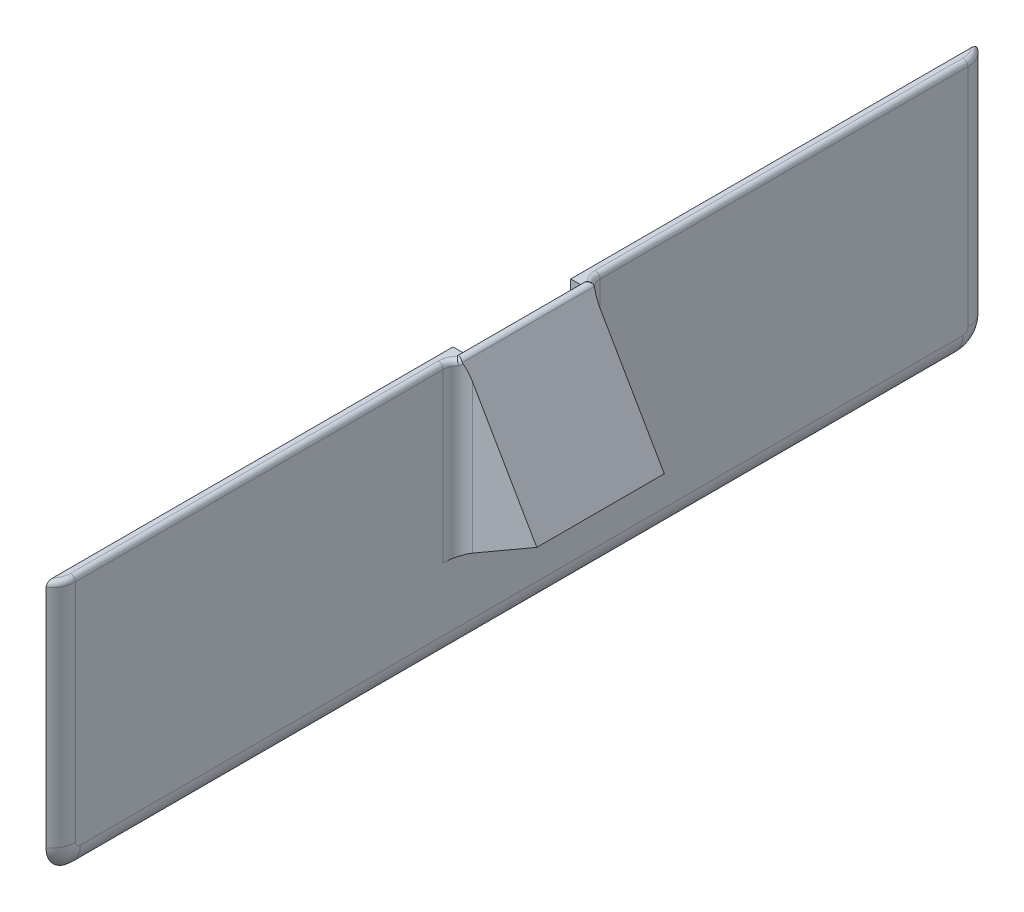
ISO-10303-21;
HEADER;
FILE_DESCRIPTION(('STEP AP214'),'2;1');
FILE_NAME('part.step','',(''),(''),'','','');
FILE_SCHEMA(('AUTOMOTIVE_DESIGN { 1 0 10303 214 1 1 1 1 }'));
ENDSEC;
DATA;
#1=APPLICATION_CONTEXT('core data for automotive mechanical design processes');
#2=APPLICATION_PROTOCOL_DEFINITION('international standard','automotive_design',2000,#1);
#3=PRODUCT_CONTEXT('',#1,'mechanical');
#4=PRODUCT('Part','Part','',(#3));
#5=PRODUCT_RELATED_PRODUCT_CATEGORY('part','',(#4));
#6=PRODUCT_DEFINITION_FORMATION('','',#4);
#7=PRODUCT_DEFINITION_CONTEXT('part definition',#1,'design');
#8=PRODUCT_DEFINITION('design','',#6,#7);
#9=PRODUCT_DEFINITION_SHAPE('','',#8);
#10=(LENGTH_UNIT() NAMED_UNIT(*) SI_UNIT(.MILLI.,.METRE.));
#11=(NAMED_UNIT(*) PLANE_ANGLE_UNIT() SI_UNIT($,.RADIAN.));
#12=(NAMED_UNIT(*) SI_UNIT($,.STERADIAN.) SOLID_ANGLE_UNIT());
#13=UNCERTAINTY_MEASURE_WITH_UNIT(LENGTH_MEASURE(1.E-05),#10,'distance_accuracy_value','');
#14=(GEOMETRIC_REPRESENTATION_CONTEXT(3) GLOBAL_UNCERTAINTY_ASSIGNED_CONTEXT((#13)) GLOBAL_UNIT_ASSIGNED_CONTEXT((#10,
#11,#12)) REPRESENTATION_CONTEXT('',''));
#15=CARTESIAN_POINT('',(0.,0.,0.));
#16=DIRECTION('',(0.,0.,1.));
#17=DIRECTION('',(1.,0.,0.));
#18=AXIS2_PLACEMENT_3D('',#15,#16,#17);
#19=CARTESIAN_POINT('',(0.,0.,0.));
#20=DIRECTION('',(1.,0.,0.));
#21=DIRECTION('',(0.,0.,-1.));
#22=AXIS2_PLACEMENT_3D('',#19,#20,#21);
#23=PLANE('',#22);
#24=DIRECTION('',(0.,1.,0.));
#25=VECTOR('',#24,1.);
#26=CARTESIAN_POINT('',(0.,26.,16.));
#27=LINE('',#26,#25);
#28=CARTESIAN_POINT('',(0.,-9.15470053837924,16.));
#29=VERTEX_POINT('',#28);
#30=CARTESIAN_POINT('',(0.,25.,16.));
#31=VERTEX_POINT('',#30);
#32=EDGE_CURVE('E475',#29,#31,#27,.T.);
#33=ORIENTED_EDGE('',*,*,#32,.T.);
#34=DIRECTION('',(0.,0.,1.));
#35=VECTOR('',#34,1.);
#36=CARTESIAN_POINT('',(0.,25.,0.));
#37=LINE('',#36,#35);
#38=CARTESIAN_POINT('',(0.,25.,91.));
#39=VERTEX_POINT('',#38);
#40=EDGE_CURVE('E627',#31,#39,#37,.T.);
#41=ORIENTED_EDGE('',*,*,#40,.T.);
#42=DIRECTION('',(0.,-1.,0.));
#43=VECTOR('',#42,1.);
#44=CARTESIAN_POINT('',(0.,-21.,91.));
#45=LINE('',#44,#43);
#46=CARTESIAN_POINT('',(0.,-21.,91.));
#47=VERTEX_POINT('',#46);
#48=EDGE_CURVE('E459',#39,#47,#45,.T.);
#49=ORIENTED_EDGE('',*,*,#48,.T.);
#50=CARTESIAN_POINT('',(0.,-21.,90.));
#51=DIRECTION('',(1.,0.,0.));
#52=DIRECTION('',(0.,0.,-1.));
#53=AXIS2_PLACEMENT_3D('',#50,#51,#52);
#54=CIRCLE('',#53,1.);
#55=CARTESIAN_POINT('',(0.,-22.,90.));
#56=VERTEX_POINT('',#55);
#57=EDGE_CURVE('E462',#47,#56,#54,.T.);
#58=ORIENTED_EDGE('',*,*,#57,.T.);
#59=DIRECTION('',(0.,0.,-1.));
#60=VECTOR('',#59,1.);
#61=CARTESIAN_POINT('',(0.,-22.,-90.));
#62=LINE('',#61,#60);
#63=CARTESIAN_POINT('',(0.,-22.,-90.));
#64=VERTEX_POINT('',#63);
#65=EDGE_CURVE('E465',#56,#64,#62,.T.);
#66=ORIENTED_EDGE('',*,*,#65,.T.);
#67=CARTESIAN_POINT('',(0.,-21.,-90.));
#68=DIRECTION('',(1.,0.,0.));
#69=DIRECTION('',(0.,0.,-1.));
#70=AXIS2_PLACEMENT_3D('',#67,#68,#69);
#71=CIRCLE('',#70,1.);
#72=CARTESIAN_POINT('',(0.,-21.,-91.));
#73=VERTEX_POINT('',#72);
#74=EDGE_CURVE('E468',#64,#73,#71,.T.);
#75=ORIENTED_EDGE('',*,*,#74,.T.);
#76=DIRECTION('',(0.,1.,0.));
#77=VECTOR('',#76,1.);
#78=CARTESIAN_POINT('',(0.,26.,-91.));
#79=LINE('',#78,#77);
#80=CARTESIAN_POINT('',(0.,25.,-91.));
#81=VERTEX_POINT('',#80);
#82=EDGE_CURVE('E471',#73,#81,#79,.T.);
#83=ORIENTED_EDGE('',*,*,#82,.T.);
#84=DIRECTION('',(0.,0.,1.));
#85=VECTOR('',#84,1.);
#86=CARTESIAN_POINT('',(0.,25.,0.));
#87=LINE('',#86,#85);
#88=CARTESIAN_POINT('',(0.,25.,-16.));
#89=VERTEX_POINT('',#88);
#90=EDGE_CURVE('E601',#81,#89,#87,.T.);
#91=ORIENTED_EDGE('',*,*,#90,.T.);
#92=DIRECTION('',(0.,-1.,0.));
#93=VECTOR('',#92,1.);
#94=CARTESIAN_POINT('',(0.,-9.15470053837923,-16.));
#95=LINE('',#94,#93);
#96=CARTESIAN_POINT('',(0.,-9.15470053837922,-16.));
#97=VERTEX_POINT('',#96);
#98=EDGE_CURVE('E495',#89,#97,#95,.T.);
#99=ORIENTED_EDGE('',*,*,#98,.T.);
#100=DIRECTION('',(0.,0.,1.));
#101=VECTOR('',#100,1.);
#102=CARTESIAN_POINT('',(0.,-9.15470053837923,13.));
#103=LINE('',#102,#101);
#104=EDGE_CURVE('E312',#97,#29,#103,.T.);
#105=ORIENTED_EDGE('',*,*,#104,.T.);
#106=EDGE_LOOP('',(#33,#41,#49,#58,#66,#75,#83,#91,#99,#105));
#107=FACE_BOUND('',#106,.T.);
#108=ADVANCED_FACE('F49',(#107),#23,.T.);
#109=CARTESIAN_POINT('',(-2.,0.,0.));
#110=DIRECTION('',(1.,0.,0.));
#111=DIRECTION('',(0.,0.,-1.));
#112=AXIS2_PLACEMENT_3D('',#109,#110,#111);
#113=PLANE('',#112);
#114=DIRECTION('',(0.,-1.,0.));
#115=VECTOR('',#114,1.);
#116=CARTESIAN_POINT('',(-2.,26.,95.));
#117=LINE('',#116,#115);
#118=CARTESIAN_POINT('',(-2.,25.,95.));
#119=VERTEX_POINT('',#118);
#120=CARTESIAN_POINT('',(-2.,-21.,95.));
#121=VERTEX_POINT('',#120);
#122=EDGE_CURVE('E442',#119,#121,#117,.T.);
#123=ORIENTED_EDGE('',*,*,#122,.F.);
#124=CARTESIAN_POINT('',(-2.,25.,95.));
#125=CARTESIAN_POINT('',(-2.,25.0238931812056,95.0000020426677));
#126=CARTESIAN_POINT('',(-2.,25.0477734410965,94.9989287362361));
#127=CARTESIAN_POINT('',(-2.,25.095334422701,94.9946621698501));
#128=CARTESIAN_POINT('',(-2.,25.1190152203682,94.99146975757));
#129=CARTESIAN_POINT('',(-2.,25.1892407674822,94.978810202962));
#130=CARTESIAN_POINT('',(-2.,25.2352633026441,94.9662598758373));
#131=CARTESIAN_POINT('',(-2.,25.3244380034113,94.933621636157));
#132=CARTESIAN_POINT('',(-2.,25.3675934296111,94.9135424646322));
#133=CARTESIAN_POINT('',(-2.,25.450211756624,94.8667976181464));
#134=CARTESIAN_POINT('',(-2.,25.4896704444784,94.8401245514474));
#135=CARTESIAN_POINT('',(-2.,25.566379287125,94.7795947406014));
#136=CARTESIAN_POINT('',(-2.,25.6033709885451,94.7454125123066));
#137=CARTESIAN_POINT('',(-2.,25.6721206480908,94.6722031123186));
#138=CARTESIAN_POINT('',(-2.,25.7038791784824,94.6331764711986));
#139=CARTESIAN_POINT('',(-2.,25.7759805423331,94.531941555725));
#140=CARTESIAN_POINT('',(-2.,25.813236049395,94.4675269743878));
#141=CARTESIAN_POINT('',(-2.,25.8769365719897,94.3333166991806));
#142=CARTESIAN_POINT('',(-2.,25.9033274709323,94.2634960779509));
#143=CARTESIAN_POINT('',(-2.,25.9513837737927,94.1033137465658));
#144=CARTESIAN_POINT('',(-2.,25.9702706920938,94.0121390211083));
#145=CARTESIAN_POINT('',(-2.,25.9944963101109,93.8290719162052));
#146=CARTESIAN_POINT('',(-2.,25.9999959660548,93.7372015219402));
#147=CARTESIAN_POINT('',(-2.,26.,93.6457513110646));
#148=B_SPLINE_CURVE_WITH_KNOTS('',3,(#124,#125,#126,#127,#128,#129,#130,#131,#132,#133,#134,
#135,#136,#137,#138,#139,#140,#141,#142,#143,#144,#145,#146,#147),.UNSPECIFIED.,.F.,.F.,(4,2,2,
2,2,2,2,2,2,2,2,4),(0.,0.0716304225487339,0.143232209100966,0.285564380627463,0.427731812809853,
0.570059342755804,0.72059183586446,0.871107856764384,1.09311446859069,1.31621389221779,
1.59443401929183,1.86929218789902),.UNSPECIFIED.);
#149=CARTESIAN_POINT('',(-2.,26.,93.6457513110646));
#150=VERTEX_POINT('',#149);
#151=EDGE_CURVE('E720',#119,#150,#148,.T.);
#152=ORIENTED_EDGE('',*,*,#151,.T.);
#153=DIRECTION('',(0.,0.,1.));
#154=VECTOR('',#153,1.);
#155=CARTESIAN_POINT('',(-2.,26.,95.));
#156=LINE('',#155,#154);
#157=CARTESIAN_POINT('',(-2.,26.,12.));
#158=VERTEX_POINT('',#157);
#159=EDGE_CURVE('E438',#158,#150,#156,.T.);
#160=ORIENTED_EDGE('',*,*,#159,.F.);
#161=DIRECTION('',(0.,-1.,0.));
#162=VECTOR('',#161,1.);
#163=CARTESIAN_POINT('',(-2.,-7.99999999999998,12.));
#164=LINE('',#163,#162);
#165=CARTESIAN_POINT('',(-2.,-7.99999999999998,12.));
#166=VERTEX_POINT('',#165);
#167=EDGE_CURVE('E413',#158,#166,#164,.T.);
#168=ORIENTED_EDGE('',*,*,#167,.T.);
#169=DIRECTION('',(0.,0.,-1.));
#170=VECTOR('',#169,1.);
#171=CARTESIAN_POINT('',(-2.,-7.99999999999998,12.));
#172=LINE('',#171,#170);
#173=CARTESIAN_POINT('',(-2.,-7.99999999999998,-12.));
#174=VERTEX_POINT('',#173);
#175=EDGE_CURVE('E405',#166,#174,#172,.T.);
#176=ORIENTED_EDGE('',*,*,#175,.T.);
#177=DIRECTION('',(0.,1.,0.));
#178=VECTOR('',#177,1.);
#179=CARTESIAN_POINT('',(-2.,-7.99999999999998,-12.));
#180=LINE('',#179,#178);
#181=CARTESIAN_POINT('',(-2.,26.,-12.));
#182=VERTEX_POINT('',#181);
#183=EDGE_CURVE('E409',#174,#182,#180,.T.);
#184=ORIENTED_EDGE('',*,*,#183,.T.);
#185=CARTESIAN_POINT('',(-2.,26.,-93.6457513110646));
#186=VERTEX_POINT('',#185);
#187=EDGE_CURVE('E439',#186,#182,#156,.T.);
#188=ORIENTED_EDGE('',*,*,#187,.F.);
#189=CARTESIAN_POINT('',(-2.,26.,-93.6457513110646));
#190=CARTESIAN_POINT('',(-2.,26.0000289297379,-93.7532600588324));
#191=CARTESIAN_POINT('',(-2.,25.9923825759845,-93.8616846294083));
#192=CARTESIAN_POINT('',(-2.,25.958198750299,-94.0767387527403));
#193=CARTESIAN_POINT('',(-2.,25.9314343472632,-94.1833308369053));
#194=CARTESIAN_POINT('',(-2.,25.869998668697,-94.348711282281));
#195=CARTESIAN_POINT('',(-2.,25.84236598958,-94.4100715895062));
#196=CARTESIAN_POINT('',(-2.,25.7780301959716,-94.5276019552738));
#197=CARTESIAN_POINT('',(-2.,25.7413667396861,-94.5837932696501));
#198=CARTESIAN_POINT('',(-2.,25.6654976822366,-94.6802110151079));
#199=CARTESIAN_POINT('',(-2.,25.6277040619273,-94.7215428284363));
#200=CARTESIAN_POINT('',(-2.,25.5457631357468,-94.7974953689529));
#201=CARTESIAN_POINT('',(-2.,25.5016118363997,-94.832111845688));
#202=CARTESIAN_POINT('',(-2.,25.4073338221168,-94.8930521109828));
#203=CARTESIAN_POINT('',(-2.,25.3571598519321,-94.919303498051));
#204=CARTESIAN_POINT('',(-2.,25.2526395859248,-94.9613340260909));
#205=CARTESIAN_POINT('',(-2.,25.1983036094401,-94.9771381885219));
#206=CARTESIAN_POINT('',(-2.,25.1194042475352,-94.9914157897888));
#207=CARTESIAN_POINT('',(-2.,25.0956287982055,-94.9946305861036));
#208=CARTESIAN_POINT('',(-2.,25.0479076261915,-94.9989218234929));
#209=CARTESIAN_POINT('',(-2.,25.0239620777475,-95.0000002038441));
#210=CARTESIAN_POINT('',(-2.,25.,-95.));
#211=B_SPLINE_CURVE_WITH_KNOTS('',3,(#189,#190,#191,#192,#193,#194,#195,#196,#197,#198,#199,
#200,#201,#202,#203,#204,#205,#206,#207,#208,#209,#210),.UNSPECIFIED.,.F.,.F.,(4,2,2,2,2,2,2,2,
2,2,4),(0.,0.323751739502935,0.65141166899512,0.852609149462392,1.0529383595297,
1.22029043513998,1.38774809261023,1.55661806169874,1.72508210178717,1.79697710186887,
1.86880681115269),.UNSPECIFIED.);
#212=CARTESIAN_POINT('',(-2.,25.,-95.));
#213=VERTEX_POINT('',#212);
#214=EDGE_CURVE('E608',#186,#213,#211,.T.);
#215=ORIENTED_EDGE('',*,*,#214,.T.);
#216=DIRECTION('',(0.,1.,0.));
#217=VECTOR('',#216,1.);
#218=CARTESIAN_POINT('',(-2.,26.,-95.));
#219=LINE('',#218,#217);
#220=CARTESIAN_POINT('',(-2.,-21.,-95.));
#221=VERTEX_POINT('',#220);
#222=EDGE_CURVE('E434',#221,#213,#219,.T.);
#223=ORIENTED_EDGE('',*,*,#222,.F.);
#224=CARTESIAN_POINT('',(-2.,-21.,-90.));
#225=DIRECTION('',(1.,0.,0.));
#226=DIRECTION('',(0.,0.,-1.));
#227=AXIS2_PLACEMENT_3D('',#224,#225,#226);
#228=CIRCLE('',#227,5.);
#229=CARTESIAN_POINT('',(-2.,-26.,-90.));
#230=VERTEX_POINT('',#229);
#231=EDGE_CURVE('E456',#221,#230,#228,.F.);
#232=ORIENTED_EDGE('',*,*,#231,.T.);
#233=DIRECTION('',(0.,0.,-1.));
#234=VECTOR('',#233,1.);
#235=CARTESIAN_POINT('',(-2.,-26.,95.));
#236=LINE('',#235,#234);
#237=CARTESIAN_POINT('',(-2.,-26.,90.));
#238=VERTEX_POINT('',#237);
#239=EDGE_CURVE('E445',#238,#230,#236,.T.);
#240=ORIENTED_EDGE('',*,*,#239,.F.);
#241=CARTESIAN_POINT('',(-2.,-21.,90.));
#242=DIRECTION('',(1.,0.,0.));
#243=DIRECTION('',(0.,0.,-1.));
#244=AXIS2_PLACEMENT_3D('',#241,#242,#243);
#245=CIRCLE('',#244,5.);
#246=EDGE_CURVE('E449',#238,#121,#245,.F.);
#247=ORIENTED_EDGE('',*,*,#246,.T.);
#248=EDGE_LOOP('',(#123,#152,#160,#168,#176,#184,#188,#215,#223,#232,#240,#247));
#249=FACE_BOUND('',#248,.T.);
#250=DIRECTION('',(0.,1.,0.));
#251=VECTOR('',#250,1.);
#252=CARTESIAN_POINT('',(-2.,-22.5,91.5));
#253=LINE('',#252,#251);
#254=CARTESIAN_POINT('',(-2.,-22.5,91.5));
#255=VERTEX_POINT('',#254);
#256=CARTESIAN_POINT('',(-2.,22.5,91.5));
#257=VERTEX_POINT('',#256);
#258=EDGE_CURVE('E315',#255,#257,#253,.T.);
#259=ORIENTED_EDGE('',*,*,#258,.F.);
#260=DIRECTION('',(0.,0.,1.));
#261=VECTOR('',#260,1.);
#262=CARTESIAN_POINT('',(-2.,-22.5,-91.5));
#263=LINE('',#262,#261);
#264=CARTESIAN_POINT('',(-2.,-22.5,-91.5));
#265=VERTEX_POINT('',#264);
#266=EDGE_CURVE('E322',#265,#255,#263,.T.);
#267=ORIENTED_EDGE('',*,*,#266,.F.);
#268=DIRECTION('',(0.,-1.,0.));
#269=VECTOR('',#268,1.);
#270=CARTESIAN_POINT('',(-2.,22.5,-91.5));
#271=LINE('',#270,#269);
#272=CARTESIAN_POINT('',(-2.,22.5,-91.5));
#273=VERTEX_POINT('',#272);
#274=EDGE_CURVE('E367',#273,#265,#271,.T.);
#275=ORIENTED_EDGE('',*,*,#274,.F.);
#276=DIRECTION('',(0.,0.,-1.));
#277=VECTOR('',#276,1.);
#278=CARTESIAN_POINT('',(-2.,22.5,-15.5));
#279=LINE('',#278,#277);
#280=CARTESIAN_POINT('',(-2.,22.5,-15.5));
#281=VERTEX_POINT('',#280);
#282=EDGE_CURVE('E363',#281,#273,#279,.T.);
#283=ORIENTED_EDGE('',*,*,#282,.F.);
#284=DIRECTION('',(0.,1.,0.));
#285=VECTOR('',#284,1.);
#286=CARTESIAN_POINT('',(-2.,-11.5,-15.5));
#287=LINE('',#286,#285);
#288=CARTESIAN_POINT('',(-2.,-11.5,-15.5));
#289=VERTEX_POINT('',#288);
#290=EDGE_CURVE('E359',#289,#281,#287,.T.);
#291=ORIENTED_EDGE('',*,*,#290,.F.);
#292=DIRECTION('',(0.,0.,-1.));
#293=VECTOR('',#292,1.);
#294=CARTESIAN_POINT('',(-2.,-11.5,15.5));
#295=LINE('',#294,#293);
#296=CARTESIAN_POINT('',(-2.,-11.5,15.5));
#297=VERTEX_POINT('',#296);
#298=EDGE_CURVE('E355',#297,#289,#295,.T.);
#299=ORIENTED_EDGE('',*,*,#298,.F.);
#300=DIRECTION('',(0.,-1.,0.));
#301=VECTOR('',#300,1.);
#302=CARTESIAN_POINT('',(-2.,22.5,15.5));
#303=LINE('',#302,#301);
#304=CARTESIAN_POINT('',(-2.,22.5,15.5));
#305=VERTEX_POINT('',#304);
#306=EDGE_CURVE('E351',#305,#297,#303,.T.);
#307=ORIENTED_EDGE('',*,*,#306,.F.);
#308=DIRECTION('',(0.,0.,-1.));
#309=VECTOR('',#308,1.);
#310=CARTESIAN_POINT('',(-2.,22.5,91.5));
#311=LINE('',#310,#309);
#312=EDGE_CURVE('E347',#257,#305,#311,.T.);
#313=ORIENTED_EDGE('',*,*,#312,.F.);
#314=EDGE_LOOP('',(#259,#267,#275,#283,#291,#299,#307,#313));
#315=FACE_BOUND('',#314,.T.);
#316=ADVANCED_FACE('F677',(#249,#315),#113,.F.);
#317=CARTESIAN_POINT('',(-2.,26.,95.));
#318=DIRECTION('',(0.,1.,0.));
#319=DIRECTION('',(0.,0.,1.));
#320=AXIS2_PLACEMENT_3D('',#317,#318,#319);
#321=PLANE('',#320);
#322=ORIENTED_EDGE('',*,*,#159,.T.);
#323=CARTESIAN_POINT('',(-5.,26.,91.));
#324=DIRECTION('',(0.,1.,0.));
#325=DIRECTION('',(0.,0.,1.));
#326=AXIS2_PLACEMENT_3D('',#323,#324,#325);
#327=CIRCLE('',#326,4.);
#328=CARTESIAN_POINT('',(-1.,26.,91.));
#329=VERTEX_POINT('',#328);
#330=EDGE_CURVE('E705',#150,#329,#327,.T.);
#331=ORIENTED_EDGE('',*,*,#330,.T.);
#332=DIRECTION('',(0.,0.,1.));
#333=VECTOR('',#332,1.);
#334=CARTESIAN_POINT('',(-1.,26.,95.));
#335=LINE('',#334,#333);
#336=CARTESIAN_POINT('',(-1.,26.,16.));
#337=VERTEX_POINT('',#336);
#338=EDGE_CURVE('E700',#329,#337,#335,.F.);
#339=ORIENTED_EDGE('',*,*,#338,.T.);
#340=CARTESIAN_POINT('',(3.,26.,16.));
#341=DIRECTION('',(0.,1.,0.));
#342=DIRECTION('',(0.,0.,1.));
#343=AXIS2_PLACEMENT_3D('',#340,#341,#342);
#344=CIRCLE('',#343,4.);
#345=CARTESIAN_POINT('',(0.12081271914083,26.,13.2232607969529));
#346=VERTEX_POINT('',#345);
#347=EDGE_CURVE('E75',#337,#346,#344,.F.);
#348=ORIENTED_EDGE('',*,*,#347,.T.);
#349=CARTESIAN_POINT('',(0.,24.2679491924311,16.));
#350=CARTESIAN_POINT('',(0.,24.8452994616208,16.));
#351=CARTESIAN_POINT('',(-0.500000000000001,25.1339745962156,16.));
#352=CARTESIAN_POINT('',(-1.,25.4226497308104,16.));
#353=CARTESIAN_POINT('',(-1.5,25.1339745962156,16.));
#354=CARTESIAN_POINT('',(0.,24.2679491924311,15.8689773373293));
#355=CARTESIAN_POINT('',(0.,24.8452994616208,15.8835330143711));
#356=CARTESIAN_POINT('',(-0.500000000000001,25.1339745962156,15.8689755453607));
#357=CARTESIAN_POINT('',(-1.,25.4226497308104,15.8544170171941));
#358=CARTESIAN_POINT('',(-1.5,25.1339745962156,15.8253031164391));
#359=CARTESIAN_POINT('',(0.0086125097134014,24.2745791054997,15.7379546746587));
#360=CARTESIAN_POINT('',(0.00667292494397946,24.8508115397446,15.7671218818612));
#361=CARTESIAN_POINT('',(-0.492122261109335,25.1393533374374,15.7379510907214));
#362=CARTESIAN_POINT('',(-0.990932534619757,25.4278848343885,15.7089038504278));
#363=CARTESIAN_POINT('',(-1.48851665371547,25.1406045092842,15.6506062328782));
#364=CARTESIAN_POINT('',(0.0428139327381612,24.3009073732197,15.4781619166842));
#365=CARTESIAN_POINT('',(0.0334263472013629,24.8728115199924,15.5349658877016));
#366=CARTESIAN_POINT('',(-0.460636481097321,25.160808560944,15.4770528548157));
#367=CARTESIAN_POINT('',(-0.954713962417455,25.4487956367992,15.4192627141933));
#368=CARTESIAN_POINT('',(-1.44291475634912,25.1669327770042,15.3042158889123));
#369=CARTESIAN_POINT('',(0.0684977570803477,24.3206787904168,15.3494085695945));
#370=CARTESIAN_POINT('',(0.0535566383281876,24.8893401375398,15.419335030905));
#371=CARTESIAN_POINT('',(-0.436940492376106,25.1769448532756,15.34718964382));
#372=CARTESIAN_POINT('',(-0.927495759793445,25.464510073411,15.2752795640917));
#373=CARTESIAN_POINT('',(-1.4086696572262,25.1867041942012,15.1325447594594));
#374=CARTESIAN_POINT('',(0.136307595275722,24.3728788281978,15.0963324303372));
#375=CARTESIAN_POINT('',(0.107454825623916,24.9332910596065,15.1897219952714));
#376=CARTESIAN_POINT('',(-0.37376025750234,25.2198383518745,15.0899292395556));
#377=CARTESIAN_POINT('',(-0.855033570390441,25.5063461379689,14.9903750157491));
#378=CARTESIAN_POINT('',(-1.31825653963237,25.2389042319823,14.7951099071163));
#379=CARTESIAN_POINT('',(0.178606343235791,24.4054404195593,14.9720716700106));
#380=CARTESIAN_POINT('',(0.141318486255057,24.9607894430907,15.0758612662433));
#381=CARTESIAN_POINT('',(-0.334110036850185,25.2467071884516,14.9625732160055));
#382=CARTESIAN_POINT('',(-0.809663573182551,25.53254051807,14.849613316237));
#383=CARTESIAN_POINT('',(-1.26185820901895,25.2714658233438,14.6294288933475));
#384=CARTESIAN_POINT('',(0.27885092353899,24.4826087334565,14.7300545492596));
#385=CARTESIAN_POINT('',(0.222937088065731,25.0265085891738,14.8511074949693));
#386=CARTESIAN_POINT('',(-0.239003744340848,25.310915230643,14.7119238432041));
#387=CARTESIAN_POINT('',(-0.701071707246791,25.5952360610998,14.5730765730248));
#388=CARTESIAN_POINT('',(-1.12819876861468,25.3486341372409,14.3067393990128));
#389=CARTESIAN_POINT('',(0.337018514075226,24.5273861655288,14.6124212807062));
#390=CARTESIAN_POINT('',(0.270825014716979,25.064830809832,14.7403488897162));
#391=CARTESIAN_POINT('',(-0.183322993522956,25.348403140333,14.5887182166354));
#392=CARTESIAN_POINT('',(-0.637680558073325,25.6318349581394,14.4374831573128));
#393=CARTESIAN_POINT('',(-1.05064198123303,25.3934115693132,14.1498950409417));
#394=CARTESIAN_POINT('',(0.46796703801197,24.6281903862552,14.3856076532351));
#395=CARTESIAN_POINT('',(0.380594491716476,25.1518709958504,14.5234765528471));
#396=CARTESIAN_POINT('',(-0.0563290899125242,25.4335557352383,14.3482629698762));
#397=CARTESIAN_POINT('',(-0.493467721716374,25.7150962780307,14.1734577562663));
#398=CARTESIAN_POINT('',(-0.876043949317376,25.4942157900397,13.8474768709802));
#399=CARTESIAN_POINT('',(0.540986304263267,24.6844006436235,14.2766116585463));
#400=CARTESIAN_POINT('',(0.442632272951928,25.2007028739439,14.4175138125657));
#401=CARTESIAN_POINT('',(0.0152410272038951,25.4813873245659,14.2311556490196));
#402=CARTESIAN_POINT('',(-0.412454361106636,25.7618693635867,14.0452310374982));
#403=CARTESIAN_POINT('',(-0.77868492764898,25.550426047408,13.7021488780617));
#404=CARTESIAN_POINT('',(0.700383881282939,24.8071049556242,14.0688776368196));
#405=CARTESIAN_POINT('',(0.580503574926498,25.3082279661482,14.2121943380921));
#406=CARTESIAN_POINT('',(0.173522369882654,25.5867340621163,14.0050145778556));
#407=CARTESIAN_POINT('',(-0.233772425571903,25.865031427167,13.798283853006));
#408=CARTESIAN_POINT('',(-0.566154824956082,25.6731303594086,13.4251701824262));
#409=CARTESIAN_POINT('',(0.786988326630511,24.8737730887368,13.9703720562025));
#410=CARTESIAN_POINT('',(0.656499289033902,25.3670341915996,14.113003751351));
#411=CARTESIAN_POINT('',(0.260493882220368,25.6444149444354,13.896174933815));
#412=CARTESIAN_POINT('',(-0.135912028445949,25.9215311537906,13.6797866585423));
#413=CARTESIAN_POINT('',(-0.45068223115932,25.7397984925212,13.29382940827));
#414=CARTESIAN_POINT('',(0.972096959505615,25.0162697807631,13.7852612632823));
#415=CARTESIAN_POINT('',(0.821695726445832,25.493739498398,13.923344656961));
#416=CARTESIAN_POINT('',(0.448693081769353,25.7687369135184,13.6887887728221));
#417=CARTESIAN_POINT('',(0.0752770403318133,26.0434612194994,13.4546892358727));
#418=CARTESIAN_POINT('',(-0.20387072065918,25.8822951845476,13.0470150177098));
#419=CARTESIAN_POINT('',(1.07079445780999,25.0922471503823,13.6989149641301));
#420=CARTESIAN_POINT('',(0.9110475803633,25.5617394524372,13.8330496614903));
#421=CARTESIAN_POINT('',(0.550158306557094,25.8355262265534,13.5904745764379));
#422=CARTESIAN_POINT('',(0.188778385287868,26.1089912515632,13.3483173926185));
#423=CARTESIAN_POINT('',(-0.0722740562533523,25.9582725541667,12.9318866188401));
#424=CARTESIAN_POINT('',(1.27844096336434,25.2520935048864,13.5395807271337));
#425=CARTESIAN_POINT('',(1.10193958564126,25.7058297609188,13.6633099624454));
#426=CARTESIAN_POINT('',(0.766044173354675,25.977107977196,13.4063266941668));
#427=CARTESIAN_POINT('',(0.429643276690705,26.2480546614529,13.1497752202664));
#428=CARTESIAN_POINT('',(0.204587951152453,26.1181189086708,12.7194409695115));
#429=CARTESIAN_POINT('',(1.38753933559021,25.3360774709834,13.466853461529));
#430=CARTESIAN_POINT('',(1.20360655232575,25.7820014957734,13.5840328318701));
#431=CARTESIAN_POINT('',(0.880660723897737,26.0520201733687,13.320741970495));
#432=CARTESIAN_POINT('',(0.557147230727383,26.3216691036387,13.0578204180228));
#433=CARTESIAN_POINT('',(0.350052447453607,26.2021028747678,12.6224712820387));
#434=CARTESIAN_POINT('',(1.61416960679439,25.5105375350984,13.3360074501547));
#435=CARTESIAN_POINT('',(1.41770010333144,25.9412189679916,13.4383397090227));
#436=CARTESIAN_POINT('',(1.12115274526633,26.2086741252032,13.164087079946));
#437=CARTESIAN_POINT('',(0.824023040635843,26.4757499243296,12.8902142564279));
#438=CARTESIAN_POINT('',(0.652226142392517,26.3765629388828,12.4480099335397));
#439=CARTESIAN_POINT('',(1.73180446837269,25.6010928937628,13.2781274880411));
#440=CARTESIAN_POINT('',(1.53022189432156,26.0243237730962,13.3720689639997));
#441=CARTESIAN_POINT('',(1.24717283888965,26.2905023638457,13.0932572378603));
#442=CARTESIAN_POINT('',(0.963497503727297,26.5562755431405,12.8147456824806));
#443=CARTESIAN_POINT('',(0.809072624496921,26.4671182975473,12.3708366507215));
#444=CARTESIAN_POINT('',(1.97354359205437,25.7871837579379,13.1779952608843));
#445=CARTESIAN_POINT('',(1.76422924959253,26.1960092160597,13.254177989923));
#446=CARTESIAN_POINT('',(1.50842723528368,26.459628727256,12.967895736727));
#447=CARTESIAN_POINT('',(1.25198660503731,26.7228348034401,12.6819202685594));
#448=CARTESIAN_POINT('',(1.13139145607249,26.6532091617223,12.2373270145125));
#449=CARTESIAN_POINT('',(2.09770875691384,25.882766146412,13.135939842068));
#450=CARTESIAN_POINT('',(1.88577766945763,26.2846280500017,13.2026640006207));
#451=CARTESIAN_POINT('',(1.64375431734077,26.5469809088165,12.9135708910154));
#452=CARTESIAN_POINT('',(1.40106786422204,26.8089069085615,12.6246946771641));
#453=CARTESIAN_POINT('',(1.29694500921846,26.7487915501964,12.1812531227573));
#454=CARTESIAN_POINT('',(2.35042635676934,26.077308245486,13.0682240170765));
#455=CARTESIAN_POINT('',(2.135736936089,26.4657996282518,13.1157776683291));
#456=CARTESIAN_POINT('',(1.92129218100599,26.7256465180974,12.8226813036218));
#457=CARTESIAN_POINT('',(1.706176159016,26.9850612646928,12.5298050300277));
#458=CARTESIAN_POINT('',(1.63390180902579,26.9433336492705,12.0909653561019));
#459=CARTESIAN_POINT('',(2.47900674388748,26.1762894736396,13.0427032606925));
#460=CARTESIAN_POINT('',(2.26418350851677,26.5583746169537,13.0804579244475));
#461=CARTESIAN_POINT('',(2.06355095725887,26.8169869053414,12.7862684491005));
#462=CARTESIAN_POINT('',(1.86224178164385,27.0751657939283,12.4922052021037));
#463=CARTESIAN_POINT('',(1.8053423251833,27.042314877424,12.0569376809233));
#464=CARTESIAN_POINT('',(2.73838667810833,26.3759602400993,13.0085550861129));
#465=CARTESIAN_POINT('',(2.52560115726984,26.7458126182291,13.0271004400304));
#466=CARTESIAN_POINT('',(2.35240458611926,27.0020109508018,12.7322947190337));
#467=CARTESIAN_POINT('',(2.17852853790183,27.2577740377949,12.4376161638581));
#468=CARTESIAN_POINT('',(2.15118223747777,27.2419856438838,12.0114067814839));
#469=CARTESIAN_POINT('',(2.86919333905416,26.4766552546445,13.));
#470=CARTESIAN_POINT('',(2.65859081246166,26.8406893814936,13.0090507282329));
#471=CARTESIAN_POINT('',(2.49901531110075,27.0957029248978,12.7148147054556));
#472=CARTESIAN_POINT('',(2.33877274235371,27.3502910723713,12.4206133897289));
#473=CARTESIAN_POINT('',(2.32559111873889,27.3426806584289,12.));
#474=CARTESIAN_POINT('',(3.13080666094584,26.6780452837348,13.));
#475=CARTESIAN_POINT('',(2.9265905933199,27.0310204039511,12.9909900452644));
#476=CARTESIAN_POINT('',(2.79387790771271,27.283742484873,12.6993988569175));
#477=CARTESIAN_POINT('',(2.66050092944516,27.5360409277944,12.4078425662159));
#478=CARTESIAN_POINT('',(2.67440888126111,27.5440706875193,12.));
#479=CARTESIAN_POINT('',(3.26161332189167,26.77874029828,13.0085550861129));
#480=CARTESIAN_POINT('',(3.06161548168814,27.1264890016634,12.990896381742));
#481=CARTESIAN_POINT('',(2.94212977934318,27.3780900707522,12.7014630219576));
#482=CARTESIAN_POINT('',(2.82200796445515,27.6292870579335,12.4119779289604));
#483=CARTESIAN_POINT('',(2.84881776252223,27.6447657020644,12.0114067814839));
#484=CARTESIAN_POINT('',(3.52099325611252,26.9784110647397,13.0427032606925));
#485=CARTESIAN_POINT('',(3.33108458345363,27.3162663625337,13.0091034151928));
#486=CARTESIAN_POINT('',(3.23750063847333,27.5657219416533,12.7254131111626));
#487=CARTESIAN_POINT('',(3.14328847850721,27.8147784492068,12.4416720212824));
#488=CARTESIAN_POINT('',(3.1946576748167,27.8444364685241,12.0569376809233));
#489=CARTESIAN_POINT('',(3.64957364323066,27.0773922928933,13.0682240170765));
#490=CARTESIAN_POINT('',(3.46555496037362,27.4105998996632,13.0272500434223));
#491=CARTESIAN_POINT('',(3.38462176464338,27.6590090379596,12.7472150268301));
#492=CARTESIAN_POINT('',(3.30310195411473,27.9070468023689,12.4670519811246));
#493=CARTESIAN_POINT('',(3.36609819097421,27.9434176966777,12.0909653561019));
#494=CARTESIAN_POINT('',(3.90229124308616,27.2719343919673,13.135939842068));
#495=CARTESIAN_POINT('',(3.73128295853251,27.5963790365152,13.0818865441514));
#496=CARTESIAN_POINT('',(3.67494336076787,27.8428064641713,12.8105000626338));
#497=CARTESIAN_POINT('',(3.61802898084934,28.0888700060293,12.5389884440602));
#498=CARTESIAN_POINT('',(3.70305499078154,28.1379597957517,12.1812531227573));
#499=CARTESIAN_POINT('',(4.02645640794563,27.3675167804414,13.1779952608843));
#500=CARTESIAN_POINT('',(3.8625937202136,27.6878695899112,13.1181563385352));
#501=CARTESIAN_POINT('',(3.81816619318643,27.9333333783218,12.8518189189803));
#502=CARTESIAN_POINT('',(3.77321635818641,28.1784674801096,12.5852913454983));
#503=CARTESIAN_POINT('',(3.86860854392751,28.2335421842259,12.2373270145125));
#504=CARTESIAN_POINT('',(4.26819553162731,27.5536076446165,13.2781274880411));
#505=CARTESIAN_POINT('',(4.11940239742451,27.8662781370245,13.208585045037));
#506=CARTESIAN_POINT('',(4.09795179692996,28.109937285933,12.9535846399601));
#507=CARTESIAN_POINT('',(4.07599301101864,28.3532756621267,12.6983995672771));
#508=CARTESIAN_POINT('',(4.19092737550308,28.4196330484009,12.3708366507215));
#509=CARTESIAN_POINT('',(4.38583039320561,27.6441630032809,13.3360074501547));
#510=CARTESIAN_POINT('',(4.24499464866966,27.953269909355,13.2624696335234));
#511=CARTESIAN_POINT('',(4.23457358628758,28.1960544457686,13.0137977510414));
#512=CARTESIAN_POINT('',(4.22370499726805,28.4385572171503,12.7648906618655));
#513=CARTESIAN_POINT('',(4.34777385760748,28.5101884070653,12.4480099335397));
#514=CARTESIAN_POINT('',(4.6124606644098,27.8186230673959,13.466853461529));
#515=CARTESIAN_POINT('',(4.48785793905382,28.1210724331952,13.3872821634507));
#516=CARTESIAN_POINT('',(4.49852498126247,28.3622391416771,13.1523989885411));
#517=CARTESIAN_POINT('',(4.50875908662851,28.6031332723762,12.9172886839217));
#518=CARTESIAN_POINT('',(4.64994755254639,28.6846484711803,12.6224712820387));
#519=CARTESIAN_POINT('',(4.72155903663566,27.9026070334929,13.5395807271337));
#520=CARTESIAN_POINT('',(4.60527532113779,28.2019921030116,13.4578997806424));
#521=CARTESIAN_POINT('',(4.62596306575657,28.4423779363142,13.2305015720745));
#522=CARTESIAN_POINT('',(4.64628386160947,28.6825332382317,13.002841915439));
#523=CARTESIAN_POINT('',(4.79541204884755,28.7686324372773,12.7194409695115));
#524=CARTESIAN_POINT('',(4.92920554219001,28.062453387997,13.6989149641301));
#525=CARTESIAN_POINT('',(4.82942906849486,28.3561495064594,13.6149590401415));
#526=CARTESIAN_POINT('',(4.86907823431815,28.595111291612,13.40354820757));
#527=CARTESIAN_POINT('',(4.90837380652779,28.8338509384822,13.1918859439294));
#528=CARTESIAN_POINT('',(5.07227405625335,28.9284787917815,12.9318866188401));
#529=CARTESIAN_POINT('',(5.02790304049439,28.1384307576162,13.7852612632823));
#530=CARTESIAN_POINT('',(4.93636874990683,28.4295337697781,13.7010785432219));
#531=CARTESIAN_POINT('',(4.984920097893,28.6678120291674,13.498178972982));
#532=CARTESIAN_POINT('',(5.03318608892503,28.9059113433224,13.2950111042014));
#533=CARTESIAN_POINT('',(5.20387072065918,29.0044561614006,13.0470150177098));
#534=CARTESIAN_POINT('',(5.21301167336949,28.2809274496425,13.9703720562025));
#535=CARTESIAN_POINT('',(5.13741010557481,28.5672573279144,13.887573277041));
#536=CARTESIAN_POINT('',(5.20259080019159,28.8043101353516,13.7025932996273));
#537=CARTESIAN_POINT('',(5.26749695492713,29.0411907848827,13.5173558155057));
#538=CARTESIAN_POINT('',(5.45068223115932,29.146952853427,13.29382940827));
#539=CARTESIAN_POINT('',(5.29961611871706,28.3475955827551,14.0688776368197));
#540=CARTESIAN_POINT('',(5.23176852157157,28.6317777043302,13.9876430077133));
#541=CARTESIAN_POINT('',(5.30463899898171,28.8682471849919,13.8120645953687));
#542=CARTESIAN_POINT('',(5.37730206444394,29.1045867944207,13.636229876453));
#543=CARTESIAN_POINT('',(5.56615482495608,29.2136209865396,13.4251701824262));
#544=CARTESIAN_POINT('',(5.45901369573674,28.4702998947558,14.2766116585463));
#545=CARTESIAN_POINT('',(5.40574487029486,28.750577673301,14.2001526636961));
#546=CARTESIAN_POINT('',(5.49273819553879,28.9860234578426,14.0441484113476));
#547=CARTESIAN_POINT('',(5.57953169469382,29.2213441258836,13.887897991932));
#548=CARTESIAN_POINT('',(5.77868492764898,29.3363252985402,13.7021488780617));
#549=CARTESIAN_POINT('',(5.53203296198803,28.526510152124,14.3856076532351));
#550=CARTESIAN_POINT('',(5.48565856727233,28.805062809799,14.3123331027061));
#551=CARTESIAN_POINT('',(5.57905052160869,29.0400278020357,14.1664799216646));
#552=CARTESIAN_POINT('',(5.67230504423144,29.2749068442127,14.0203996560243));
#553=CARTESIAN_POINT('',(5.87604394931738,29.3925355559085,13.8474768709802));
#554=CARTESIAN_POINT('',(5.66298148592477,28.6273143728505,14.6124212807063));
#555=CARTESIAN_POINT('',(5.62914592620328,28.9027915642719,14.5469016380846));
#556=CARTESIAN_POINT('',(5.73400963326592,29.1369365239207,14.4219901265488));
#557=CARTESIAN_POINT('',(5.83874027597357,29.3709982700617,14.2968596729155));
#558=CARTESIAN_POINT('',(6.05064198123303,29.493339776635,14.1498950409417));
#559=CARTESIAN_POINT('',(5.72114907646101,28.6720918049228,14.7300545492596));
#560=CARTESIAN_POINT('',(5.69302815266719,28.9462474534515,14.669101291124));
#561=CARTESIAN_POINT('',(5.80293518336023,29.1800161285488,14.554945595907));
#562=CARTESIAN_POINT('',(5.91276303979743,29.4137353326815,14.4406066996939));
#563=CARTESIAN_POINT('',(6.12819876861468,29.5381172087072,14.3067393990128));
#564=CARTESIAN_POINT('',(5.82139365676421,28.7492601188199,14.9720716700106));
#565=CARTESIAN_POINT('',(5.80319896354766,29.0211370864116,14.921319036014));
#566=CARTESIAN_POINT('',(5.92181114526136,29.2542903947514,14.8291775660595));
#567=CARTESIAN_POINT('',(6.04034595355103,29.4873953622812,14.7368581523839));
#568=CARTESIAN_POINT('',(6.26185820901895,29.6152855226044,14.6294288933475));
#569=CARTESIAN_POINT('',(5.86369240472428,28.7818217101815,15.0963324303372));
#570=CARTESIAN_POINT('',(5.84977267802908,29.0527656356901,15.0512338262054));
#571=CARTESIAN_POINT('',(5.97202299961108,29.2856488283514,14.970304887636));
#572=CARTESIAN_POINT('',(6.09423768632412,29.5185097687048,14.8892479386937));
#573=CARTESIAN_POINT('',(6.31825653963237,29.6478471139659,14.7951099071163));
#574=CARTESIAN_POINT('',(5.93150224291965,28.8340217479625,15.3494085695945));
#575=CARTESIAN_POINT('',(5.92445264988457,29.1034597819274,15.3163269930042));
#576=CARTESIAN_POINT('',(6.05255476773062,29.335932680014,15.2581834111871));
#577=CARTESIAN_POINT('',(6.18062152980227,29.5683835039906,15.1999140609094));
#578=CARTESIAN_POINT('',(6.4086696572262,29.700047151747,15.1325447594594));
#579=CARTESIAN_POINT('',(5.95718606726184,28.8537931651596,15.4781619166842));
#580=CARTESIAN_POINT('',(5.95277999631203,29.1226757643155,15.451484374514));
#581=CARTESIAN_POINT('',(6.08307934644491,29.3549860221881,15.4048593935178));
#582=CARTESIAN_POINT('',(6.21336981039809,29.5872907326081,15.358169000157));
#583=CARTESIAN_POINT('',(6.44291475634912,29.719818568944,15.3042158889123));
#584=CARTESIAN_POINT('',(5.9913874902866,28.8801214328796,15.7379546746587));
#585=CARTESIAN_POINT('',(5.99049308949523,29.1482550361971,15.7244119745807));
#586=CARTESIAN_POINT('',(6.12373287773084,29.3803601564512,15.7010371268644));
#587=CARTESIAN_POINT('',(6.25696359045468,29.6124596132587,15.6775968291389));
#588=CARTESIAN_POINT('',(6.48851665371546,29.746146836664,15.6506062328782));
#589=CARTESIAN_POINT('',(6.,28.8867513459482,15.8689773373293));
#590=CARTESIAN_POINT('',(6.,29.1547005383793,15.8622212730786));
#591=CARTESIAN_POINT('',(6.13397459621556,29.3867513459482,15.8505185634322));
#592=CARTESIAN_POINT('',(6.26794919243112,29.618802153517,15.8388162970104));
#593=CARTESIAN_POINT('',(6.5,29.7527767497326,15.8253031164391));
#594=CARTESIAN_POINT('',(6.,28.8867513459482,16.1310226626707));
#595=CARTESIAN_POINT('',(6.,29.1547005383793,16.1377787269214));
#596=CARTESIAN_POINT('',(6.13397459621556,29.3867513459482,16.1494814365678));
#597=CARTESIAN_POINT('',(6.26794919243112,29.618802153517,16.1611837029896));
#598=CARTESIAN_POINT('',(6.5,29.7527767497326,16.1746968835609));
#599=CARTESIAN_POINT('',(5.9913874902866,28.8801214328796,16.2620453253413));
#600=CARTESIAN_POINT('',(5.99049308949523,29.1482550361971,16.2755880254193));
#601=CARTESIAN_POINT('',(6.12373287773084,29.3803601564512,16.2989628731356));
#602=CARTESIAN_POINT('',(6.25696359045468,29.6124596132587,16.3224031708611));
#603=CARTESIAN_POINT('',(6.48851665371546,29.746146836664,16.3493937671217));
#604=CARTESIAN_POINT('',(5.95718606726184,28.8537931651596,16.5218380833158));
#605=CARTESIAN_POINT('',(5.95277999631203,29.1226757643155,16.548515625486));
#606=CARTESIAN_POINT('',(6.08307934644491,29.3549860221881,16.5951406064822));
#607=CARTESIAN_POINT('',(6.21336981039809,29.5872907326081,16.641830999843));
#608=CARTESIAN_POINT('',(6.44291475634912,29.719818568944,16.6957841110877));
#609=CARTESIAN_POINT('',(5.93150224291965,28.8340217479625,16.6505914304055));
#610=CARTESIAN_POINT('',(5.92445264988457,29.1034597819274,16.6836730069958));
#611=CARTESIAN_POINT('',(6.05255476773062,29.335932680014,16.7418165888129));
#612=CARTESIAN_POINT('',(6.18062152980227,29.5683835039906,16.8000859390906));
#613=CARTESIAN_POINT('',(6.4086696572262,29.700047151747,16.8674552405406));
#614=CARTESIAN_POINT('',(5.86369240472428,28.7818217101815,16.9036675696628));
#615=CARTESIAN_POINT('',(5.84977267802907,29.0527656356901,16.9487661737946));
#616=CARTESIAN_POINT('',(5.97202299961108,29.2856488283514,17.029695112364));
#617=CARTESIAN_POINT('',(6.09423768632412,29.5185097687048,17.1107520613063));
#618=CARTESIAN_POINT('',(6.31825653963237,29.6478471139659,17.2048900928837));
#619=CARTESIAN_POINT('',(5.82139365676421,28.7492601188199,17.0279283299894));
#620=CARTESIAN_POINT('',(5.80319896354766,29.0211370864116,17.078680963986));
#621=CARTESIAN_POINT('',(5.92181114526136,29.2542903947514,17.1708224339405));
#622=CARTESIAN_POINT('',(6.04034595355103,29.4873953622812,17.2631418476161));
#623=CARTESIAN_POINT('',(6.26185820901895,29.6152855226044,17.3705711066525));
#624=CARTESIAN_POINT('',(5.72114907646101,28.6720918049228,17.2699454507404));
#625=CARTESIAN_POINT('',(5.6930281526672,28.9462474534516,17.330898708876));
#626=CARTESIAN_POINT('',(5.80293518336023,29.1800161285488,17.445054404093));
#627=CARTESIAN_POINT('',(5.91276303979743,29.4137353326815,17.5593933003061));
#628=CARTESIAN_POINT('',(6.12819876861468,29.5381172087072,17.6932606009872));
#629=CARTESIAN_POINT('',(5.66298148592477,28.6273143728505,17.3875787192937));
#630=CARTESIAN_POINT('',(5.62914592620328,28.9027915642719,17.4530983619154));
#631=CARTESIAN_POINT('',(5.73400963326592,29.1369365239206,17.5780098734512));
#632=CARTESIAN_POINT('',(5.83874027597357,29.3709982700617,17.7031403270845));
#633=CARTESIAN_POINT('',(6.05064198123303,29.493339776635,17.8501049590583));
#634=CARTESIAN_POINT('',(5.53203296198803,28.526510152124,17.6143923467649));
#635=CARTESIAN_POINT('',(5.48565856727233,28.805062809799,17.6876668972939));
#636=CARTESIAN_POINT('',(5.57905052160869,29.0400278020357,17.8335200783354));
#637=CARTESIAN_POINT('',(5.67230504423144,29.2749068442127,17.9796003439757));
#638=CARTESIAN_POINT('',(5.87604394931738,29.3925355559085,18.1525231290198));
#639=CARTESIAN_POINT('',(5.45901369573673,28.4702998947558,17.7233883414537));
#640=CARTESIAN_POINT('',(5.40574487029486,28.750577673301,17.7998473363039));
#641=CARTESIAN_POINT('',(5.49273819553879,28.9860234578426,17.9558515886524));
#642=CARTESIAN_POINT('',(5.57953169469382,29.2213441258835,18.112102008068));
#643=CARTESIAN_POINT('',(5.77868492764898,29.3363252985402,18.2978511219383));
#644=CARTESIAN_POINT('',(5.29961611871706,28.3475955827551,17.9311223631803));
#645=CARTESIAN_POINT('',(5.23176852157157,28.6317777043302,18.0123569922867));
#646=CARTESIAN_POINT('',(5.30463899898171,28.8682471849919,18.1879354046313));
#647=CARTESIAN_POINT('',(5.37730206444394,29.1045867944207,18.363770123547));
#648=CARTESIAN_POINT('',(5.56615482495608,29.2136209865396,18.5748298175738));
#649=CARTESIAN_POINT('',(5.21301167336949,28.2809274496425,18.0296279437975));
#650=CARTESIAN_POINT('',(5.13741010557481,28.5672573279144,18.112426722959));
#651=CARTESIAN_POINT('',(5.20259080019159,28.8043101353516,18.2974067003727));
#652=CARTESIAN_POINT('',(5.26749695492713,29.0411907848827,18.4826441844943));
#653=CARTESIAN_POINT('',(5.45068223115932,29.146952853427,18.70617059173));
#654=CARTESIAN_POINT('',(5.02790304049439,28.1384307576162,18.2147387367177));
#655=CARTESIAN_POINT('',(4.93636874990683,28.4295337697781,18.2989214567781));
#656=CARTESIAN_POINT('',(4.984920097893,28.6678120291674,18.501821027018));
#657=CARTESIAN_POINT('',(5.03318608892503,28.9059113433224,18.7049888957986));
#658=CARTESIAN_POINT('',(5.20387072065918,29.0044561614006,18.9529849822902));
#659=CARTESIAN_POINT('',(4.92920554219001,28.062453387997,18.3010850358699));
#660=CARTESIAN_POINT('',(4.82942906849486,28.3561495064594,18.3850409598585));
#661=CARTESIAN_POINT('',(4.86907823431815,28.595111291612,18.59645179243));
#662=CARTESIAN_POINT('',(4.90837380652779,28.8338509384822,18.8081140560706));
#663=CARTESIAN_POINT('',(5.07227405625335,28.9284787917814,19.0681133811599));
#664=CARTESIAN_POINT('',(4.72155903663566,27.9026070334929,18.4604192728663));
#665=CARTESIAN_POINT('',(4.60527532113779,28.2019921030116,18.5421002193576));
#666=CARTESIAN_POINT('',(4.62596306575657,28.4423779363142,18.7694984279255));
#667=CARTESIAN_POINT('',(4.64628386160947,28.6825332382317,18.997158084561));
#668=CARTESIAN_POINT('',(4.79541204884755,28.7686324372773,19.2805590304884));
#669=CARTESIAN_POINT('',(4.6124606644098,27.8186230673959,18.533146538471));
#670=CARTESIAN_POINT('',(4.48785793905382,28.1210724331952,18.6127178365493));
#671=CARTESIAN_POINT('',(4.49852498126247,28.3622391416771,18.8476010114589));
#672=CARTESIAN_POINT('',(4.50875908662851,28.6031332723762,19.0827113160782));
#673=CARTESIAN_POINT('',(4.64994755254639,28.6846484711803,19.3775287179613));
#674=CARTESIAN_POINT('',(4.38583039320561,27.6441630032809,18.6639925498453));
#675=CARTESIAN_POINT('',(4.24499464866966,27.953269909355,18.7375303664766));
#676=CARTESIAN_POINT('',(4.23457358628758,28.1960544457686,18.9862022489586));
#677=CARTESIAN_POINT('',(4.22370499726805,28.4385572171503,19.2351093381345));
#678=CARTESIAN_POINT('',(4.34777385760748,28.5101884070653,19.5519900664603));
#679=CARTESIAN_POINT('',(4.26819553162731,27.5536076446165,18.7218725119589));
#680=CARTESIAN_POINT('',(4.11940239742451,27.8662781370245,18.7914149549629));
#681=CARTESIAN_POINT('',(4.09795179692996,28.109937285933,19.0464153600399));
#682=CARTESIAN_POINT('',(4.07599301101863,28.3532756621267,19.3016004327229));
#683=CARTESIAN_POINT('',(4.19092737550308,28.4196330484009,19.6291633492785));
#684=CARTESIAN_POINT('',(4.02645640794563,27.3675167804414,18.8220047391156));
#685=CARTESIAN_POINT('',(3.8625937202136,27.6878695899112,18.8818436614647));
#686=CARTESIAN_POINT('',(3.81816619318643,27.9333333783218,19.1481810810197));
#687=CARTESIAN_POINT('',(3.77321635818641,28.1784674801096,19.4147086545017));
#688=CARTESIAN_POINT('',(3.86860854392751,28.2335421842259,19.7626729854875));
#689=CARTESIAN_POINT('',(3.90229124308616,27.2719343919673,18.864060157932));
#690=CARTESIAN_POINT('',(3.73128295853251,27.5963790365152,18.9181134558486));
#691=CARTESIAN_POINT('',(3.67494336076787,27.8428064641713,19.1894999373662));
#692=CARTESIAN_POINT('',(3.61802898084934,28.0888700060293,19.4610115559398));
#693=CARTESIAN_POINT('',(3.70305499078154,28.1379597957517,19.8187468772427));
#694=CARTESIAN_POINT('',(3.64957364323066,27.0773922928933,18.9317759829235));
#695=CARTESIAN_POINT('',(3.46555496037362,27.4105998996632,18.9727499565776));
#696=CARTESIAN_POINT('',(3.38462176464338,27.6590090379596,19.2527849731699));
#697=CARTESIAN_POINT('',(3.30310195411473,27.9070468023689,19.5329480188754));
#698=CARTESIAN_POINT('',(3.36609819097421,27.9434176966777,19.909034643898));
#699=CARTESIAN_POINT('',(3.52099325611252,26.9784110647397,18.9572967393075));
#700=CARTESIAN_POINT('',(3.33108458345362,27.3162663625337,18.9908965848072));
#701=CARTESIAN_POINT('',(3.23750063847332,27.5657219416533,19.2745868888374));
#702=CARTESIAN_POINT('',(3.14328847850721,27.8147784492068,19.5583279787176));
#703=CARTESIAN_POINT('',(3.19465767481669,27.8444364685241,19.9430623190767));
#704=CARTESIAN_POINT('',(3.26161332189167,26.77874029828,18.9914449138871));
#705=CARTESIAN_POINT('',(3.06161548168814,27.1264890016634,19.009103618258));
#706=CARTESIAN_POINT('',(2.94212977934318,27.3780900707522,19.2985369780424));
#707=CARTESIAN_POINT('',(2.82200796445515,27.6292870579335,19.5880220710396));
#708=CARTESIAN_POINT('',(2.84881776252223,27.6447657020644,19.9885932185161));
#709=CARTESIAN_POINT('',(3.13080666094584,26.6780452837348,19.));
#710=CARTESIAN_POINT('',(2.9265905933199,27.0310204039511,19.0090099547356));
#711=CARTESIAN_POINT('',(2.79387790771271,27.283742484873,19.3006011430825));
#712=CARTESIAN_POINT('',(2.66050092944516,27.5360409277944,19.592157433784));
#713=CARTESIAN_POINT('',(2.67440888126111,27.5440706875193,20.));
#714=CARTESIAN_POINT('',(2.86919333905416,26.4766552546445,19.));
#715=CARTESIAN_POINT('',(2.65859081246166,26.8406893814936,18.9909492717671));
#716=CARTESIAN_POINT('',(2.49901531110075,27.0957029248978,19.2851852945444));
#717=CARTESIAN_POINT('',(2.3387727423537,27.3502910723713,19.5793866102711));
#718=CARTESIAN_POINT('',(2.32559111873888,27.3426806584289,20.));
#719=CARTESIAN_POINT('',(2.73838667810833,26.3759602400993,18.9914449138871));
#720=CARTESIAN_POINT('',(2.52560115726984,26.7458126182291,18.9728995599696));
#721=CARTESIAN_POINT('',(2.35240458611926,27.0020109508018,19.2677052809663));
#722=CARTESIAN_POINT('',(2.17852853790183,27.2577740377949,19.5623838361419));
#723=CARTESIAN_POINT('',(2.15118223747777,27.2419856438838,19.9885932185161));
#724=CARTESIAN_POINT('',(2.47900674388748,26.1762894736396,18.9572967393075));
#725=CARTESIAN_POINT('',(2.26418350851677,26.5583746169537,18.9195420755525));
#726=CARTESIAN_POINT('',(2.06355095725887,26.8169869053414,19.2137315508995));
#727=CARTESIAN_POINT('',(1.86224178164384,27.0751657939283,19.5077947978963));
#728=CARTESIAN_POINT('',(1.8053423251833,27.042314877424,19.9430623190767));
#729=CARTESIAN_POINT('',(2.35042635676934,26.077308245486,18.9317759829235));
#730=CARTESIAN_POINT('',(2.135736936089,26.4657996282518,18.8842223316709));
#731=CARTESIAN_POINT('',(1.92129218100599,26.7256465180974,19.1773186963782));
#732=CARTESIAN_POINT('',(1.706176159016,26.9850612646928,19.4701949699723));
#733=CARTESIAN_POINT('',(1.63390180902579,26.9433336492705,19.909034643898));
#734=CARTESIAN_POINT('',(2.09770875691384,25.882766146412,18.864060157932));
#735=CARTESIAN_POINT('',(1.88577766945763,26.2846280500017,18.7973359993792));
#736=CARTESIAN_POINT('',(1.64375431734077,26.5469809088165,19.0864291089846));
#737=CARTESIAN_POINT('',(1.40106786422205,26.8089069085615,19.3753053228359));
#738=CARTESIAN_POINT('',(1.29694500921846,26.7487915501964,19.8187468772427));
#739=CARTESIAN_POINT('',(1.97354359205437,25.7871837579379,18.8220047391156));
#740=CARTESIAN_POINT('',(1.76422924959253,26.1960092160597,18.745822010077));
#741=CARTESIAN_POINT('',(1.50842723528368,26.459628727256,19.032104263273));
#742=CARTESIAN_POINT('',(1.25198660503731,26.7228348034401,19.3180797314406));
#743=CARTESIAN_POINT('',(1.13139145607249,26.6532091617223,19.7626729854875));
#744=CARTESIAN_POINT('',(1.73180446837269,25.6010928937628,18.7218725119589));
#745=CARTESIAN_POINT('',(1.53022189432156,26.0243237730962,18.6279310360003));
#746=CARTESIAN_POINT('',(1.24717283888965,26.2905023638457,18.9067427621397));
#747=CARTESIAN_POINT('',(0.963497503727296,26.5562755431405,19.1852543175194));
#748=CARTESIAN_POINT('',(0.80907262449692,26.4671182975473,19.6291633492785));
#749=CARTESIAN_POINT('',(1.61416960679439,25.5105375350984,18.6639925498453));
#750=CARTESIAN_POINT('',(1.41770010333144,25.9412189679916,18.5616602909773));
#751=CARTESIAN_POINT('',(1.12115274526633,26.2086741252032,18.835912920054));
#752=CARTESIAN_POINT('',(0.824023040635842,26.4757499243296,19.1097857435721));
#753=CARTESIAN_POINT('',(0.652226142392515,26.3765629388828,19.5519900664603));
#754=CARTESIAN_POINT('',(1.38753933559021,25.3360774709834,18.533146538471));
#755=CARTESIAN_POINT('',(1.20360655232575,25.7820014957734,18.4159671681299));
#756=CARTESIAN_POINT('',(0.880660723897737,26.0520201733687,18.679258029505));
#757=CARTESIAN_POINT('',(0.557147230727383,26.3216691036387,18.9421795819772));
#758=CARTESIAN_POINT('',(0.350052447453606,26.2021028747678,19.3775287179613));
#759=CARTESIAN_POINT('',(1.27844096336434,25.2520935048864,18.4604192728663));
#760=CARTESIAN_POINT('',(1.10193958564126,25.7058297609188,18.3366900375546));
#761=CARTESIAN_POINT('',(0.766044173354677,25.977107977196,18.5936733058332));
#762=CARTESIAN_POINT('',(0.429643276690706,26.2480546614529,18.8502247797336));
#763=CARTESIAN_POINT('',(0.204587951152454,26.1181189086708,19.2805590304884));
#764=CARTESIAN_POINT('',(1.07079445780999,25.0922471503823,18.3010850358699));
#765=CARTESIAN_POINT('',(0.911047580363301,25.5617394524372,18.1669503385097));
#766=CARTESIAN_POINT('',(0.550158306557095,25.8355262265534,18.4095254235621));
#767=CARTESIAN_POINT('',(0.188778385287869,26.1089912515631,18.6516826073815));
#768=CARTESIAN_POINT('',(-0.0722740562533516,25.9582725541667,19.0681133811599));
#769=CARTESIAN_POINT('',(0.972096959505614,25.0162697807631,18.2147387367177));
#770=CARTESIAN_POINT('',(0.821695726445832,25.493739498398,18.076655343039));
#771=CARTESIAN_POINT('',(0.448693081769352,25.7687369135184,18.3112112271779));
#772=CARTESIAN_POINT('',(0.0752770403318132,26.0434612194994,18.5453107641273));
#773=CARTESIAN_POINT('',(-0.203870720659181,25.8822951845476,18.9529849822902));
#774=CARTESIAN_POINT('',(0.786988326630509,24.8737730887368,18.0296279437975));
#775=CARTESIAN_POINT('',(0.6564992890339,25.3670341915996,17.886996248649));
#776=CARTESIAN_POINT('',(0.260493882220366,25.6444149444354,18.103825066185));
#777=CARTESIAN_POINT('',(-0.135912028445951,25.9215311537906,18.3202133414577));
#778=CARTESIAN_POINT('',(-0.450682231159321,25.7397984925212,18.70617059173));
#779=CARTESIAN_POINT('',(0.700383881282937,24.8071049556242,17.9311223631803));
#780=CARTESIAN_POINT('',(0.580503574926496,25.3082279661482,17.7878056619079));
#781=CARTESIAN_POINT('',(0.173522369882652,25.5867340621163,17.9949854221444));
#782=CARTESIAN_POINT('',(-0.233772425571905,25.865031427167,18.201716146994));
#783=CARTESIAN_POINT('',(-0.566154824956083,25.6731303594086,18.5748298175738));
#784=CARTESIAN_POINT('',(0.540986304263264,24.6844006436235,17.7233883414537));
#785=CARTESIAN_POINT('',(0.442632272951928,25.2007028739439,17.5824861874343));
#786=CARTESIAN_POINT('',(0.0152410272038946,25.4813873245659,17.7688443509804));
#787=CARTESIAN_POINT('',(-0.412454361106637,25.7618693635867,17.9547689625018));
#788=CARTESIAN_POINT('',(-0.77868492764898,25.550426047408,18.2978511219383));
#789=CARTESIAN_POINT('',(0.467967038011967,24.6281903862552,17.6143923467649));
#790=CARTESIAN_POINT('',(0.380594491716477,25.1518709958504,17.4765234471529));
#791=CARTESIAN_POINT('',(-0.0563290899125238,25.4335557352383,17.6517370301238));
#792=CARTESIAN_POINT('',(-0.493467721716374,25.7150962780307,17.8265422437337));
#793=CARTESIAN_POINT('',(-0.876043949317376,25.4942157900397,18.1525231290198));
#794=CARTESIAN_POINT('',(0.337018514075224,24.5273861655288,17.3875787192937));
#795=CARTESIAN_POINT('',(0.27082501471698,25.064830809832,17.2596511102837));
#796=CARTESIAN_POINT('',(-0.183322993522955,25.348403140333,17.4112817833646));
#797=CARTESIAN_POINT('',(-0.637680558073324,25.6318349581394,17.5625168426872));
#798=CARTESIAN_POINT('',(-1.05064198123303,25.3934115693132,17.8501049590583));
#799=CARTESIAN_POINT('',(0.278850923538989,24.4826087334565,17.2699454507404));
#800=CARTESIAN_POINT('',(0.222937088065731,25.0265085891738,17.1488925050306));
#801=CARTESIAN_POINT('',(-0.239003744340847,25.310915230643,17.2880761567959));
#802=CARTESIAN_POINT('',(-0.701071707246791,25.5952360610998,17.4269234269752));
#803=CARTESIAN_POINT('',(-1.12819876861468,25.3486341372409,17.6932606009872));
#804=CARTESIAN_POINT('',(0.17860634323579,24.4054404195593,17.0279283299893));
#805=CARTESIAN_POINT('',(0.141318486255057,24.9607894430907,16.9241387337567));
#806=CARTESIAN_POINT('',(-0.334110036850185,25.2467071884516,17.0374267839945));
#807=CARTESIAN_POINT('',(-0.809663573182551,25.53254051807,17.150386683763));
#808=CARTESIAN_POINT('',(-1.26185820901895,25.2714658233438,17.3705711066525));
#809=CARTESIAN_POINT('',(0.136307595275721,24.3728788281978,16.9036675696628));
#810=CARTESIAN_POINT('',(0.107454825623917,24.9332910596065,16.8102780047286));
#811=CARTESIAN_POINT('',(-0.373760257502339,25.2198383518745,16.9100707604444));
#812=CARTESIAN_POINT('',(-0.855033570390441,25.5063461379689,17.0096249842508));
#813=CARTESIAN_POINT('',(-1.31825653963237,25.2389042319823,17.2048900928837));
#814=CARTESIAN_POINT('',(0.0684977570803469,24.3206787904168,16.6505914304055));
#815=CARTESIAN_POINT('',(0.0535566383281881,24.8893401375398,16.580664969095));
#816=CARTESIAN_POINT('',(-0.436940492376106,25.1769448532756,16.65281035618));
#817=CARTESIAN_POINT('',(-0.927495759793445,25.464510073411,16.7247204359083));
#818=CARTESIAN_POINT('',(-1.4086696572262,25.1867041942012,16.8674552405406));
#819=CARTESIAN_POINT('',(0.0428139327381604,24.3009073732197,16.5218380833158));
#820=CARTESIAN_POINT('',(0.0334263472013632,24.8728115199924,16.4650341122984));
#821=CARTESIAN_POINT('',(-0.460636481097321,25.160808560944,16.5229471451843));
#822=CARTESIAN_POINT('',(-0.954713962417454,25.4487956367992,16.5807372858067));
#823=CARTESIAN_POINT('',(-1.44291475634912,25.1669327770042,16.6957841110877));
#824=CARTESIAN_POINT('',(0.00861250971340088,24.2745791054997,16.2620453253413));
#825=CARTESIAN_POINT('',(0.00667292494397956,24.8508115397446,16.2328781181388));
#826=CARTESIAN_POINT('',(-0.492122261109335,25.1393533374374,16.2620489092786));
#827=CARTESIAN_POINT('',(-0.990932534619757,25.4278848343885,16.2910961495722));
#828=CARTESIAN_POINT('',(-1.48851665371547,25.1406045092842,16.3493937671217));
#829=CARTESIAN_POINT('',(0.,24.2679491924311,16.1310226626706));
#830=CARTESIAN_POINT('',(0.,24.8452994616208,16.1164669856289));
#831=CARTESIAN_POINT('',(-0.500000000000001,25.1339745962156,16.1310244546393));
#832=CARTESIAN_POINT('',(-1.,25.4226497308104,16.1455829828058));
#833=CARTESIAN_POINT('',(-1.5,25.1339745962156,16.1746968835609));
#834=CARTESIAN_POINT('',(0.,24.2679491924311,16.));
#835=CARTESIAN_POINT('',(0.,24.8452994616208,16.));
#836=CARTESIAN_POINT('',(-0.500000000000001,25.1339745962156,16.));
#837=CARTESIAN_POINT('',(-1.,25.4226497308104,16.));
#838=CARTESIAN_POINT('',(-1.5,25.1339745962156,16.));
#839=(BOUNDED_SURFACE() B_SPLINE_SURFACE(3,2,((#349,#350,#351,#352,#353),(#354,#355,#356,#357,
#358),(#359,#360,#361,#362,#363),(#364,#365,#366,#367,#368),(#369,#370,#371,#372,#373),(#374,
#375,#376,#377,#378),(#379,#380,#381,#382,#383),(#384,#385,#386,#387,#388),(#389,#390,#391,#392,
#393),(#394,#395,#396,#397,#398),(#399,#400,#401,#402,#403),(#404,#405,#406,#407,#408),(#409,
#410,#411,#412,#413),(#414,#415,#416,#417,#418),(#419,#420,#421,#422,#423),(#424,#425,#426,#427,
#428),(#429,#430,#431,#432,#433),(#434,#435,#436,#437,#438),(#439,#440,#441,#442,#443),(#444,
#445,#446,#447,#448),(#449,#450,#451,#452,#453),(#454,#455,#456,#457,#458),(#459,#460,#461,#462,
#463),(#464,#465,#466,#467,#468),(#469,#470,#471,#472,#473),(#474,#475,#476,#477,#478),(#479,
#480,#481,#482,#483),(#484,#485,#486,#487,#488),(#489,#490,#491,#492,#493),(#494,#495,#496,#497,
#498),(#499,#500,#501,#502,#503),(#504,#505,#506,#507,#508),(#509,#510,#511,#512,#513),(#514,
#515,#516,#517,#518),(#519,#520,#521,#522,#523),(#524,#525,#526,#527,#528),(#529,#530,#531,#532,
#533),(#534,#535,#536,#537,#538),(#539,#540,#541,#542,#543),(#544,#545,#546,#547,#548),(#549,
#550,#551,#552,#553),(#554,#555,#556,#557,#558),(#559,#560,#561,#562,#563),(#564,#565,#566,#567,
#568),(#569,#570,#571,#572,#573),(#574,#575,#576,#577,#578),(#579,#580,#581,#582,#583),(#584,
#585,#586,#587,#588),(#589,#590,#591,#592,#593),(#594,#595,#596,#597,#598),(#599,#600,#601,#602,
#603),(#604,#605,#606,#607,#608),(#609,#610,#611,#612,#613),(#614,#615,#616,#617,#618),(#619,
#620,#621,#622,#623),(#624,#625,#626,#627,#628),(#629,#630,#631,#632,#633),(#634,#635,#636,#637,
#638),(#639,#640,#641,#642,#643),(#644,#645,#646,#647,#648),(#649,#650,#651,#652,#653),(#654,
#655,#656,#657,#658),(#659,#660,#661,#662,#663),(#664,#665,#666,#667,#668),(#669,#670,#671,#672,
#673),(#674,#675,#676,#677,#678),(#679,#680,#681,#682,#683),(#684,#685,#686,#687,#688),(#689,
#690,#691,#692,#693),(#694,#695,#696,#697,#698),(#699,#700,#701,#702,#703),(#704,#705,#706,#707,
#708),(#709,#710,#711,#712,#713),(#714,#715,#716,#717,#718),(#719,#720,#721,#722,#723),(#724,
#725,#726,#727,#728),(#729,#730,#731,#732,#733),(#734,#735,#736,#737,#738),(#739,#740,#741,#742,
#743),(#744,#745,#746,#747,#748),(#749,#750,#751,#752,#753),(#754,#755,#756,#757,#758),(#759,
#760,#761,#762,#763),(#764,#765,#766,#767,#768),(#769,#770,#771,#772,#773),(#774,#775,#776,#777,
#778),(#779,#780,#781,#782,#783),(#784,#785,#786,#787,#788),(#789,#790,#791,#792,#793),(#794,
#795,#796,#797,#798),(#799,#800,#801,#802,#803),(#804,#805,#806,#807,#808),(#809,#810,#811,#812,
#813),(#814,#815,#816,#817,#818),(#819,#820,#821,#822,#823),(#824,#825,#826,#827,#828),(#829,
#830,#831,#832,#833),(#834,#835,#836,#837,#838)),.UNSPECIFIED.,.T.,.F.,
.F.) B_SPLINE_SURFACE_WITH_KNOTS((4,2,2,2,2,2,2,2,2,2,2,2,2,2,2,2,2,2,2,2,2,2,2,2,2,2,2,2,2,2,2,
2,2,2,2,2,2,2,2,2,2,2,2,2,2,2,2,2,4),(3,2,3),(0.,0.523597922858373,1.0501315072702,
1.58229049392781,2.12230497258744,2.67178744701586,3.2316412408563,3.80203357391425,
4.38242369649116,4.9716333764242,5.56794746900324,6.16923447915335,6.77307957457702,
7.37692467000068,7.97821168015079,8.57452577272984,9.16373545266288,9.74412557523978,
10.3145179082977,10.8743717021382,11.4238541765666,11.9638686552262,12.4960276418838,
13.0225612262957,13.546159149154,14.0697570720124,14.5962906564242,15.1284496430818,
15.6684641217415,16.2179465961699,16.7778003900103,17.3481927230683,17.9285828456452,
18.5177925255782,19.1141066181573,19.7153936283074,20.3192387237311,20.9230838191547,
21.5243708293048,22.1206849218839,22.7098946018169,23.2902847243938,23.8606770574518,
24.4205308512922,24.9700133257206,25.5100278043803,26.0421867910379,26.5687203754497,
27.0923182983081),(0.,0.5,1.),
.UNSPECIFIED.) GEOMETRIC_REPRESENTATION_ITEM() RATIONAL_B_SPLINE_SURFACE(((1.,0.866025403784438,
1.,0.866025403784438,1.),(1.,0.866025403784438,1.,0.866025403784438,1.),(1.,0.866233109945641,
1.,0.866233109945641,1.),(1.,0.86705174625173,1.,0.86705174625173,1.),(1.,0.867664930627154,1.,
0.867664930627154,1.),(1.,0.869264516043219,1.,0.869264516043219,1.),(1.,0.870254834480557,1.,
0.870254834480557,1.),(1.,0.872565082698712,1.,0.872565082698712,1.),(1.,0.873889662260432,1.,
0.873889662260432,1.),(1.,0.876816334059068,1.,0.876816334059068,1.),(1.,0.878422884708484,1.,
0.878422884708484,1.),(1.,0.881857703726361,1.,0.881857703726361,1.),(1.,0.883689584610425,1.,
0.883689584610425,1.),(1.,0.887519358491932,1.,0.887519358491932,1.),(1.,0.889519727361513,1.,
0.889519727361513,1.),(1.,0.893633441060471,1.,0.893633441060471,1.),(1.,0.895748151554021,1.,
0.895748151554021,1.),(1.,0.900041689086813,1.,0.900041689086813,1.),(1.,0.902221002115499,1.,
0.902221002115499,1.),(1.,0.906599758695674,1.,0.906599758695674,1.),(1.,0.908799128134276,1.,
0.908799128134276,1.),(1.,0.913179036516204,1.,0.913179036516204,1.),(1.,0.915359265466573,1.,
0.915359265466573,1.),(1.,0.919666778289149,1.,0.919666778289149,1.),(1.,0.921793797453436,1.,
0.921793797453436,1.),(1.,0.925965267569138,1.,0.925965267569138,1.),(1.,0.928009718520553,1.,
0.928009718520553,1.),(1.,0.931990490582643,1.,0.931990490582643,1.),(1.,0.933927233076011,1.,
0.933927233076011,1.),(1.,0.937670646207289,1.,0.937670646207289,1.),(1.,0.939478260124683,1.,
0.939478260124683,1.),(1.,0.942944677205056,1.,0.942944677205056,1.),(1.,0.944604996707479,1.,
0.944604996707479,1.),(1.,0.947760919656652,1.,0.947760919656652,1.),(1.,0.949258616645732,1.,
0.949258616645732,1.),(1.,0.952075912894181,1.,0.952075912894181,1.),(1.,0.953398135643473,1.,
0.953398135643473,1.),(1.,0.955853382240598,1.,0.955853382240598,1.),(1.,0.956989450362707,1.,
0.956989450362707,1.),(1.,0.959063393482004,1.,0.959063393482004,1.),(1.,0.960004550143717,1.,
0.960004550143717,1.),(1.,0.961681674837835,1.,0.961681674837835,1.),(1.,0.962420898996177,1.,
0.962420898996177,1.),(1.,0.96368910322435,1.,0.96368910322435,1.),(1.,0.964220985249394,1.,
0.964220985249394,1.),(1.,0.965071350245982,1.,0.965071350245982,1.),(1.,0.965392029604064,1.,
0.965392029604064,1.),(1.,0.965818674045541,1.,0.965818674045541,1.),(1.,0.965925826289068,1.,
0.965925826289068,1.),(1.,0.965925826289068,1.,0.965925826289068,1.),(1.,0.965818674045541,1.,
0.965818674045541,1.),(1.,0.965392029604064,1.,0.965392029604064,1.),(1.,0.965071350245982,1.,
0.965071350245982,1.),(1.,0.964220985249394,1.,0.964220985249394,1.),(1.,0.96368910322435,1.,
0.96368910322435,1.),(1.,0.962420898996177,1.,0.962420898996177,1.),(1.,0.961681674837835,1.,
0.961681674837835,1.),(1.,0.960004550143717,1.,0.960004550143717,1.),(1.,0.959063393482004,1.,
0.959063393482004,1.),(1.,0.956989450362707,1.,0.956989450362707,1.),(1.,0.955853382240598,1.,
0.955853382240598,1.),(1.,0.953398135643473,1.,0.953398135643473,1.),(1.,0.952075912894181,1.,
0.952075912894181,1.),(1.,0.949258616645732,1.,0.949258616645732,1.),(1.,0.947760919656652,1.,
0.947760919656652,1.),(1.,0.944604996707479,1.,0.944604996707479,1.),(1.,0.942944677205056,1.,
0.942944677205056,1.),(1.,0.939478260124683,1.,0.939478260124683,1.),(1.,0.937670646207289,1.,
0.937670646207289,1.),(1.,0.933927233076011,1.,0.933927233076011,1.),(1.,0.931990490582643,1.,
0.931990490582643,1.),(1.,0.928009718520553,1.,0.928009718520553,1.),(1.,0.925965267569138,1.,
0.925965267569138,1.),(1.,0.921793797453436,1.,0.921793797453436,1.),(1.,0.919666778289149,1.,
0.919666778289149,1.),(1.,0.915359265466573,1.,0.915359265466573,1.),(1.,0.913179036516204,1.,
0.913179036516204,1.),(1.,0.908799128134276,1.,0.908799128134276,1.),(1.,0.906599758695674,1.,
0.906599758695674,1.),(1.,0.902221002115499,1.,0.902221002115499,1.),(1.,0.900041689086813,1.,
0.900041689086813,1.),(1.,0.895748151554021,1.,0.895748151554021,1.),(1.,0.893633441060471,1.,
0.893633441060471,1.),(1.,0.889519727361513,1.,0.889519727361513,1.),(1.,0.887519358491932,1.,
0.887519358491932,1.),(1.,0.883689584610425,1.,0.883689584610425,1.),(1.,0.881857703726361,1.,
0.881857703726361,1.),(1.,0.878422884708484,1.,0.878422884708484,1.),(1.,0.876816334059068,1.,
0.876816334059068,1.),(1.,0.873889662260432,1.,0.873889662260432,1.),(1.,0.872565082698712,1.,
0.872565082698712,1.),(1.,0.870254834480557,1.,0.870254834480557,1.),(1.,0.869264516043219,1.,
0.869264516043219,1.),(1.,0.867664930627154,1.,0.867664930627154,1.),(1.,0.86705174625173,1.,
0.86705174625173,1.),(1.,0.866233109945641,1.,0.866233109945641,1.),(1.,0.866025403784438,1.,
0.866025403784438,1.),(1.,0.866025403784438,1.,0.866025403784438,1.))) REPRESENTATION_ITEM('') SURFACE());
#840=CARTESIAN_POINT('',(0.12081271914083,26.,13.2232607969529));
#841=CARTESIAN_POINT('',(0.111243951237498,26.,13.2130623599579));
#842=CARTESIAN_POINT('',(0.102221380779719,26.,13.2023652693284));
#843=CARTESIAN_POINT('',(0.0853384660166,26.,13.1801138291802));
#844=CARTESIAN_POINT('',(0.0774764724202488,26.,13.1685607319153));
#845=CARTESIAN_POINT('',(0.0558847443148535,26.,13.1330892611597));
#846=CARTESIAN_POINT('',(0.0438994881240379,26.,13.108088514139));
#847=CARTESIAN_POINT('',(0.0245805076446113,26.,13.0565738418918));
#848=CARTESIAN_POINT('',(0.0172218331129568,26.,13.0300688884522));
#849=CARTESIAN_POINT('',(0.00645761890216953,26.,12.976231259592));
#850=CARTESIAN_POINT('',(0.00306203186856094,26.,12.9488966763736));
#851=CARTESIAN_POINT('',(0.000435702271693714,26.,12.9068250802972));
#852=CARTESIAN_POINT('',(1.45898744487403E-06,26.,12.892154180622));
#853=CARTESIAN_POINT('',(0.,26.,12.8775010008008));
#854=B_SPLINE_CURVE_WITH_KNOTS('',3,(#840,#841,#842,#843,#844,#845,#846,#847,#848,#849,#850,
#851,#852,#853),.UNSPECIFIED.,.F.,.F.,(4,2,2,2,2,2,4),(0.,0.0419162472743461,0.083772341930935,
0.166401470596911,0.248581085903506,0.330966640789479,0.374955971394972),.UNSPECIFIED.);
#855=CARTESIAN_POINT('',(0.,26.,12.8775010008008));
#856=VERTEX_POINT('',#855);
#857=EDGE_CURVE('E60',#346,#856,#854,.T.);
#858=ORIENTED_EDGE('',*,*,#857,.T.);
#859=DIRECTION('',(0.,0.,1.));
#860=VECTOR('',#859,1.);
#861=CARTESIAN_POINT('',(0.,26.,95.));
#862=LINE('',#861,#860);
#863=CARTESIAN_POINT('',(0.,26.,12.));
#864=VERTEX_POINT('',#863);
#865=EDGE_CURVE('E423',#864,#856,#862,.T.);
#866=ORIENTED_EDGE('',*,*,#865,.F.);
#867=DIRECTION('',(1.,0.,0.));
#868=VECTOR('',#867,1.);
#869=CARTESIAN_POINT('',(-2.,26.,12.));
#870=LINE('',#869,#868);
#871=EDGE_CURVE('E424',#158,#864,#870,.T.);
#872=ORIENTED_EDGE('',*,*,#871,.F.);
#873=EDGE_LOOP('',(#322,#331,#339,#348,#858,#866,#872));
#874=FACE_BOUND('',#873,.T.);
#875=ADVANCED_FACE('F650',(#874),#321,.T.);
#876=DIRECTION('',(0.,0.,1.));
#877=VECTOR('',#876,1.);
#878=CARTESIAN_POINT('',(-1.,26.,95.));
#879=LINE('',#878,#877);
#880=CARTESIAN_POINT('',(-1.,26.,-16.));
#881=VERTEX_POINT('',#880);
#882=CARTESIAN_POINT('',(-1.,26.,-91.));
#883=VERTEX_POINT('',#882);
#884=EDGE_CURVE('E600',#881,#883,#879,.F.);
#885=ORIENTED_EDGE('',*,*,#884,.T.);
#886=CARTESIAN_POINT('',(-5.,26.,-91.));
#887=DIRECTION('',(0.,1.,0.));
#888=DIRECTION('',(0.,0.,1.));
#889=AXIS2_PLACEMENT_3D('',#886,#887,#888);
#890=CIRCLE('',#889,4.);
#891=EDGE_CURVE('E607',#883,#186,#890,.T.);
#892=ORIENTED_EDGE('',*,*,#891,.T.);
#893=ORIENTED_EDGE('',*,*,#187,.T.);
#894=DIRECTION('',(1.,0.,0.));
#895=VECTOR('',#894,1.);
#896=CARTESIAN_POINT('',(-2.,26.,-12.));
#897=LINE('',#896,#895);
#898=CARTESIAN_POINT('',(0.,26.,-12.));
#899=VERTEX_POINT('',#898);
#900=EDGE_CURVE('E427',#182,#899,#897,.T.);
#901=ORIENTED_EDGE('',*,*,#900,.T.);
#902=DIRECTION('',(0.,0.,1.));
#903=VECTOR('',#902,1.);
#904=CARTESIAN_POINT('',(0.,26.,-13.));
#905=LINE('',#904,#903);
#906=CARTESIAN_POINT('',(0.,26.,-12.8775010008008));
#907=VERTEX_POINT('',#906);
#908=EDGE_CURVE('E802',#907,#899,#905,.T.);
#909=ORIENTED_EDGE('',*,*,#908,.F.);
#910=CARTESIAN_POINT('',(6.,28.8867513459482,-16.));
#911=CARTESIAN_POINT('',(6.,29.1547005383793,-16.));
#912=CARTESIAN_POINT('',(6.13397459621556,29.3867513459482,-16.));
#913=CARTESIAN_POINT('',(6.26794919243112,29.618802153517,-16.));
#914=CARTESIAN_POINT('',(6.5,29.7527767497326,-16.));
#915=CARTESIAN_POINT('',(6.,28.8867513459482,-15.8689773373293));
#916=CARTESIAN_POINT('',(6.,29.1547005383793,-15.8622212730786));
#917=CARTESIAN_POINT('',(6.13397459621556,29.3867513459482,-15.8505185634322));
#918=CARTESIAN_POINT('',(6.26794919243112,29.618802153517,-15.8388162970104));
#919=CARTESIAN_POINT('',(6.5,29.7527767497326,-15.8253031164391));
#920=CARTESIAN_POINT('',(5.9913874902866,28.8801214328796,-15.7379546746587));
#921=CARTESIAN_POINT('',(5.99049308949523,29.1482550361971,-15.7244119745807));
#922=CARTESIAN_POINT('',(6.12373287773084,29.3803601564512,-15.7010371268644));
#923=CARTESIAN_POINT('',(6.25696359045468,29.6124596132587,-15.6775968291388));
#924=CARTESIAN_POINT('',(6.48851665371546,29.746146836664,-15.6506062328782));
#925=CARTESIAN_POINT('',(5.95718606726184,28.8537931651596,-15.4781619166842));
#926=CARTESIAN_POINT('',(5.95277999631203,29.1226757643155,-15.451484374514));
#927=CARTESIAN_POINT('',(6.08307934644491,29.3549860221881,-15.4048593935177));
#928=CARTESIAN_POINT('',(6.21336981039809,29.5872907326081,-15.358169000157));
#929=CARTESIAN_POINT('',(6.44291475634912,29.719818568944,-15.3042158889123));
#930=CARTESIAN_POINT('',(5.93150224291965,28.8340217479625,-15.3494085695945));
#931=CARTESIAN_POINT('',(5.92445264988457,29.1034597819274,-15.3163269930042));
#932=CARTESIAN_POINT('',(6.05255476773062,29.335932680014,-15.2581834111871));
#933=CARTESIAN_POINT('',(6.18062152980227,29.5683835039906,-15.1999140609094));
#934=CARTESIAN_POINT('',(6.4086696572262,29.700047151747,-15.1325447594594));
#935=CARTESIAN_POINT('',(5.86369240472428,28.7818217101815,-15.0963324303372));
#936=CARTESIAN_POINT('',(5.84977267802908,29.0527656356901,-15.0512338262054));
#937=CARTESIAN_POINT('',(5.97202299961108,29.2856488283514,-14.970304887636));
#938=CARTESIAN_POINT('',(6.09423768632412,29.5185097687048,-14.8892479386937));
#939=CARTESIAN_POINT('',(6.31825653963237,29.6478471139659,-14.7951099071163));
#940=CARTESIAN_POINT('',(5.82139365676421,28.7492601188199,-14.9720716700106));
#941=CARTESIAN_POINT('',(5.80319896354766,29.0211370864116,-14.9213190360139));
#942=CARTESIAN_POINT('',(5.92181114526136,29.2542903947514,-14.8291775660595));
#943=CARTESIAN_POINT('',(6.04034595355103,29.4873953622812,-14.7368581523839));
#944=CARTESIAN_POINT('',(6.26185820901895,29.6152855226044,-14.6294288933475));
#945=CARTESIAN_POINT('',(5.72114907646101,28.6720918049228,-14.7300545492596));
#946=CARTESIAN_POINT('',(5.69302815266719,28.9462474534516,-14.669101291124));
#947=CARTESIAN_POINT('',(5.80293518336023,29.1800161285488,-14.554945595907));
#948=CARTESIAN_POINT('',(5.91276303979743,29.4137353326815,-14.4406066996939));
#949=CARTESIAN_POINT('',(6.12819876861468,29.5381172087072,-14.3067393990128));
#950=CARTESIAN_POINT('',(5.66298148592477,28.6273143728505,-14.6124212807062));
#951=CARTESIAN_POINT('',(5.62914592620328,28.9027915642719,-14.5469016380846));
#952=CARTESIAN_POINT('',(5.73400963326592,29.1369365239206,-14.4219901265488));
#953=CARTESIAN_POINT('',(5.83874027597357,29.3709982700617,-14.2968596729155));
#954=CARTESIAN_POINT('',(6.05064198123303,29.493339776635,-14.1498950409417));
#955=CARTESIAN_POINT('',(5.53203296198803,28.526510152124,-14.3856076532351));
#956=CARTESIAN_POINT('',(5.48565856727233,28.805062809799,-14.3123331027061));
#957=CARTESIAN_POINT('',(5.57905052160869,29.0400278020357,-14.1664799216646));
#958=CARTESIAN_POINT('',(5.67230504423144,29.2749068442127,-14.0203996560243));
#959=CARTESIAN_POINT('',(5.87604394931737,29.3925355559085,-13.8474768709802));
#960=CARTESIAN_POINT('',(5.45901369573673,28.4702998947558,-14.2766116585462));
#961=CARTESIAN_POINT('',(5.40574487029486,28.750577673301,-14.2001526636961));
#962=CARTESIAN_POINT('',(5.49273819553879,28.9860234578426,-14.0441484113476));
#963=CARTESIAN_POINT('',(5.57953169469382,29.2213441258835,-13.887897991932));
#964=CARTESIAN_POINT('',(5.77868492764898,29.3363252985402,-13.7021488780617));
#965=CARTESIAN_POINT('',(5.29961611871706,28.3475955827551,-14.0688776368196));
#966=CARTESIAN_POINT('',(5.23176852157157,28.6317777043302,-13.9876430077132));
#967=CARTESIAN_POINT('',(5.30463899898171,28.8682471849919,-13.8120645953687));
#968=CARTESIAN_POINT('',(5.37730206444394,29.1045867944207,-13.636229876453));
#969=CARTESIAN_POINT('',(5.56615482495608,29.2136209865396,-13.4251701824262));
#970=CARTESIAN_POINT('',(5.21301167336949,28.2809274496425,-13.9703720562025));
#971=CARTESIAN_POINT('',(5.13741010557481,28.5672573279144,-13.887573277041));
#972=CARTESIAN_POINT('',(5.20259080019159,28.8043101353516,-13.7025932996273));
#973=CARTESIAN_POINT('',(5.26749695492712,29.0411907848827,-13.5173558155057));
#974=CARTESIAN_POINT('',(5.45068223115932,29.146952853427,-13.29382940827));
#975=CARTESIAN_POINT('',(5.02790304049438,28.1384307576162,-13.7852612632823));
#976=CARTESIAN_POINT('',(4.93636874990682,28.4295337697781,-13.7010785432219));
#977=CARTESIAN_POINT('',(4.98492009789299,28.6678120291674,-13.498178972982));
#978=CARTESIAN_POINT('',(5.03318608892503,28.9059113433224,-13.2950111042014));
#979=CARTESIAN_POINT('',(5.20387072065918,29.0044561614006,-13.0470150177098));
#980=CARTESIAN_POINT('',(4.92920554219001,28.062453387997,-13.6989149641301));
#981=CARTESIAN_POINT('',(4.82942906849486,28.3561495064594,-13.6149590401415));
#982=CARTESIAN_POINT('',(4.86907823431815,28.595111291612,-13.40354820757));
#983=CARTESIAN_POINT('',(4.90837380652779,28.8338509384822,-13.1918859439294));
#984=CARTESIAN_POINT('',(5.07227405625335,28.9284787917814,-12.9318866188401));
#985=CARTESIAN_POINT('',(4.72155903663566,27.9026070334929,-13.5395807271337));
#986=CARTESIAN_POINT('',(4.60527532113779,28.2019921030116,-13.4578997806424));
#987=CARTESIAN_POINT('',(4.62596306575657,28.4423779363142,-13.2305015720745));
#988=CARTESIAN_POINT('',(4.64628386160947,28.6825332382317,-13.002841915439));
#989=CARTESIAN_POINT('',(4.79541204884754,28.7686324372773,-12.7194409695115));
#990=CARTESIAN_POINT('',(4.61246066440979,27.8186230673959,-13.466853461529));
#991=CARTESIAN_POINT('',(4.48785793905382,28.1210724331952,-13.3872821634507));
#992=CARTESIAN_POINT('',(4.49852498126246,28.3622391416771,-13.1523989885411));
#993=CARTESIAN_POINT('',(4.50875908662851,28.6031332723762,-12.9172886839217));
#994=CARTESIAN_POINT('',(4.64994755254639,28.6846484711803,-12.6224712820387));
#995=CARTESIAN_POINT('',(4.38583039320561,27.6441630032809,-13.3360074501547));
#996=CARTESIAN_POINT('',(4.24499464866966,27.953269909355,-13.2624696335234));
#997=CARTESIAN_POINT('',(4.23457358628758,28.1960544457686,-13.0137977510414));
#998=CARTESIAN_POINT('',(4.22370499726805,28.4385572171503,-12.7648906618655));
#999=CARTESIAN_POINT('',(4.34777385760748,28.5101884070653,-12.4480099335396));
#1000=CARTESIAN_POINT('',(4.26819553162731,27.5536076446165,-13.2781274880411));
#1001=CARTESIAN_POINT('',(4.11940239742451,27.8662781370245,-13.208585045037));
#1002=CARTESIAN_POINT('',(4.09795179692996,28.109937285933,-12.9535846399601));
#1003=CARTESIAN_POINT('',(4.07599301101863,28.3532756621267,-12.6983995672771));
#1004=CARTESIAN_POINT('',(4.19092737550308,28.4196330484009,-12.3708366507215));
#1005=CARTESIAN_POINT('',(4.02645640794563,27.3675167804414,-13.1779952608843));
#1006=CARTESIAN_POINT('',(3.8625937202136,27.6878695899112,-13.1181563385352));
#1007=CARTESIAN_POINT('',(3.81816619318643,27.9333333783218,-12.8518189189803));
#1008=CARTESIAN_POINT('',(3.77321635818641,28.1784674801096,-12.5852913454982));
#1009=CARTESIAN_POINT('',(3.86860854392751,28.2335421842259,-12.2373270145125));
#1010=CARTESIAN_POINT('',(3.90229124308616,27.2719343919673,-13.135939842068));
#1011=CARTESIAN_POINT('',(3.73128295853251,27.5963790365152,-13.0818865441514));
#1012=CARTESIAN_POINT('',(3.67494336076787,27.8428064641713,-12.8105000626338));
#1013=CARTESIAN_POINT('',(3.61802898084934,28.0888700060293,-12.5389884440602));
#1014=CARTESIAN_POINT('',(3.70305499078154,28.1379597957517,-12.1812531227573));
#1015=CARTESIAN_POINT('',(3.64957364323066,27.0773922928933,-13.0682240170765));
#1016=CARTESIAN_POINT('',(3.46555496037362,27.4105998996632,-13.0272500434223));
#1017=CARTESIAN_POINT('',(3.38462176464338,27.6590090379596,-12.74721502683));
#1018=CARTESIAN_POINT('',(3.30310195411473,27.9070468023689,-12.4670519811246));
#1019=CARTESIAN_POINT('',(3.36609819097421,27.9434176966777,-12.0909653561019));
#1020=CARTESIAN_POINT('',(3.52099325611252,26.9784110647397,-13.0427032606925));
#1021=CARTESIAN_POINT('',(3.33108458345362,27.3162663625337,-13.0091034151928));
#1022=CARTESIAN_POINT('',(3.23750063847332,27.5657219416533,-12.7254131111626));
#1023=CARTESIAN_POINT('',(3.14328847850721,27.8147784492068,-12.4416720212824));
#1024=CARTESIAN_POINT('',(3.19465767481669,27.8444364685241,-12.0569376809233));
#1025=CARTESIAN_POINT('',(3.26161332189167,26.77874029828,-13.0085550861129));
#1026=CARTESIAN_POINT('',(3.06161548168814,27.1264890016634,-12.990896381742));
#1027=CARTESIAN_POINT('',(2.94212977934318,27.3780900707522,-12.7014630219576));
#1028=CARTESIAN_POINT('',(2.82200796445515,27.6292870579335,-12.4119779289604));
#1029=CARTESIAN_POINT('',(2.84881776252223,27.6447657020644,-12.0114067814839));
#1030=CARTESIAN_POINT('',(3.13080666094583,26.6780452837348,-13.));
#1031=CARTESIAN_POINT('',(2.9265905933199,27.0310204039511,-12.9909900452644));
#1032=CARTESIAN_POINT('',(2.7938779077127,27.283742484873,-12.6993988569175));
#1033=CARTESIAN_POINT('',(2.66050092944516,27.5360409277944,-12.4078425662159));
#1034=CARTESIAN_POINT('',(2.67440888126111,27.5440706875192,-12.));
#1035=CARTESIAN_POINT('',(2.86919333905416,26.4766552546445,-13.));
#1036=CARTESIAN_POINT('',(2.65859081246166,26.8406893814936,-13.0090507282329));
#1037=CARTESIAN_POINT('',(2.49901531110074,27.0957029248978,-12.7148147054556));
#1038=CARTESIAN_POINT('',(2.3387727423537,27.3502910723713,-12.4206133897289));
#1039=CARTESIAN_POINT('',(2.32559111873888,27.3426806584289,-12.));
#1040=CARTESIAN_POINT('',(2.73838667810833,26.3759602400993,-13.0085550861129));
#1041=CARTESIAN_POINT('',(2.52560115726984,26.7458126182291,-13.0271004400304));
#1042=CARTESIAN_POINT('',(2.35240458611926,27.0020109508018,-12.7322947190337));
#1043=CARTESIAN_POINT('',(2.17852853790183,27.2577740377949,-12.4376161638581));
#1044=CARTESIAN_POINT('',(2.15118223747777,27.2419856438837,-12.0114067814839));
#1045=CARTESIAN_POINT('',(2.47900674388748,26.1762894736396,-13.0427032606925));
#1046=CARTESIAN_POINT('',(2.26418350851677,26.5583746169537,-13.0804579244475));
#1047=CARTESIAN_POINT('',(2.06355095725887,26.8169869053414,-12.7862684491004));
#1048=CARTESIAN_POINT('',(1.86224178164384,27.0751657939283,-12.4922052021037));
#1049=CARTESIAN_POINT('',(1.8053423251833,27.042314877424,-12.0569376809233));
#1050=CARTESIAN_POINT('',(2.35042635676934,26.077308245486,-13.0682240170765));
#1051=CARTESIAN_POINT('',(2.135736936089,26.4657996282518,-13.1157776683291));
#1052=CARTESIAN_POINT('',(1.92129218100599,26.7256465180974,-12.8226813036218));
#1053=CARTESIAN_POINT('',(1.706176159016,26.9850612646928,-12.5298050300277));
#1054=CARTESIAN_POINT('',(1.63390180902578,26.9433336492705,-12.0909653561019));
#1055=CARTESIAN_POINT('',(2.09770875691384,25.882766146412,-13.135939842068));
#1056=CARTESIAN_POINT('',(1.88577766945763,26.2846280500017,-13.2026640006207));
#1057=CARTESIAN_POINT('',(1.64375431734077,26.5469809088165,-12.9135708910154));
#1058=CARTESIAN_POINT('',(1.40106786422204,26.8089069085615,-12.6246946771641));
#1059=CARTESIAN_POINT('',(1.29694500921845,26.7487915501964,-12.1812531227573));
#1060=CARTESIAN_POINT('',(1.97354359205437,25.7871837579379,-13.1779952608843));
#1061=CARTESIAN_POINT('',(1.76422924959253,26.1960092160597,-13.254177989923));
#1062=CARTESIAN_POINT('',(1.50842723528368,26.459628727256,-12.967895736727));
#1063=CARTESIAN_POINT('',(1.25198660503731,26.7228348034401,-12.6819202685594));
#1064=CARTESIAN_POINT('',(1.13139145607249,26.6532091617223,-12.2373270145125));
#1065=CARTESIAN_POINT('',(1.73180446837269,25.6010928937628,-13.2781274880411));
#1066=CARTESIAN_POINT('',(1.53022189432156,26.0243237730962,-13.3720689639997));
#1067=CARTESIAN_POINT('',(1.24717283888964,26.2905023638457,-13.0932572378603));
#1068=CARTESIAN_POINT('',(0.963497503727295,26.5562755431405,-12.8147456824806));
#1069=CARTESIAN_POINT('',(0.809072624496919,26.4671182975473,-12.3708366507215));
#1070=CARTESIAN_POINT('',(1.61416960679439,25.5105375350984,-13.3360074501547));
#1071=CARTESIAN_POINT('',(1.41770010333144,25.9412189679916,-13.4383397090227));
#1072=CARTESIAN_POINT('',(1.12115274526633,26.2086741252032,-13.164087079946));
#1073=CARTESIAN_POINT('',(0.824023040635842,26.4757499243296,-12.8902142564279));
#1074=CARTESIAN_POINT('',(0.652226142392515,26.3765629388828,-12.4480099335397));
#1075=CARTESIAN_POINT('',(1.3875393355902,25.3360774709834,-13.466853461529));
#1076=CARTESIAN_POINT('',(1.20360655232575,25.7820014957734,-13.5840328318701));
#1077=CARTESIAN_POINT('',(0.880660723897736,26.0520201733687,-13.320741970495));
#1078=CARTESIAN_POINT('',(0.557147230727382,26.3216691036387,-13.0578204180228));
#1079=CARTESIAN_POINT('',(0.350052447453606,26.2021028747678,-12.6224712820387));
#1080=CARTESIAN_POINT('',(1.27844096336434,25.2520935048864,-13.5395807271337));
#1081=CARTESIAN_POINT('',(1.10193958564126,25.7058297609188,-13.6633099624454));
#1082=CARTESIAN_POINT('',(0.766044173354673,25.977107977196,-13.4063266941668));
#1083=CARTESIAN_POINT('',(0.429643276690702,26.2480546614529,-13.1497752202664));
#1084=CARTESIAN_POINT('',(0.204587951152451,26.1181189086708,-12.7194409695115));
#1085=CARTESIAN_POINT('',(1.07079445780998,25.0922471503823,-13.6989149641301));
#1086=CARTESIAN_POINT('',(0.911047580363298,25.5617394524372,-13.8330496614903));
#1087=CARTESIAN_POINT('',(0.550158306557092,25.8355262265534,-13.5904745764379));
#1088=CARTESIAN_POINT('',(0.188778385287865,26.1089912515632,-13.3483173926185));
#1089=CARTESIAN_POINT('',(-0.0722740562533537,25.9582725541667,-12.9318866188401));
#1090=CARTESIAN_POINT('',(0.972096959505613,25.0162697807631,-13.7852612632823));
#1091=CARTESIAN_POINT('',(0.821695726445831,25.493739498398,-13.9233446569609));
#1092=CARTESIAN_POINT('',(0.448693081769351,25.7687369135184,-13.6887887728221));
#1093=CARTESIAN_POINT('',(0.0752770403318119,26.0434612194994,-13.4546892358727));
#1094=CARTESIAN_POINT('',(-0.203870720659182,25.8822951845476,-13.0470150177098));
#1095=CARTESIAN_POINT('',(0.786988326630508,24.8737730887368,-13.9703720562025));
#1096=CARTESIAN_POINT('',(0.656499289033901,25.3670341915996,-14.113003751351));
#1097=CARTESIAN_POINT('',(0.260493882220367,25.6444149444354,-13.896174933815));
#1098=CARTESIAN_POINT('',(-0.13591202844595,25.9215311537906,-13.6797866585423));
#1099=CARTESIAN_POINT('',(-0.450682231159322,25.7397984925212,-13.29382940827));
#1100=CARTESIAN_POINT('',(0.700383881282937,24.8071049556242,-14.0688776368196));
#1101=CARTESIAN_POINT('',(0.580503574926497,25.3082279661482,-14.2121943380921));
#1102=CARTESIAN_POINT('',(0.173522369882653,25.5867340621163,-14.0050145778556));
#1103=CARTESIAN_POINT('',(-0.233772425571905,25.865031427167,-13.798283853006));
#1104=CARTESIAN_POINT('',(-0.566154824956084,25.6731303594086,-13.4251701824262));
#1105=CARTESIAN_POINT('',(0.540986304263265,24.6844006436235,-14.2766116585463));
#1106=CARTESIAN_POINT('',(0.442632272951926,25.2007028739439,-14.4175138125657));
#1107=CARTESIAN_POINT('',(0.015241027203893,25.4813873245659,-14.2311556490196));
#1108=CARTESIAN_POINT('',(-0.412454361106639,25.7618693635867,-14.0452310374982));
#1109=CARTESIAN_POINT('',(-0.778684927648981,25.550426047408,-13.7021488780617));
#1110=CARTESIAN_POINT('',(0.467967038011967,24.6281903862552,-14.3856076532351));
#1111=CARTESIAN_POINT('',(0.380594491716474,25.1518709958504,-14.5234765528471));
#1112=CARTESIAN_POINT('',(-0.0563290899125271,25.4335557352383,-14.3482629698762));
#1113=CARTESIAN_POINT('',(-0.493467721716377,25.7150962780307,-14.1734577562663));
#1114=CARTESIAN_POINT('',(-0.876043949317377,25.4942157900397,-13.8474768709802));
#1115=CARTESIAN_POINT('',(0.337018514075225,24.5273861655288,-14.6124212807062));
#1116=CARTESIAN_POINT('',(0.270825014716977,25.064830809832,-14.7403488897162));
#1117=CARTESIAN_POINT('',(-0.183322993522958,25.348403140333,-14.5887182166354));
#1118=CARTESIAN_POINT('',(-0.637680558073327,25.6318349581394,-14.4374831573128));
#1119=CARTESIAN_POINT('',(-1.05064198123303,25.3934115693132,-14.1498950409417));
#1120=CARTESIAN_POINT('',(0.278850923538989,24.4826087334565,-14.7300545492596));
#1121=CARTESIAN_POINT('',(0.22293708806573,25.0265085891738,-14.8511074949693));
#1122=CARTESIAN_POINT('',(-0.239003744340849,25.310915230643,-14.7119238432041));
#1123=CARTESIAN_POINT('',(-0.701071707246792,25.5952360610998,-14.5730765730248));
#1124=CARTESIAN_POINT('',(-1.12819876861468,25.3486341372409,-14.3067393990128));
#1125=CARTESIAN_POINT('',(0.17860634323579,24.4054404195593,-14.9720716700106));
#1126=CARTESIAN_POINT('',(0.141318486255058,24.9607894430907,-15.0758612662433));
#1127=CARTESIAN_POINT('',(-0.334110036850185,25.2467071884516,-14.9625732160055));
#1128=CARTESIAN_POINT('',(-0.809663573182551,25.53254051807,-14.849613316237));
#1129=CARTESIAN_POINT('',(-1.26185820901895,25.2714658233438,-14.6294288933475));
#1130=CARTESIAN_POINT('',(0.136307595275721,24.3728788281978,-15.0963324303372));
#1131=CARTESIAN_POINT('',(0.107454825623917,24.9332910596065,-15.1897219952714));
#1132=CARTESIAN_POINT('',(-0.373760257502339,25.2198383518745,-15.0899292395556));
#1133=CARTESIAN_POINT('',(-0.85503357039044,25.5063461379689,-14.9903750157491));
#1134=CARTESIAN_POINT('',(-1.31825653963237,25.2389042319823,-14.7951099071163));
#1135=CARTESIAN_POINT('',(0.0684977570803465,24.3206787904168,-15.3494085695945));
#1136=CARTESIAN_POINT('',(0.0535566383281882,24.8893401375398,-15.419335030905));
#1137=CARTESIAN_POINT('',(-0.436940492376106,25.1769448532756,-15.34718964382));
#1138=CARTESIAN_POINT('',(-0.927495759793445,25.464510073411,-15.2752795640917));
#1139=CARTESIAN_POINT('',(-1.4086696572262,25.1867041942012,-15.1325447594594));
#1140=CARTESIAN_POINT('',(0.0428139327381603,24.3009073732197,-15.4781619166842));
#1141=CARTESIAN_POINT('',(0.0334263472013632,24.8728115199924,-15.5349658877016));
#1142=CARTESIAN_POINT('',(-0.460636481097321,25.160808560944,-15.4770528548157));
#1143=CARTESIAN_POINT('',(-0.954713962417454,25.4487956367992,-15.4192627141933));
#1144=CARTESIAN_POINT('',(-1.44291475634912,25.1669327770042,-15.3042158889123));
#1145=CARTESIAN_POINT('',(0.00861250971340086,24.2745791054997,-15.7379546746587));
#1146=CARTESIAN_POINT('',(0.00667292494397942,24.8508115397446,-15.7671218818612));
#1147=CARTESIAN_POINT('',(-0.492122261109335,25.1393533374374,-15.7379510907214));
#1148=CARTESIAN_POINT('',(-0.990932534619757,25.4278848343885,-15.7089038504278));
#1149=CARTESIAN_POINT('',(-1.48851665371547,25.1406045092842,-15.6506062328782));
#1150=CARTESIAN_POINT('',(0.,24.2679491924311,-15.8689773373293));
#1151=CARTESIAN_POINT('',(0.,24.8452994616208,-15.8835330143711));
#1152=CARTESIAN_POINT('',(-0.500000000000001,25.1339745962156,-15.8689755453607));
#1153=CARTESIAN_POINT('',(-1.,25.4226497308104,-15.8544170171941));
#1154=CARTESIAN_POINT('',(-1.5,25.1339745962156,-15.8253031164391));
#1155=CARTESIAN_POINT('',(0.,24.2679491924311,-16.1310226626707));
#1156=CARTESIAN_POINT('',(0.,24.8452994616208,-16.1164669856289));
#1157=CARTESIAN_POINT('',(-0.500000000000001,25.1339745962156,-16.1310244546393));
#1158=CARTESIAN_POINT('',(-1.,25.4226497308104,-16.1455829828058));
#1159=CARTESIAN_POINT('',(-1.5,25.1339745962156,-16.1746968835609));
#1160=CARTESIAN_POINT('',(0.00861250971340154,24.2745791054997,-16.2620453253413));
#1161=CARTESIAN_POINT('',(0.0066729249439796,24.8508115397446,-16.2328781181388));
#1162=CARTESIAN_POINT('',(-0.492122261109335,25.1393533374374,-16.2620489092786));
#1163=CARTESIAN_POINT('',(-0.990932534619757,25.4278848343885,-16.2910961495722));
#1164=CARTESIAN_POINT('',(-1.48851665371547,25.1406045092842,-16.3493937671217));
#1165=CARTESIAN_POINT('',(0.042813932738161,24.3009073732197,-16.5218380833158));
#1166=CARTESIAN_POINT('',(0.0334263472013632,24.8728115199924,-16.4650341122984));
#1167=CARTESIAN_POINT('',(-0.460636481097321,25.160808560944,-16.5229471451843));
#1168=CARTESIAN_POINT('',(-0.954713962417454,25.4487956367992,-16.5807372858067));
#1169=CARTESIAN_POINT('',(-1.44291475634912,25.1669327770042,-16.6957841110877));
#1170=CARTESIAN_POINT('',(0.0684977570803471,24.3206787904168,-16.6505914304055));
#1171=CARTESIAN_POINT('',(0.0535566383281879,24.8893401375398,-16.580664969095));
#1172=CARTESIAN_POINT('',(-0.436940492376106,25.1769448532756,-16.65281035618));
#1173=CARTESIAN_POINT('',(-0.927495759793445,25.464510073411,-16.7247204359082));
#1174=CARTESIAN_POINT('',(-1.4086696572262,25.1867041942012,-16.8674552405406));
#1175=CARTESIAN_POINT('',(0.136307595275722,24.3728788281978,-16.9036675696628));
#1176=CARTESIAN_POINT('',(0.107454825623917,24.9332910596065,-16.8102780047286));
#1177=CARTESIAN_POINT('',(-0.373760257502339,25.2198383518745,-16.9100707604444));
#1178=CARTESIAN_POINT('',(-0.85503357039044,25.5063461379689,-17.0096249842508));
#1179=CARTESIAN_POINT('',(-1.31825653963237,25.2389042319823,-17.2048900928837));
#1180=CARTESIAN_POINT('',(0.178606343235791,24.4054404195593,-17.0279283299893));
#1181=CARTESIAN_POINT('',(0.141318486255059,24.9607894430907,-16.9241387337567));
#1182=CARTESIAN_POINT('',(-0.334110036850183,25.2467071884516,-17.0374267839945));
#1183=CARTESIAN_POINT('',(-0.80966357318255,25.53254051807,-17.150386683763));
#1184=CARTESIAN_POINT('',(-1.26185820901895,25.2714658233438,-17.3705711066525));
#1185=CARTESIAN_POINT('',(0.27885092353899,24.4826087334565,-17.2699454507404));
#1186=CARTESIAN_POINT('',(0.222937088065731,25.0265085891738,-17.1488925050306));
#1187=CARTESIAN_POINT('',(-0.239003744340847,25.310915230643,-17.2880761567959));
#1188=CARTESIAN_POINT('',(-0.70107170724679,25.5952360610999,-17.4269234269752));
#1189=CARTESIAN_POINT('',(-1.12819876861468,25.3486341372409,-17.6932606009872));
#1190=CARTESIAN_POINT('',(0.337018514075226,24.5273861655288,-17.3875787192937));
#1191=CARTESIAN_POINT('',(0.270825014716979,25.064830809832,-17.2596511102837));
#1192=CARTESIAN_POINT('',(-0.183322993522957,25.348403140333,-17.4112817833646));
#1193=CARTESIAN_POINT('',(-0.637680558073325,25.6318349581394,-17.5625168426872));
#1194=CARTESIAN_POINT('',(-1.05064198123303,25.3934115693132,-17.8501049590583));
#1195=CARTESIAN_POINT('',(0.467967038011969,24.6281903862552,-17.6143923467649));
#1196=CARTESIAN_POINT('',(0.380594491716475,25.1518709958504,-17.4765234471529));
#1197=CARTESIAN_POINT('',(-0.056329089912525,25.4335557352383,-17.6517370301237));
#1198=CARTESIAN_POINT('',(-0.493467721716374,25.7150962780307,-17.8265422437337));
#1199=CARTESIAN_POINT('',(-0.876043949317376,25.4942157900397,-18.1525231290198));
#1200=CARTESIAN_POINT('',(0.540986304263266,24.6844006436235,-17.7233883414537));
#1201=CARTESIAN_POINT('',(0.442632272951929,25.2007028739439,-17.5824861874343));
#1202=CARTESIAN_POINT('',(0.0152410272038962,25.4813873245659,-17.7688443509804));
#1203=CARTESIAN_POINT('',(-0.412454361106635,25.7618693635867,-17.9547689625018));
#1204=CARTESIAN_POINT('',(-0.77868492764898,25.550426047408,-18.2978511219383));
#1205=CARTESIAN_POINT('',(0.700383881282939,24.8071049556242,-17.9311223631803));
#1206=CARTESIAN_POINT('',(0.580503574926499,25.3082279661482,-17.7878056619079));
#1207=CARTESIAN_POINT('',(0.173522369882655,25.5867340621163,-17.9949854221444));
#1208=CARTESIAN_POINT('',(-0.233772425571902,25.865031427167,-18.2017161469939));
#1209=CARTESIAN_POINT('',(-0.566154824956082,25.6731303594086,-18.5748298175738));
#1210=CARTESIAN_POINT('',(0.78698832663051,24.8737730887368,-18.0296279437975));
#1211=CARTESIAN_POINT('',(0.656499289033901,25.3670341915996,-17.886996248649));
#1212=CARTESIAN_POINT('',(0.260493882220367,25.6444149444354,-18.103825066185));
#1213=CARTESIAN_POINT('',(-0.13591202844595,25.9215311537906,-18.3202133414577));
#1214=CARTESIAN_POINT('',(-0.450682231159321,25.7397984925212,-18.70617059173));
#1215=CARTESIAN_POINT('',(0.972096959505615,25.0162697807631,-18.2147387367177));
#1216=CARTESIAN_POINT('',(0.821695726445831,25.493739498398,-18.076655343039));
#1217=CARTESIAN_POINT('',(0.448693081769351,25.7687369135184,-18.3112112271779));
#1218=CARTESIAN_POINT('',(0.0752770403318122,26.0434612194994,-18.5453107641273));
#1219=CARTESIAN_POINT('',(-0.203870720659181,25.8822951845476,-18.9529849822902));
#1220=CARTESIAN_POINT('',(1.07079445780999,25.0922471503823,-18.3010850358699));
#1221=CARTESIAN_POINT('',(0.911047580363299,25.5617394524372,-18.1669503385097));
#1222=CARTESIAN_POINT('',(0.550158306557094,25.8355262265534,-18.4095254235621));
#1223=CARTESIAN_POINT('',(0.188778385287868,26.1089912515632,-18.6516826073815));
#1224=CARTESIAN_POINT('',(-0.0722740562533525,25.9582725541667,-19.0681133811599));
#1225=CARTESIAN_POINT('',(1.27844096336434,25.2520935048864,-18.4604192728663));
#1226=CARTESIAN_POINT('',(1.10193958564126,25.7058297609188,-18.3366900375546));
#1227=CARTESIAN_POINT('',(0.766044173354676,25.977107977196,-18.5936733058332));
#1228=CARTESIAN_POINT('',(0.429643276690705,26.2480546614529,-18.8502247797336));
#1229=CARTESIAN_POINT('',(0.204587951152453,26.1181189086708,-19.2805590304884));
#1230=CARTESIAN_POINT('',(1.38753933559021,25.3360774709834,-18.533146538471));
#1231=CARTESIAN_POINT('',(1.20360655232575,25.7820014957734,-18.4159671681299));
#1232=CARTESIAN_POINT('',(0.880660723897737,26.0520201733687,-18.679258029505));
#1233=CARTESIAN_POINT('',(0.557147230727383,26.3216691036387,-18.9421795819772));
#1234=CARTESIAN_POINT('',(0.350052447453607,26.2021028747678,-19.3775287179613));
#1235=CARTESIAN_POINT('',(1.61416960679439,25.5105375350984,-18.6639925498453));
#1236=CARTESIAN_POINT('',(1.41770010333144,25.9412189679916,-18.5616602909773));
#1237=CARTESIAN_POINT('',(1.12115274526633,26.2086741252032,-18.835912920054));
#1238=CARTESIAN_POINT('',(0.824023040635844,26.4757499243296,-19.1097857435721));
#1239=CARTESIAN_POINT('',(0.652226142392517,26.3765629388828,-19.5519900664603));
#1240=CARTESIAN_POINT('',(1.73180446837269,25.6010928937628,-18.7218725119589));
#1241=CARTESIAN_POINT('',(1.53022189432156,26.0243237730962,-18.6279310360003));
#1242=CARTESIAN_POINT('',(1.24717283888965,26.2905023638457,-18.9067427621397));
#1243=CARTESIAN_POINT('',(0.963497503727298,26.5562755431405,-19.1852543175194));
#1244=CARTESIAN_POINT('',(0.809072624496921,26.4671182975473,-19.6291633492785));
#1245=CARTESIAN_POINT('',(1.97354359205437,25.7871837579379,-18.8220047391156));
#1246=CARTESIAN_POINT('',(1.76422924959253,26.1960092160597,-18.745822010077));
#1247=CARTESIAN_POINT('',(1.50842723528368,26.459628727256,-19.032104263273));
#1248=CARTESIAN_POINT('',(1.25198660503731,26.7228348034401,-19.3180797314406));
#1249=CARTESIAN_POINT('',(1.13139145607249,26.6532091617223,-19.7626729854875));
#1250=CARTESIAN_POINT('',(2.09770875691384,25.882766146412,-18.864060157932));
#1251=CARTESIAN_POINT('',(1.88577766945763,26.2846280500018,-18.7973359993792));
#1252=CARTESIAN_POINT('',(1.64375431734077,26.5469809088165,-19.0864291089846));
#1253=CARTESIAN_POINT('',(1.40106786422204,26.8089069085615,-19.3753053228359));
#1254=CARTESIAN_POINT('',(1.29694500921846,26.7487915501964,-19.8187468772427));
#1255=CARTESIAN_POINT('',(2.35042635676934,26.077308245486,-18.9317759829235));
#1256=CARTESIAN_POINT('',(2.135736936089,26.4657996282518,-18.8842223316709));
#1257=CARTESIAN_POINT('',(1.92129218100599,26.7256465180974,-19.1773186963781));
#1258=CARTESIAN_POINT('',(1.706176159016,26.9850612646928,-19.4701949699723));
#1259=CARTESIAN_POINT('',(1.63390180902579,26.9433336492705,-19.909034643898));
#1260=CARTESIAN_POINT('',(2.47900674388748,26.1762894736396,-18.9572967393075));
#1261=CARTESIAN_POINT('',(2.26418350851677,26.5583746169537,-18.9195420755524));
#1262=CARTESIAN_POINT('',(2.06355095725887,26.8169869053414,-19.2137315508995));
#1263=CARTESIAN_POINT('',(1.86224178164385,27.0751657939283,-19.5077947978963));
#1264=CARTESIAN_POINT('',(1.80534232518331,27.042314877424,-19.9430623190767));
#1265=CARTESIAN_POINT('',(2.73838667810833,26.3759602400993,-18.9914449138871));
#1266=CARTESIAN_POINT('',(2.52560115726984,26.7458126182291,-18.9728995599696));
#1267=CARTESIAN_POINT('',(2.35240458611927,27.0020109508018,-19.2677052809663));
#1268=CARTESIAN_POINT('',(2.17852853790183,27.2577740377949,-19.5623838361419));
#1269=CARTESIAN_POINT('',(2.15118223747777,27.2419856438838,-19.9885932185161));
#1270=CARTESIAN_POINT('',(2.86919333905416,26.4766552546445,-19.));
#1271=CARTESIAN_POINT('',(2.65859081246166,26.8406893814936,-18.9909492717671));
#1272=CARTESIAN_POINT('',(2.49901531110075,27.0957029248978,-19.2851852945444));
#1273=CARTESIAN_POINT('',(2.33877274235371,27.3502910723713,-19.5793866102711));
#1274=CARTESIAN_POINT('',(2.32559111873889,27.3426806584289,-20.));
#1275=CARTESIAN_POINT('',(3.13080666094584,26.6780452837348,-19.));
#1276=CARTESIAN_POINT('',(2.9265905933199,27.0310204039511,-19.0090099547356));
#1277=CARTESIAN_POINT('',(2.79387790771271,27.283742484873,-19.3006011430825));
#1278=CARTESIAN_POINT('',(2.66050092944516,27.5360409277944,-19.592157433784));
#1279=CARTESIAN_POINT('',(2.67440888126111,27.5440706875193,-20.));
#1280=CARTESIAN_POINT('',(3.26161332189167,26.77874029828,-18.9914449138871));
#1281=CARTESIAN_POINT('',(3.06161548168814,27.1264890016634,-19.0091036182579));
#1282=CARTESIAN_POINT('',(2.94212977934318,27.3780900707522,-19.2985369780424));
#1283=CARTESIAN_POINT('',(2.82200796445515,27.6292870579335,-19.5880220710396));
#1284=CARTESIAN_POINT('',(2.84881776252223,27.6447657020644,-19.9885932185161));
#1285=CARTESIAN_POINT('',(3.52099325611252,26.9784110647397,-18.9572967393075));
#1286=CARTESIAN_POINT('',(3.33108458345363,27.3162663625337,-18.9908965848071));
#1287=CARTESIAN_POINT('',(3.23750063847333,27.5657219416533,-19.2745868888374));
#1288=CARTESIAN_POINT('',(3.14328847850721,27.8147784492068,-19.5583279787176));
#1289=CARTESIAN_POINT('',(3.1946576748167,27.8444364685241,-19.9430623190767));
#1290=CARTESIAN_POINT('',(3.64957364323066,27.0773922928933,-18.9317759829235));
#1291=CARTESIAN_POINT('',(3.46555496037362,27.4105998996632,-18.9727499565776));
#1292=CARTESIAN_POINT('',(3.38462176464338,27.6590090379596,-19.2527849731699));
#1293=CARTESIAN_POINT('',(3.30310195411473,27.9070468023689,-19.5329480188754));
#1294=CARTESIAN_POINT('',(3.36609819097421,27.9434176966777,-19.909034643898));
#1295=CARTESIAN_POINT('',(3.90229124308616,27.2719343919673,-18.864060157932));
#1296=CARTESIAN_POINT('',(3.73128295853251,27.5963790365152,-18.9181134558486));
#1297=CARTESIAN_POINT('',(3.67494336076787,27.8428064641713,-19.1894999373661));
#1298=CARTESIAN_POINT('',(3.61802898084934,28.0888700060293,-19.4610115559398));
#1299=CARTESIAN_POINT('',(3.70305499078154,28.1379597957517,-19.8187468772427));
#1300=CARTESIAN_POINT('',(4.02645640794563,27.3675167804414,-18.8220047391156));
#1301=CARTESIAN_POINT('',(3.8625937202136,27.6878695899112,-18.8818436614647));
#1302=CARTESIAN_POINT('',(3.81816619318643,27.9333333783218,-19.1481810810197));
#1303=CARTESIAN_POINT('',(3.77321635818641,28.1784674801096,-19.4147086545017));
#1304=CARTESIAN_POINT('',(3.86860854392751,28.2335421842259,-19.7626729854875));
#1305=CARTESIAN_POINT('',(4.26819553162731,27.5536076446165,-18.7218725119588));
#1306=CARTESIAN_POINT('',(4.11940239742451,27.8662781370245,-18.7914149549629));
#1307=CARTESIAN_POINT('',(4.09795179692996,28.109937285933,-19.0464153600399));
#1308=CARTESIAN_POINT('',(4.07599301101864,28.3532756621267,-19.3016004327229));
#1309=CARTESIAN_POINT('',(4.19092737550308,28.4196330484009,-19.6291633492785));
#1310=CARTESIAN_POINT('',(4.38583039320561,27.6441630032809,-18.6639925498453));
#1311=CARTESIAN_POINT('',(4.24499464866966,27.953269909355,-18.7375303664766));
#1312=CARTESIAN_POINT('',(4.23457358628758,28.1960544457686,-18.9862022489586));
#1313=CARTESIAN_POINT('',(4.22370499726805,28.4385572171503,-19.2351093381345));
#1314=CARTESIAN_POINT('',(4.34777385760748,28.5101884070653,-19.5519900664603));
#1315=CARTESIAN_POINT('',(4.6124606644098,27.8186230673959,-18.533146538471));
#1316=CARTESIAN_POINT('',(4.48785793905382,28.1210724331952,-18.6127178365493));
#1317=CARTESIAN_POINT('',(4.49852498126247,28.3622391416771,-18.8476010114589));
#1318=CARTESIAN_POINT('',(4.50875908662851,28.6031332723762,-19.0827113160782));
#1319=CARTESIAN_POINT('',(4.64994755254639,28.6846484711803,-19.3775287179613));
#1320=CARTESIAN_POINT('',(4.72155903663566,27.9026070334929,-18.4604192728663));
#1321=CARTESIAN_POINT('',(4.60527532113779,28.2019921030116,-18.5421002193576));
#1322=CARTESIAN_POINT('',(4.62596306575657,28.4423779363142,-18.7694984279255));
#1323=CARTESIAN_POINT('',(4.64628386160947,28.6825332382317,-18.997158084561));
#1324=CARTESIAN_POINT('',(4.79541204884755,28.7686324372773,-19.2805590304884));
#1325=CARTESIAN_POINT('',(4.92920554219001,28.062453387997,-18.3010850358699));
#1326=CARTESIAN_POINT('',(4.82942906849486,28.3561495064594,-18.3850409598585));
#1327=CARTESIAN_POINT('',(4.86907823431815,28.595111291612,-18.59645179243));
#1328=CARTESIAN_POINT('',(4.90837380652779,28.8338509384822,-18.8081140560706));
#1329=CARTESIAN_POINT('',(5.07227405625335,28.9284787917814,-19.0681133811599));
#1330=CARTESIAN_POINT('',(5.02790304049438,28.1384307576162,-18.2147387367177));
#1331=CARTESIAN_POINT('',(4.93636874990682,28.4295337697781,-18.298921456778));
#1332=CARTESIAN_POINT('',(4.984920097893,28.6678120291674,-18.501821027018));
#1333=CARTESIAN_POINT('',(5.03318608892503,28.9059113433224,-18.7049888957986));
#1334=CARTESIAN_POINT('',(5.20387072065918,29.0044561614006,-18.9529849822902));
#1335=CARTESIAN_POINT('',(5.21301167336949,28.2809274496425,-18.0296279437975));
#1336=CARTESIAN_POINT('',(5.13741010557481,28.5672573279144,-18.112426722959));
#1337=CARTESIAN_POINT('',(5.20259080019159,28.8043101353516,-18.2974067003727));
#1338=CARTESIAN_POINT('',(5.26749695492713,29.0411907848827,-18.4826441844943));
#1339=CARTESIAN_POINT('',(5.45068223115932,29.146952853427,-18.70617059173));
#1340=CARTESIAN_POINT('',(5.29961611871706,28.3475955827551,-17.9311223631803));
#1341=CARTESIAN_POINT('',(5.23176852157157,28.6317777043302,-18.0123569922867));
#1342=CARTESIAN_POINT('',(5.30463899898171,28.8682471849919,-18.1879354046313));
#1343=CARTESIAN_POINT('',(5.37730206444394,29.1045867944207,-18.363770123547));
#1344=CARTESIAN_POINT('',(5.56615482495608,29.2136209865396,-18.5748298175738));
#1345=CARTESIAN_POINT('',(5.45901369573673,28.4702998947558,-17.7233883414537));
#1346=CARTESIAN_POINT('',(5.40574487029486,28.750577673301,-17.7998473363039));
#1347=CARTESIAN_POINT('',(5.49273819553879,28.9860234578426,-17.9558515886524));
#1348=CARTESIAN_POINT('',(5.57953169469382,29.2213441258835,-18.112102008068));
#1349=CARTESIAN_POINT('',(5.77868492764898,29.3363252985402,-18.2978511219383));
#1350=CARTESIAN_POINT('',(5.53203296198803,28.526510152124,-17.6143923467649));
#1351=CARTESIAN_POINT('',(5.48565856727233,28.805062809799,-17.6876668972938));
#1352=CARTESIAN_POINT('',(5.57905052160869,29.0400278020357,-17.8335200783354));
#1353=CARTESIAN_POINT('',(5.67230504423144,29.2749068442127,-17.9796003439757));
#1354=CARTESIAN_POINT('',(5.87604394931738,29.3925355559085,-18.1525231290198));
#1355=CARTESIAN_POINT('',(5.66298148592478,28.6273143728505,-17.3875787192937));
#1356=CARTESIAN_POINT('',(5.62914592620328,28.9027915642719,-17.4530983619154));
#1357=CARTESIAN_POINT('',(5.73400963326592,29.1369365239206,-17.5780098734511));
#1358=CARTESIAN_POINT('',(5.83874027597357,29.3709982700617,-17.7031403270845));
#1359=CARTESIAN_POINT('',(6.05064198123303,29.493339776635,-17.8501049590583));
#1360=CARTESIAN_POINT('',(5.72114907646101,28.6720918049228,-17.2699454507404));
#1361=CARTESIAN_POINT('',(5.6930281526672,28.9462474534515,-17.330898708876));
#1362=CARTESIAN_POINT('',(5.80293518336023,29.1800161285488,-17.4450544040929));
#1363=CARTESIAN_POINT('',(5.91276303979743,29.4137353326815,-17.5593933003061));
#1364=CARTESIAN_POINT('',(6.12819876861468,29.5381172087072,-17.6932606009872));
#1365=CARTESIAN_POINT('',(5.82139365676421,28.7492601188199,-17.0279283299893));
#1366=CARTESIAN_POINT('',(5.80319896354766,29.0211370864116,-17.078680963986));
#1367=CARTESIAN_POINT('',(5.92181114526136,29.2542903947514,-17.1708224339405));
#1368=CARTESIAN_POINT('',(6.04034595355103,29.4873953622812,-17.2631418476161));
#1369=CARTESIAN_POINT('',(6.26185820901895,29.6152855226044,-17.3705711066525));
#1370=CARTESIAN_POINT('',(5.86369240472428,28.7818217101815,-16.9036675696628));
#1371=CARTESIAN_POINT('',(5.84977267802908,29.0527656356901,-16.9487661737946));
#1372=CARTESIAN_POINT('',(5.97202299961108,29.2856488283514,-17.029695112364));
#1373=CARTESIAN_POINT('',(6.09423768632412,29.5185097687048,-17.1107520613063));
#1374=CARTESIAN_POINT('',(6.31825653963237,29.6478471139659,-17.2048900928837));
#1375=CARTESIAN_POINT('',(5.93150224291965,28.8340217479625,-16.6505914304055));
#1376=CARTESIAN_POINT('',(5.92445264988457,29.1034597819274,-16.6836730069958));
#1377=CARTESIAN_POINT('',(6.05255476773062,29.335932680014,-16.7418165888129));
#1378=CARTESIAN_POINT('',(6.18062152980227,29.5683835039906,-16.8000859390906));
#1379=CARTESIAN_POINT('',(6.4086696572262,29.700047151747,-16.8674552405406));
#1380=CARTESIAN_POINT('',(5.95718606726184,28.8537931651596,-16.5218380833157));
#1381=CARTESIAN_POINT('',(5.95277999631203,29.1226757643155,-16.548515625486));
#1382=CARTESIAN_POINT('',(6.08307934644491,29.3549860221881,-16.5951406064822));
#1383=CARTESIAN_POINT('',(6.21336981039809,29.5872907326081,-16.641830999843));
#1384=CARTESIAN_POINT('',(6.44291475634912,29.719818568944,-16.6957841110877));
#1385=CARTESIAN_POINT('',(5.9913874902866,28.8801214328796,-16.2620453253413));
#1386=CARTESIAN_POINT('',(5.99049308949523,29.1482550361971,-16.2755880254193));
#1387=CARTESIAN_POINT('',(6.12373287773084,29.3803601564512,-16.2989628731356));
#1388=CARTESIAN_POINT('',(6.25696359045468,29.6124596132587,-16.3224031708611));
#1389=CARTESIAN_POINT('',(6.48851665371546,29.746146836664,-16.3493937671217));
#1390=CARTESIAN_POINT('',(6.,28.8867513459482,-16.1310226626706));
#1391=CARTESIAN_POINT('',(6.,29.1547005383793,-16.1377787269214));
#1392=CARTESIAN_POINT('',(6.13397459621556,29.3867513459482,-16.1494814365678));
#1393=CARTESIAN_POINT('',(6.26794919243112,29.618802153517,-16.1611837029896));
#1394=CARTESIAN_POINT('',(6.5,29.7527767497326,-16.1746968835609));
#1395=CARTESIAN_POINT('',(6.,28.8867513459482,-16.));
#1396=CARTESIAN_POINT('',(6.,29.1547005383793,-16.));
#1397=CARTESIAN_POINT('',(6.13397459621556,29.3867513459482,-16.));
#1398=CARTESIAN_POINT('',(6.26794919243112,29.618802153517,-16.));
#1399=CARTESIAN_POINT('',(6.5,29.7527767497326,-16.));
#1400=(BOUNDED_SURFACE() B_SPLINE_SURFACE(3,2,((#910,#911,#912,#913,#914),(#915,#916,#917,#918,
#919),(#920,#921,#922,#923,#924),(#925,#926,#927,#928,#929),(#930,#931,#932,#933,#934),(#935,
#936,#937,#938,#939),(#940,#941,#942,#943,#944),(#945,#946,#947,#948,#949),(#950,#951,#952,#953,
#954),(#955,#956,#957,#958,#959),(#960,#961,#962,#963,#964),(#965,#966,#967,#968,#969),(#970,
#971,#972,#973,#974),(#975,#976,#977,#978,#979),(#980,#981,#982,#983,#984),(#985,#986,#987,#988,
#989),(#990,#991,#992,#993,#994),(#995,#996,#997,#998,#999),(#1000,#1001,#1002,#1003,#1004),
(#1005,#1006,#1007,#1008,#1009),(#1010,#1011,#1012,#1013,#1014),(#1015,#1016,#1017,#1018,#1019),
(#1020,#1021,#1022,#1023,#1024),(#1025,#1026,#1027,#1028,#1029),(#1030,#1031,#1032,#1033,#1034),
(#1035,#1036,#1037,#1038,#1039),(#1040,#1041,#1042,#1043,#1044),(#1045,#1046,#1047,#1048,#1049),
(#1050,#1051,#1052,#1053,#1054),(#1055,#1056,#1057,#1058,#1059),(#1060,#1061,#1062,#1063,#1064),
(#1065,#1066,#1067,#1068,#1069),(#1070,#1071,#1072,#1073,#1074),(#1075,#1076,#1077,#1078,#1079),
(#1080,#1081,#1082,#1083,#1084),(#1085,#1086,#1087,#1088,#1089),(#1090,#1091,#1092,#1093,#1094),
(#1095,#1096,#1097,#1098,#1099),(#1100,#1101,#1102,#1103,#1104),(#1105,#1106,#1107,#1108,#1109),
(#1110,#1111,#1112,#1113,#1114),(#1115,#1116,#1117,#1118,#1119),(#1120,#1121,#1122,#1123,#1124),
(#1125,#1126,#1127,#1128,#1129),(#1130,#1131,#1132,#1133,#1134),(#1135,#1136,#1137,#1138,#1139),
(#1140,#1141,#1142,#1143,#1144),(#1145,#1146,#1147,#1148,#1149),(#1150,#1151,#1152,#1153,#1154),
(#1155,#1156,#1157,#1158,#1159),(#1160,#1161,#1162,#1163,#1164),(#1165,#1166,#1167,#1168,#1169),
(#1170,#1171,#1172,#1173,#1174),(#1175,#1176,#1177,#1178,#1179),(#1180,#1181,#1182,#1183,#1184),
(#1185,#1186,#1187,#1188,#1189),(#1190,#1191,#1192,#1193,#1194),(#1195,#1196,#1197,#1198,#1199),
(#1200,#1201,#1202,#1203,#1204),(#1205,#1206,#1207,#1208,#1209),(#1210,#1211,#1212,#1213,#1214),
(#1215,#1216,#1217,#1218,#1219),(#1220,#1221,#1222,#1223,#1224),(#1225,#1226,#1227,#1228,#1229),
(#1230,#1231,#1232,#1233,#1234),(#1235,#1236,#1237,#1238,#1239),(#1240,#1241,#1242,#1243,#1244),
(#1245,#1246,#1247,#1248,#1249),(#1250,#1251,#1252,#1253,#1254),(#1255,#1256,#1257,#1258,#1259),
(#1260,#1261,#1262,#1263,#1264),(#1265,#1266,#1267,#1268,#1269),(#1270,#1271,#1272,#1273,#1274),
(#1275,#1276,#1277,#1278,#1279),(#1280,#1281,#1282,#1283,#1284),(#1285,#1286,#1287,#1288,#1289),
(#1290,#1291,#1292,#1293,#1294),(#1295,#1296,#1297,#1298,#1299),(#1300,#1301,#1302,#1303,#1304),
(#1305,#1306,#1307,#1308,#1309),(#1310,#1311,#1312,#1313,#1314),(#1315,#1316,#1317,#1318,#1319),
(#1320,#1321,#1322,#1323,#1324),(#1325,#1326,#1327,#1328,#1329),(#1330,#1331,#1332,#1333,#1334),
(#1335,#1336,#1337,#1338,#1339),(#1340,#1341,#1342,#1343,#1344),(#1345,#1346,#1347,#1348,#1349),
(#1350,#1351,#1352,#1353,#1354),(#1355,#1356,#1357,#1358,#1359),(#1360,#1361,#1362,#1363,#1364),
(#1365,#1366,#1367,#1368,#1369),(#1370,#1371,#1372,#1373,#1374),(#1375,#1376,#1377,#1378,#1379),
(#1380,#1381,#1382,#1383,#1384),(#1385,#1386,#1387,#1388,#1389),(#1390,#1391,#1392,#1393,#1394),
(#1395,#1396,#1397,#1398,#1399)),.UNSPECIFIED.,.T.,.F.,.F.) B_SPLINE_SURFACE_WITH_KNOTS((4,2,2,
2,2,2,2,2,2,2,2,2,2,2,2,2,2,2,2,2,2,2,2,2,2,2,2,2,2,2,2,2,2,2,2,2,2,2,2,2,2,2,2,2,2,2,2,2,4),(3,
2,3),(0.,0.523597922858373,1.0501315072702,1.58229049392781,2.12230497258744,2.67178744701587,
3.2316412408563,3.80203357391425,4.38242369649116,4.9716333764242,5.56794746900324,
6.16923447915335,6.77307957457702,7.37692467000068,7.97821168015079,8.57452577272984,
9.16373545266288,9.74412557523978,10.3145179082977,10.8743717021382,11.4238541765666,
11.9638686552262,12.4960276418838,13.0225612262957,13.546159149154,14.0697570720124,
14.5962906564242,15.1284496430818,15.6684641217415,16.2179465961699,16.7778003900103,
17.3481927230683,17.9285828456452,18.5177925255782,19.1141066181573,19.7153936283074,
20.3192387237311,20.9230838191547,21.5243708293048,22.1206849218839,22.7098946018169,
23.2902847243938,23.8606770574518,24.4205308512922,24.9700133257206,25.5100278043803,
26.0421867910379,26.5687203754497,27.0923182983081),(0.,0.5,1.),
.UNSPECIFIED.) GEOMETRIC_REPRESENTATION_ITEM() RATIONAL_B_SPLINE_SURFACE(((1.,0.965925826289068,
1.,0.965925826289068,1.),(1.,0.965925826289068,1.,0.965925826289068,1.),(1.,0.965818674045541,
1.,0.965818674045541,1.),(1.,0.965392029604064,1.,0.965392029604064,1.),(1.,0.965071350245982,
1.,0.965071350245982,1.),(1.,0.964220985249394,1.,0.964220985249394,1.),(1.,0.963689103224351,
1.,0.963689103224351,1.),(1.,0.962420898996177,1.,0.962420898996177,1.),(1.,0.961681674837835,
1.,0.961681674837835,1.),(1.,0.960004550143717,1.,0.960004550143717,1.),(1.,0.959063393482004,
1.,0.959063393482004,1.),(1.,0.956989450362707,1.,0.956989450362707,1.),(1.,0.955853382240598,
1.,0.955853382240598,1.),(1.,0.953398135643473,1.,0.953398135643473,1.),(1.,0.952075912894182,
1.,0.952075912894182,1.),(1.,0.949258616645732,1.,0.949258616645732,1.),(1.,0.947760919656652,
1.,0.947760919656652,1.),(1.,0.944604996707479,1.,0.944604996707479,1.),(1.,0.942944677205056,
1.,0.942944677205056,1.),(1.,0.939478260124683,1.,0.939478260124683,1.),(1.,0.937670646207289,
1.,0.937670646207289,1.),(1.,0.933927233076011,1.,0.933927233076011,1.),(1.,0.931990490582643,
1.,0.931990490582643,1.),(1.,0.928009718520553,1.,0.928009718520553,1.),(1.,0.925965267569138,
1.,0.925965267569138,1.),(1.,0.921793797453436,1.,0.921793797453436,1.),(1.,0.919666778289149,
1.,0.919666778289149,1.),(1.,0.915359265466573,1.,0.915359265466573,1.),(1.,0.913179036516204,
1.,0.913179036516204,1.),(1.,0.908799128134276,1.,0.908799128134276,1.),(1.,0.906599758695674,
1.,0.906599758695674,1.),(1.,0.902221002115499,1.,0.902221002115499,1.),(1.,0.900041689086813,
1.,0.900041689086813,1.),(1.,0.895748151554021,1.,0.895748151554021,1.),(1.,0.893633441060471,
1.,0.893633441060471,1.),(1.,0.889519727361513,1.,0.889519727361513,1.),(1.,0.887519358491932,
1.,0.887519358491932,1.),(1.,0.883689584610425,1.,0.883689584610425,1.),(1.,0.881857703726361,
1.,0.881857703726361,1.),(1.,0.878422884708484,1.,0.878422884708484,1.),(1.,0.876816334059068,
1.,0.876816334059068,1.),(1.,0.873889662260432,1.,0.873889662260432,1.),(1.,0.872565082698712,
1.,0.872565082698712,1.),(1.,0.870254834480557,1.,0.870254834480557,1.),(1.,0.869264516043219,
1.,0.869264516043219,1.),(1.,0.867664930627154,1.,0.867664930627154,1.),(1.,0.86705174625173,1.,
0.86705174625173,1.),(1.,0.866233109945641,1.,0.866233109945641,1.),(1.,0.866025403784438,1.,
0.866025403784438,1.),(1.,0.866025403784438,1.,0.866025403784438,1.),(1.,0.866233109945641,1.,
0.866233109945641,1.),(1.,0.86705174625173,1.,0.86705174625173,1.),(1.,0.867664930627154,1.,
0.867664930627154,1.),(1.,0.869264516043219,1.,0.869264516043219,1.),(1.,0.870254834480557,1.,
0.870254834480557,1.),(1.,0.872565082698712,1.,0.872565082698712,1.),(1.,0.873889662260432,1.,
0.873889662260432,1.),(1.,0.876816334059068,1.,0.876816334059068,1.),(1.,0.878422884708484,1.,
0.878422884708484,1.),(1.,0.881857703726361,1.,0.881857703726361,1.),(1.,0.883689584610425,1.,
0.883689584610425,1.),(1.,0.887519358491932,1.,0.887519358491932,1.),(1.,0.889519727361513,1.,
0.889519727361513,1.),(1.,0.893633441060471,1.,0.893633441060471,1.),(1.,0.895748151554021,1.,
0.895748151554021,1.),(1.,0.900041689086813,1.,0.900041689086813,1.),(1.,0.902221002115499,1.,
0.902221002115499,1.),(1.,0.906599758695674,1.,0.906599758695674,1.),(1.,0.908799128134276,1.,
0.908799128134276,1.),(1.,0.913179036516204,1.,0.913179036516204,1.),(1.,0.915359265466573,1.,
0.915359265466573,1.),(1.,0.919666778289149,1.,0.919666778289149,1.),(1.,0.921793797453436,1.,
0.921793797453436,1.),(1.,0.925965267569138,1.,0.925965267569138,1.),(1.,0.928009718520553,1.,
0.928009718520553,1.),(1.,0.931990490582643,1.,0.931990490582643,1.),(1.,0.933927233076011,1.,
0.933927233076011,1.),(1.,0.937670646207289,1.,0.937670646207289,1.),(1.,0.939478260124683,1.,
0.939478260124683,1.),(1.,0.942944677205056,1.,0.942944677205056,1.),(1.,0.944604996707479,1.,
0.944604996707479,1.),(1.,0.947760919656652,1.,0.947760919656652,1.),(1.,0.949258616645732,1.,
0.949258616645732,1.),(1.,0.952075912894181,1.,0.952075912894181,1.),(1.,0.953398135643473,1.,
0.953398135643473,1.),(1.,0.955853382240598,1.,0.955853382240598,1.),(1.,0.956989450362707,1.,
0.956989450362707,1.),(1.,0.959063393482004,1.,0.959063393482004,1.),(1.,0.960004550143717,1.,
0.960004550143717,1.),(1.,0.961681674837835,1.,0.961681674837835,1.),(1.,0.962420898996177,1.,
0.962420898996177,1.),(1.,0.963689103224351,1.,0.963689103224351,1.),(1.,0.964220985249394,1.,
0.964220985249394,1.),(1.,0.965071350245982,1.,0.965071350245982,1.),(1.,0.965392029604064,1.,
0.965392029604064,1.),(1.,0.965818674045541,1.,0.965818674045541,1.),(1.,0.965925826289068,1.,
0.965925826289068,1.),(1.,0.965925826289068,1.,0.965925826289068,1.))) REPRESENTATION_ITEM('') SURFACE());
#1401=CARTESIAN_POINT('',(0.,26.,-12.8775010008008));
#1402=CARTESIAN_POINT('',(3.11347996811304E-06,26.,-12.9054595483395));
#1403=CARTESIAN_POINT('',(0.00158569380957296,26.,-12.93352854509));
#1404=CARTESIAN_POINT('',(0.00861305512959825,26.,-12.9895651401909));
#1405=CARTESIAN_POINT('',(0.0141120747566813,26.,-13.0175257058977));
#1406=CARTESIAN_POINT('',(0.0297799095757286,26.,-13.0724247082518));
#1407=CARTESIAN_POINT('',(0.0399880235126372,26.,-13.0993524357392));
#1408=CARTESIAN_POINT('',(0.0654796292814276,26.,-13.150515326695));
#1409=CARTESIAN_POINT('',(0.0807227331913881,26.,-13.174769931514));
#1410=CARTESIAN_POINT('',(0.101872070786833,26.,-13.2016165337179));
#1411=CARTESIAN_POINT('',(0.10552804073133,26.,-13.2060564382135));
#1412=CARTESIAN_POINT('',(0.113029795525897,26.,-13.2147785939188));
#1413=CARTESIAN_POINT('',(0.116875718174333,26.,-13.2190607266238));
#1414=CARTESIAN_POINT('',(0.12081271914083,26.,-13.2232607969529));
#1415=B_SPLINE_CURVE_WITH_KNOTS('',3,(#1401,#1402,#1403,#1404,#1405,#1406,#1407,#1408,#1409,
#1410,#1411,#1412,#1413,#1414),.UNSPECIFIED.,.F.,.F.,(4,2,2,2,2,2,4),(0.,0.0840027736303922,
0.169192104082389,0.255105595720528,0.340346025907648,0.357597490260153,0.374861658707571),.UNSPECIFIED.);
#1416=CARTESIAN_POINT('',(0.120812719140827,26.,-13.2232607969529));
#1417=VERTEX_POINT('',#1416);
#1418=EDGE_CURVE('E11',#907,#1417,#1415,.T.);
#1419=ORIENTED_EDGE('',*,*,#1418,.T.);
#1420=CARTESIAN_POINT('',(3.,26.,-16.));
#1421=DIRECTION('',(0.,1.,0.));
#1422=DIRECTION('',(0.,0.,1.));
#1423=AXIS2_PLACEMENT_3D('',#1420,#1421,#1422);
#1424=CIRCLE('',#1423,4.);
#1425=EDGE_CURVE('E68',#1417,#881,#1424,.F.);
#1426=ORIENTED_EDGE('',*,*,#1425,.T.);
#1427=EDGE_LOOP('',(#885,#892,#893,#901,#909,#1419,#1426));
#1428=FACE_BOUND('',#1427,.T.);
#1429=ADVANCED_FACE('F644',(#1428),#321,.T.);
#1430=CARTESIAN_POINT('',(-2.,-7.99999999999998,12.));
#1431=DIRECTION('',(0.,-1.,0.));
#1432=DIRECTION('',(0.,0.,-1.));
#1433=AXIS2_PLACEMENT_3D('',#1430,#1431,#1432);
#1434=PLANE('',#1433);
#1435=DIRECTION('',(0.,0.,-1.));
#1436=VECTOR('',#1435,1.);
#1437=CARTESIAN_POINT('',(0.,-7.99999999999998,12.));
#1438=LINE('',#1437,#1436);
#1439=CARTESIAN_POINT('',(0.,-7.99999999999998,12.));
#1440=VERTEX_POINT('',#1439);
#1441=CARTESIAN_POINT('',(0.,-7.99999999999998,-12.));
#1442=VERTEX_POINT('',#1441);
#1443=EDGE_CURVE('E298',#1440,#1442,#1438,.T.);
#1444=ORIENTED_EDGE('',*,*,#1443,.T.);
#1445=DIRECTION('',(1.,0.,0.));
#1446=VECTOR('',#1445,1.);
#1447=CARTESIAN_POINT('',(-2.,-7.99999999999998,-12.));
#1448=LINE('',#1447,#1446);
#1449=EDGE_CURVE('E417',#174,#1442,#1448,.T.);
#1450=ORIENTED_EDGE('',*,*,#1449,.F.);
#1451=ORIENTED_EDGE('',*,*,#175,.F.);
#1452=DIRECTION('',(1.,0.,0.));
#1453=VECTOR('',#1452,1.);
#1454=CARTESIAN_POINT('',(-2.,-7.99999999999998,12.));
#1455=LINE('',#1454,#1453);
#1456=EDGE_CURVE('E420',#166,#1440,#1455,.T.);
#1457=ORIENTED_EDGE('',*,*,#1456,.T.);
#1458=EDGE_LOOP('',(#1444,#1450,#1451,#1457));
#1459=FACE_BOUND('',#1458,.T.);
#1460=ADVANCED_FACE('F649',(#1459),#1434,.F.);
#1461=CARTESIAN_POINT('',(-2.,-7.99999999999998,12.));
#1462=DIRECTION('',(0.,0.,1.));
#1463=DIRECTION('',(1.,0.,0.));
#1464=AXIS2_PLACEMENT_3D('',#1461,#1462,#1463);
#1465=PLANE('',#1464);
#1466=ORIENTED_EDGE('',*,*,#871,.T.);
#1467=DIRECTION('',(-0.500000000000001,0.866025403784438,0.));
#1468=VECTOR('',#1467,1.);
#1469=CARTESIAN_POINT('',(0.,26.,12.));
#1470=LINE('',#1469,#1468);
#1471=CARTESIAN_POINT('',(15.2224318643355,-0.366025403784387,12.));
#1472=VERTEX_POINT('',#1471);
#1473=EDGE_CURVE('E301',#1472,#864,#1470,.T.);
#1474=ORIENTED_EDGE('',*,*,#1473,.F.);
#1475=DIRECTION('',(-0.866025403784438,-0.500000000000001,0.));
#1476=VECTOR('',#1475,1.);
#1477=CARTESIAN_POINT('',(15.2224318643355,-0.366025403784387,12.));
#1478=LINE('',#1477,#1476);
#1479=CARTESIAN_POINT('',(0.866025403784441,-8.65470053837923,12.));
#1480=VERTEX_POINT('',#1479);
#1481=EDGE_CURVE('E281',#1472,#1480,#1478,.T.);
#1482=ORIENTED_EDGE('',*,*,#1481,.T.);
#1483=DIRECTION('',(0.500000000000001,-0.866025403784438,0.));
#1484=VECTOR('',#1483,1.);
#1485=CARTESIAN_POINT('',(0.36602540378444,-7.78867513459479,12.));
#1486=LINE('',#1485,#1484);
#1487=CARTESIAN_POINT('',(0.36602540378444,-7.78867513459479,12.));
#1488=VERTEX_POINT('',#1487);
#1489=EDGE_CURVE('E274',#1488,#1480,#1486,.T.);
#1490=ORIENTED_EDGE('',*,*,#1489,.F.);
#1491=DIRECTION('',(0.866025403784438,0.500000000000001,0.));
#1492=VECTOR('',#1491,1.);
#1493=CARTESIAN_POINT('',(-9.29596068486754,-13.3670254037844,12.));
#1494=LINE('',#1493,#1492);
#1495=EDGE_CURVE('E278',#1440,#1488,#1494,.T.);
#1496=ORIENTED_EDGE('',*,*,#1495,.F.);
#1497=ORIENTED_EDGE('',*,*,#1456,.F.);
#1498=ORIENTED_EDGE('',*,*,#167,.F.);
#1499=EDGE_LOOP('',(#1466,#1474,#1482,#1490,#1496,#1497,#1498));
#1500=FACE_BOUND('',#1499,.T.);
#1501=ADVANCED_FACE('F276',(#1500),#1465,.F.);
#1502=CARTESIAN_POINT('',(-2.,-7.99999999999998,-12.));
#1503=DIRECTION('',(0.,0.,-1.));
#1504=DIRECTION('',(-1.,0.,0.));
#1505=AXIS2_PLACEMENT_3D('',#1502,#1503,#1504);
#1506=PLANE('',#1505);
#1507=ORIENTED_EDGE('',*,*,#1449,.T.);
#1508=DIRECTION('',(0.866025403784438,0.500000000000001,0.));
#1509=VECTOR('',#1508,1.);
#1510=CARTESIAN_POINT('',(-9.29596068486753,-13.3670254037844,-12.));
#1511=LINE('',#1510,#1509);
#1512=CARTESIAN_POINT('',(0.36602540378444,-7.78867513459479,-12.));
#1513=VERTEX_POINT('',#1512);
#1514=EDGE_CURVE('E300',#1442,#1513,#1511,.T.);
#1515=ORIENTED_EDGE('',*,*,#1514,.T.);
#1516=DIRECTION('',(0.500000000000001,-0.866025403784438,0.));
#1517=VECTOR('',#1516,1.);
#1518=CARTESIAN_POINT('',(0.36602540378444,-7.78867513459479,-12.));
#1519=LINE('',#1518,#1517);
#1520=CARTESIAN_POINT('',(0.866025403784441,-8.65470053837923,-12.));
#1521=VERTEX_POINT('',#1520);
#1522=EDGE_CURVE('E286',#1513,#1521,#1519,.T.);
#1523=ORIENTED_EDGE('',*,*,#1522,.T.);
#1524=DIRECTION('',(0.866025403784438,0.500000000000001,0.));
#1525=VECTOR('',#1524,1.);
#1526=CARTESIAN_POINT('',(0.866025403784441,-8.65470053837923,-12.));
#1527=LINE('',#1526,#1525);
#1528=CARTESIAN_POINT('',(15.2224318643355,-0.366025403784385,-12.));
#1529=VERTEX_POINT('',#1528);
#1530=EDGE_CURVE('E805',#1521,#1529,#1527,.T.);
#1531=ORIENTED_EDGE('',*,*,#1530,.T.);
#1532=DIRECTION('',(0.500000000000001,-0.866025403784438,0.));
#1533=VECTOR('',#1532,1.);
#1534=CARTESIAN_POINT('',(14.7224318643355,0.500000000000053,-12.));
#1535=LINE('',#1534,#1533);
#1536=EDGE_CURVE('E308',#899,#1529,#1535,.T.);
#1537=ORIENTED_EDGE('',*,*,#1536,.F.);
#1538=ORIENTED_EDGE('',*,*,#900,.F.);
#1539=ORIENTED_EDGE('',*,*,#183,.F.);
#1540=EDGE_LOOP('',(#1507,#1515,#1523,#1531,#1537,#1538,#1539));
#1541=FACE_BOUND('',#1540,.T.);
#1542=ADVANCED_FACE('F732',(#1541),#1506,.F.);
#1543=CARTESIAN_POINT('',(-4.,-22.5,91.5));
#1544=DIRECTION('',(0.,0.,-1.));
#1545=DIRECTION('',(-1.,0.,0.));
#1546=AXIS2_PLACEMENT_3D('',#1543,#1544,#1545);
#1547=PLANE('',#1546);
#1548=ORIENTED_EDGE('',*,*,#258,.T.);
#1549=DIRECTION('',(1.,0.,0.));
#1550=VECTOR('',#1549,1.);
#1551=CARTESIAN_POINT('',(-4.,22.5,91.5));
#1552=LINE('',#1551,#1550);
#1553=CARTESIAN_POINT('',(-4.,22.5,91.5));
#1554=VERTEX_POINT('',#1553);
#1555=EDGE_CURVE('E401',#1554,#257,#1552,.T.);
#1556=ORIENTED_EDGE('',*,*,#1555,.F.);
#1557=DIRECTION('',(0.,1.,0.));
#1558=VECTOR('',#1557,1.);
#1559=CARTESIAN_POINT('',(-4.,-22.5,91.5));
#1560=LINE('',#1559,#1558);
#1561=CARTESIAN_POINT('',(-4.,-22.5,91.5));
#1562=VERTEX_POINT('',#1561);
#1563=EDGE_CURVE('E317',#1562,#1554,#1560,.T.);
#1564=ORIENTED_EDGE('',*,*,#1563,.F.);
#1565=DIRECTION('',(1.,0.,0.));
#1566=VECTOR('',#1565,1.);
#1567=CARTESIAN_POINT('',(-4.,-22.5,91.5));
#1568=LINE('',#1567,#1566);
#1569=EDGE_CURVE('E343',#1562,#255,#1568,.T.);
#1570=ORIENTED_EDGE('',*,*,#1569,.T.);
#1571=EDGE_LOOP('',(#1548,#1556,#1564,#1570));
#1572=FACE_BOUND('',#1571,.T.);
#1573=ADVANCED_FACE('F735',(#1572),#1547,.F.);
#1574=CARTESIAN_POINT('',(-4.,22.5,91.5));
#1575=DIRECTION('',(0.,-1.,0.));
#1576=DIRECTION('',(0.,0.,-1.));
#1577=AXIS2_PLACEMENT_3D('',#1574,#1575,#1576);
#1578=PLANE('',#1577);
#1579=ORIENTED_EDGE('',*,*,#312,.T.);
#1580=DIRECTION('',(1.,0.,0.));
#1581=VECTOR('',#1580,1.);
#1582=CARTESIAN_POINT('',(-4.,22.5,15.5));
#1583=LINE('',#1582,#1581);
#1584=CARTESIAN_POINT('',(-4.,22.5,15.5));
#1585=VERTEX_POINT('',#1584);
#1586=EDGE_CURVE('E397',#1585,#305,#1583,.T.);
#1587=ORIENTED_EDGE('',*,*,#1586,.F.);
#1588=DIRECTION('',(0.,0.,-1.));
#1589=VECTOR('',#1588,1.);
#1590=CARTESIAN_POINT('',(-4.,22.5,91.5));
#1591=LINE('',#1590,#1589);
#1592=EDGE_CURVE('E321',#1554,#1585,#1591,.T.);
#1593=ORIENTED_EDGE('',*,*,#1592,.F.);
#1594=ORIENTED_EDGE('',*,*,#1555,.T.);
#1595=EDGE_LOOP('',(#1579,#1587,#1593,#1594));
#1596=FACE_BOUND('',#1595,.T.);
#1597=ADVANCED_FACE('F741',(#1596),#1578,.F.);
#1598=CARTESIAN_POINT('',(-4.,22.5,15.5));
#1599=DIRECTION('',(0.,0.,1.));
#1600=DIRECTION('',(1.,0.,0.));
#1601=AXIS2_PLACEMENT_3D('',#1598,#1599,#1600);
#1602=PLANE('',#1601);
#1603=ORIENTED_EDGE('',*,*,#306,.T.);
#1604=DIRECTION('',(1.,0.,0.));
#1605=VECTOR('',#1604,1.);
#1606=CARTESIAN_POINT('',(-4.,-11.5,15.5));
#1607=LINE('',#1606,#1605);
#1608=CARTESIAN_POINT('',(-4.,-11.5,15.5));
#1609=VERTEX_POINT('',#1608);
#1610=EDGE_CURVE('E393',#1609,#297,#1607,.T.);
#1611=ORIENTED_EDGE('',*,*,#1610,.F.);
#1612=DIRECTION('',(0.,-1.,0.));
#1613=VECTOR('',#1612,1.);
#1614=CARTESIAN_POINT('',(-4.,22.5,15.5));
#1615=LINE('',#1614,#1613);
#1616=EDGE_CURVE('E325',#1585,#1609,#1615,.T.);
#1617=ORIENTED_EDGE('',*,*,#1616,.F.);
#1618=ORIENTED_EDGE('',*,*,#1586,.T.);
#1619=EDGE_LOOP('',(#1603,#1611,#1617,#1618));
#1620=FACE_BOUND('',#1619,.T.);
#1621=ADVANCED_FACE('F745',(#1620),#1602,.F.);
#1622=CARTESIAN_POINT('',(-4.,-11.5,15.5));
#1623=DIRECTION('',(0.,-1.,0.));
#1624=DIRECTION('',(0.,0.,-1.));
#1625=AXIS2_PLACEMENT_3D('',#1622,#1623,#1624);
#1626=PLANE('',#1625);
#1627=ORIENTED_EDGE('',*,*,#298,.T.);
#1628=DIRECTION('',(1.,0.,0.));
#1629=VECTOR('',#1628,1.);
#1630=CARTESIAN_POINT('',(-4.,-11.5,-15.5));
#1631=LINE('',#1630,#1629);
#1632=CARTESIAN_POINT('',(-4.,-11.5,-15.5));
#1633=VERTEX_POINT('',#1632);
#1634=EDGE_CURVE('E389',#1633,#289,#1631,.T.);
#1635=ORIENTED_EDGE('',*,*,#1634,.F.);
#1636=DIRECTION('',(0.,0.,-1.));
#1637=VECTOR('',#1636,1.);
#1638=CARTESIAN_POINT('',(-4.,-11.5,15.5));
#1639=LINE('',#1638,#1637);
#1640=EDGE_CURVE('E328',#1609,#1633,#1639,.T.);
#1641=ORIENTED_EDGE('',*,*,#1640,.F.);
#1642=ORIENTED_EDGE('',*,*,#1610,.T.);
#1643=EDGE_LOOP('',(#1627,#1635,#1641,#1642));
#1644=FACE_BOUND('',#1643,.T.);
#1645=ADVANCED_FACE('F749',(#1644),#1626,.F.);
#1646=CARTESIAN_POINT('',(-4.,-11.5,-15.5));
#1647=DIRECTION('',(0.,0.,-1.));
#1648=DIRECTION('',(-1.,0.,0.));
#1649=AXIS2_PLACEMENT_3D('',#1646,#1647,#1648);
#1650=PLANE('',#1649);
#1651=ORIENTED_EDGE('',*,*,#290,.T.);
#1652=DIRECTION('',(1.,0.,0.));
#1653=VECTOR('',#1652,1.);
#1654=CARTESIAN_POINT('',(-4.,22.5,-15.5));
#1655=LINE('',#1654,#1653);
#1656=CARTESIAN_POINT('',(-4.,22.5,-15.5));
#1657=VERTEX_POINT('',#1656);
#1658=EDGE_CURVE('E385',#1657,#281,#1655,.T.);
#1659=ORIENTED_EDGE('',*,*,#1658,.F.);
#1660=DIRECTION('',(0.,1.,0.));
#1661=VECTOR('',#1660,1.);
#1662=CARTESIAN_POINT('',(-4.,-11.5,-15.5));
#1663=LINE('',#1662,#1661);
#1664=EDGE_CURVE('E331',#1633,#1657,#1663,.T.);
#1665=ORIENTED_EDGE('',*,*,#1664,.F.);
#1666=ORIENTED_EDGE('',*,*,#1634,.T.);
#1667=EDGE_LOOP('',(#1651,#1659,#1665,#1666));
#1668=FACE_BOUND('',#1667,.T.);
#1669=ADVANCED_FACE('F753',(#1668),#1650,.F.);
#1670=CARTESIAN_POINT('',(-4.,22.5,-15.5));
#1671=DIRECTION('',(0.,-1.,0.));
#1672=DIRECTION('',(0.,0.,-1.));
#1673=AXIS2_PLACEMENT_3D('',#1670,#1671,#1672);
#1674=PLANE('',#1673);
#1675=ORIENTED_EDGE('',*,*,#282,.T.);
#1676=DIRECTION('',(1.,0.,0.));
#1677=VECTOR('',#1676,1.);
#1678=CARTESIAN_POINT('',(-4.,22.5,-91.5));
#1679=LINE('',#1678,#1677);
#1680=CARTESIAN_POINT('',(-4.,22.5,-91.5));
#1681=VERTEX_POINT('',#1680);
#1682=EDGE_CURVE('E381',#1681,#273,#1679,.T.);
#1683=ORIENTED_EDGE('',*,*,#1682,.F.);
#1684=DIRECTION('',(0.,0.,-1.));
#1685=VECTOR('',#1684,1.);
#1686=CARTESIAN_POINT('',(-4.,22.5,-15.5));
#1687=LINE('',#1686,#1685);
#1688=EDGE_CURVE('E334',#1657,#1681,#1687,.T.);
#1689=ORIENTED_EDGE('',*,*,#1688,.F.);
#1690=ORIENTED_EDGE('',*,*,#1658,.T.);
#1691=EDGE_LOOP('',(#1675,#1683,#1689,#1690));
#1692=FACE_BOUND('',#1691,.T.);
#1693=ADVANCED_FACE('F757',(#1692),#1674,.F.);
#1694=CARTESIAN_POINT('',(-4.,22.5,-91.5));
#1695=DIRECTION('',(0.,0.,1.));
#1696=DIRECTION('',(1.,0.,0.));
#1697=AXIS2_PLACEMENT_3D('',#1694,#1695,#1696);
#1698=PLANE('',#1697);
#1699=ORIENTED_EDGE('',*,*,#274,.T.);
#1700=DIRECTION('',(1.,0.,0.));
#1701=VECTOR('',#1700,1.);
#1702=CARTESIAN_POINT('',(-4.,-22.5,-91.5));
#1703=LINE('',#1702,#1701);
#1704=CARTESIAN_POINT('',(-4.,-22.5,-91.5));
#1705=VERTEX_POINT('',#1704);
#1706=EDGE_CURVE('E377',#1705,#265,#1703,.T.);
#1707=ORIENTED_EDGE('',*,*,#1706,.F.);
#1708=DIRECTION('',(0.,-1.,0.));
#1709=VECTOR('',#1708,1.);
#1710=CARTESIAN_POINT('',(-4.,22.5,-91.5));
#1711=LINE('',#1710,#1709);
#1712=EDGE_CURVE('E337',#1681,#1705,#1711,.T.);
#1713=ORIENTED_EDGE('',*,*,#1712,.F.);
#1714=ORIENTED_EDGE('',*,*,#1682,.T.);
#1715=EDGE_LOOP('',(#1699,#1707,#1713,#1714));
#1716=FACE_BOUND('',#1715,.T.);
#1717=ADVANCED_FACE('F761',(#1716),#1698,.F.);
#1718=CARTESIAN_POINT('',(-4.,-22.5,-91.5));
#1719=DIRECTION('',(0.,1.,0.));
#1720=DIRECTION('',(0.,0.,1.));
#1721=AXIS2_PLACEMENT_3D('',#1718,#1719,#1720);
#1722=PLANE('',#1721);
#1723=ORIENTED_EDGE('',*,*,#266,.T.);
#1724=ORIENTED_EDGE('',*,*,#1569,.F.);
#1725=DIRECTION('',(0.,0.,1.));
#1726=VECTOR('',#1725,1.);
#1727=CARTESIAN_POINT('',(-4.,-22.5,-91.5));
#1728=LINE('',#1727,#1726);
#1729=EDGE_CURVE('E340',#1705,#1562,#1728,.T.);
#1730=ORIENTED_EDGE('',*,*,#1729,.F.);
#1731=ORIENTED_EDGE('',*,*,#1706,.T.);
#1732=EDGE_LOOP('',(#1723,#1724,#1730,#1731));
#1733=FACE_BOUND('',#1732,.T.);
#1734=ADVANCED_FACE('F765',(#1733),#1722,.F.);
#1735=CARTESIAN_POINT('',(-4.,0.,0.));
#1736=DIRECTION('',(-1.,0.,0.));
#1737=DIRECTION('',(0.,0.,1.));
#1738=AXIS2_PLACEMENT_3D('',#1735,#1736,#1737);
#1739=PLANE('',#1738);
#1740=ORIENTED_EDGE('',*,*,#1563,.T.);
#1741=ORIENTED_EDGE('',*,*,#1592,.T.);
#1742=ORIENTED_EDGE('',*,*,#1616,.T.);
#1743=ORIENTED_EDGE('',*,*,#1640,.T.);
#1744=ORIENTED_EDGE('',*,*,#1664,.T.);
#1745=ORIENTED_EDGE('',*,*,#1688,.T.);
#1746=ORIENTED_EDGE('',*,*,#1712,.T.);
#1747=ORIENTED_EDGE('',*,*,#1729,.T.);
#1748=EDGE_LOOP('',(#1740,#1741,#1742,#1743,#1744,#1745,#1746,#1747));
#1749=FACE_BOUND('',#1748,.T.);
#1750=ADVANCED_FACE('F769',(#1749),#1739,.T.);
#1751=CARTESIAN_POINT('',(-9.29596068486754,-13.3670254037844,12.));
#1752=DIRECTION('',(-0.500000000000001,0.866025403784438,0.));
#1753=DIRECTION('',(-0.866025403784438,-0.500000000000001,0.));
#1754=AXIS2_PLACEMENT_3D('',#1751,#1752,#1753);
#1755=PLANE('',#1754);
#1756=DIRECTION('',(0.,0.,-1.));
#1757=VECTOR('',#1756,1.);
#1758=CARTESIAN_POINT('',(0.36602540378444,-7.78867513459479,12.));
#1759=LINE('',#1758,#1757);
#1760=EDGE_CURVE('E287',#1488,#1513,#1759,.T.);
#1761=ORIENTED_EDGE('',*,*,#1760,.T.);
#1762=ORIENTED_EDGE('',*,*,#1514,.F.);
#1763=ORIENTED_EDGE('',*,*,#1443,.F.);
#1764=ORIENTED_EDGE('',*,*,#1495,.T.);
#1765=EDGE_LOOP('',(#1761,#1762,#1763,#1764));
#1766=FACE_BOUND('',#1765,.T.);
#1767=ADVANCED_FACE('F296',(#1766),#1755,.T.);
#1768=CARTESIAN_POINT('',(-8.79596068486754,-14.2330508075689,-13.));
#1769=DIRECTION('',(0.,0.,-1.));
#1770=DIRECTION('',(0.,1.,0.));
#1771=AXIS2_PLACEMENT_3D('',#1768,#1769,#1770);
#1772=PLANE('',#1771);
#1773=DIRECTION('',(0.866025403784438,0.500000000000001,0.));
#1774=VECTOR('',#1773,1.);
#1775=CARTESIAN_POINT('',(-8.79596068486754,-14.2330508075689,-13.));
#1776=LINE('',#1775,#1774);
#1777=CARTESIAN_POINT('',(3.00000000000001,-7.42264973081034,-13.));
#1778=VERTEX_POINT('',#1777);
#1779=CARTESIAN_POINT('',(16.0884572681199,0.133974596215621,-13.));
#1780=VERTEX_POINT('',#1779);
#1781=EDGE_CURVE('E305',#1778,#1780,#1776,.T.);
#1782=ORIENTED_EDGE('',*,*,#1781,.F.);
#1783=DIRECTION('',(0.,-1.,0.));
#1784=VECTOR('',#1783,1.);
#1785=CARTESIAN_POINT('',(3.,26.,-13.));
#1786=LINE('',#1785,#1784);
#1787=CARTESIAN_POINT('',(3.,22.8038475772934,-13.));
#1788=VERTEX_POINT('',#1787);
#1789=EDGE_CURVE('E498',#1778,#1788,#1786,.F.);
#1790=ORIENTED_EDGE('',*,*,#1789,.T.);
#1791=DIRECTION('',(-0.500000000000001,0.866025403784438,0.));
#1792=VECTOR('',#1791,1.);
#1793=CARTESIAN_POINT('',(16.0884572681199,0.133974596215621,-13.));
#1794=LINE('',#1793,#1792);
#1795=EDGE_CURVE('E816',#1780,#1788,#1794,.T.);
#1796=ORIENTED_EDGE('',*,*,#1795,.F.);
#1797=EDGE_LOOP('',(#1782,#1790,#1796));
#1798=FACE_BOUND('',#1797,.T.);
#1799=ADVANCED_FACE('F781',(#1798),#1772,.T.);
#1800=CARTESIAN_POINT('',(-8.79596068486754,-14.2330508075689,13.));
#1801=DIRECTION('',(0.500000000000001,-0.866025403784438,0.));
#1802=DIRECTION('',(0.866025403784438,0.500000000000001,0.));
#1803=AXIS2_PLACEMENT_3D('',#1800,#1801,#1802);
#1804=PLANE('',#1803);
#1805=ORIENTED_EDGE('',*,*,#1481,.F.);
#1806=DIRECTION('',(0.,0.,1.));
#1807=VECTOR('',#1806,1.);
#1808=CARTESIAN_POINT('',(15.2224318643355,-0.366025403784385,-12.));
#1809=LINE('',#1808,#1807);
#1810=EDGE_CURVE('E294',#1529,#1472,#1809,.T.);
#1811=ORIENTED_EDGE('',*,*,#1810,.F.);
#1812=ORIENTED_EDGE('',*,*,#1530,.F.);
#1813=DIRECTION('',(0.,0.,-1.));
#1814=VECTOR('',#1813,1.);
#1815=CARTESIAN_POINT('',(0.866025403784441,-8.65470053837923,12.));
#1816=LINE('',#1815,#1814);
#1817=EDGE_CURVE('E807',#1480,#1521,#1816,.T.);
#1818=ORIENTED_EDGE('',*,*,#1817,.F.);
#1819=EDGE_LOOP('',(#1805,#1811,#1812,#1818));
#1820=FACE_BOUND('',#1819,.T.);
#1821=ORIENTED_EDGE('',*,*,#104,.F.);
#1822=CARTESIAN_POINT('',(3.,-7.42264973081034,-16.));
#1823=DIRECTION('',(0.500000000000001,-0.866025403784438,0.));
#1824=DIRECTION('',(0.866025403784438,0.500000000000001,0.));
#1825=AXIS2_PLACEMENT_3D('',#1822,#1823,#1824);
#1826=ELLIPSE('',#1825,3.46410161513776,3.);
#1827=EDGE_CURVE('E504',#97,#1778,#1826,.F.);
#1828=ORIENTED_EDGE('',*,*,#1827,.T.);
#1829=ORIENTED_EDGE('',*,*,#1781,.T.);
#1830=DIRECTION('',(0.,0.,-1.));
#1831=VECTOR('',#1830,1.);
#1832=CARTESIAN_POINT('',(16.0884572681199,0.133974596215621,-13.));
#1833=LINE('',#1832,#1831);
#1834=CARTESIAN_POINT('',(16.0884572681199,0.133974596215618,13.));
#1835=VERTEX_POINT('',#1834);
#1836=EDGE_CURVE('E823',#1835,#1780,#1833,.T.);
#1837=ORIENTED_EDGE('',*,*,#1836,.F.);
#1838=DIRECTION('',(0.866025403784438,0.500000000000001,0.));
#1839=VECTOR('',#1838,1.);
#1840=CARTESIAN_POINT('',(-8.79596068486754,-14.2330508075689,13.));
#1841=LINE('',#1840,#1839);
#1842=CARTESIAN_POINT('',(3.,-7.42264973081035,13.));
#1843=VERTEX_POINT('',#1842);
#1844=EDGE_CURVE('E316',#1843,#1835,#1841,.T.);
#1845=ORIENTED_EDGE('',*,*,#1844,.F.);
#1846=CARTESIAN_POINT('',(3.,-7.42264973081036,16.));
#1847=DIRECTION('',(0.500000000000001,-0.866025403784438,0.));
#1848=DIRECTION('',(-0.866025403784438,-0.500000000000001,0.));
#1849=AXIS2_PLACEMENT_3D('',#1846,#1847,#1848);
#1850=ELLIPSE('',#1849,3.46410161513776,3.);
#1851=EDGE_CURVE('E514',#1843,#29,#1850,.F.);
#1852=ORIENTED_EDGE('',*,*,#1851,.T.);
#1853=EDGE_LOOP('',(#1821,#1828,#1829,#1837,#1845,#1852));
#1854=FACE_BOUND('',#1853,.T.);
#1855=ADVANCED_FACE('F777',(#1820,#1854),#1804,.T.);
#1856=CARTESIAN_POINT('',(-24.018392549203,12.1329745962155,13.));
#1857=DIRECTION('',(0.,0.,1.));
#1858=DIRECTION('',(0.,-1.,0.));
#1859=AXIS2_PLACEMENT_3D('',#1856,#1857,#1858);
#1860=PLANE('',#1859);
#1861=DIRECTION('',(0.500000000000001,-0.866025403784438,0.));
#1862=VECTOR('',#1861,1.);
#1863=CARTESIAN_POINT('',(16.0884572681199,0.133974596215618,13.));
#1864=LINE('',#1863,#1862);
#1865=CARTESIAN_POINT('',(3.,22.8038475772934,13.));
#1866=VERTEX_POINT('',#1865);
#1867=EDGE_CURVE('E820',#1866,#1835,#1864,.T.);
#1868=ORIENTED_EDGE('',*,*,#1867,.F.);
#1869=DIRECTION('',(0.,1.,0.));
#1870=VECTOR('',#1869,1.);
#1871=CARTESIAN_POINT('',(3.,-9.15470053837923,13.));
#1872=LINE('',#1871,#1870);
#1873=EDGE_CURVE('E501',#1866,#1843,#1872,.F.);
#1874=ORIENTED_EDGE('',*,*,#1873,.T.);
#1875=ORIENTED_EDGE('',*,*,#1844,.T.);
#1876=EDGE_LOOP('',(#1868,#1874,#1875));
#1877=FACE_BOUND('',#1876,.T.);
#1878=ADVANCED_FACE('F774',(#1877),#1860,.T.);
#1879=CARTESIAN_POINT('',(11.2583302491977,6.50000000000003,0.));
#1880=DIRECTION('',(0.866025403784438,0.500000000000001,0.));
#1881=DIRECTION('',(-0.500000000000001,0.866025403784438,0.));
#1882=AXIS2_PLACEMENT_3D('',#1879,#1880,#1881);
#1883=PLANE('',#1882);
#1884=ORIENTED_EDGE('',*,*,#1536,.T.);
#1885=ORIENTED_EDGE('',*,*,#1810,.T.);
#1886=ORIENTED_EDGE('',*,*,#1473,.T.);
#1887=DIRECTION('',(0.,0.,1.));
#1888=VECTOR('',#1887,1.);
#1889=CARTESIAN_POINT('',(0.,26.,-13.));
#1890=LINE('',#1889,#1888);
#1891=EDGE_CURVE('E798',#899,#864,#1890,.T.);
#1892=ORIENTED_EDGE('',*,*,#1891,.F.);
#1893=EDGE_LOOP('',(#1884,#1885,#1886,#1892));
#1894=FACE_BOUND('',#1893,.T.);
#1895=ADVANCED_FACE('F776',(#1894),#1883,.F.);
#1896=CARTESIAN_POINT('',(12.1243556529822,7.00000000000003,0.));
#1897=DIRECTION('',(0.866025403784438,0.500000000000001,0.));
#1898=DIRECTION('',(-0.500000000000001,0.866025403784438,0.));
#1899=AXIS2_PLACEMENT_3D('',#1896,#1897,#1898);
#1900=PLANE('',#1899);
#1901=DIRECTION('',(0.,0.,1.));
#1902=VECTOR('',#1901,1.);
#1903=CARTESIAN_POINT('',(1.36602540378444,25.6339745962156,13.8914098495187));
#1904=LINE('',#1903,#1902);
#1905=CARTESIAN_POINT('',(1.36602540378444,25.6339745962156,-13.4427177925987));
#1906=VERTEX_POINT('',#1905);
#1907=CARTESIAN_POINT('',(1.36602540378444,25.6339745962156,13.4427177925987));
#1908=VERTEX_POINT('',#1907);
#1909=EDGE_CURVE('E518',#1906,#1908,#1904,.T.);
#1910=ORIENTED_EDGE('',*,*,#1909,.T.);
#1911=CARTESIAN_POINT('',(1.36602540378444,25.6339745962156,13.4427177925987));
#1912=CARTESIAN_POINT('',(1.37667018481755,25.6155372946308,13.4427216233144));
#1913=CARTESIAN_POINT('',(1.38731253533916,25.5971042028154,13.441955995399));
#1914=CARTESIAN_POINT('',(1.40848986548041,25.5604239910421,13.4389150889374));
#1915=CARTESIAN_POINT('',(1.41902511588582,25.5421764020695,13.436647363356));
#1916=CARTESIAN_POINT('',(1.45051611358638,25.4876323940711,13.4276117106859));
#1917=CARTESIAN_POINT('',(1.47131711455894,25.4516040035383,13.4186114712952));
#1918=CARTESIAN_POINT('',(1.49171575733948,25.4162725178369,13.4067243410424));
#1919=B_SPLINE_CURVE_WITH_KNOTS('',3,(#1911,#1912,#1913,#1914,#1915,#1916,#1917,#1918),
.UNSPECIFIED.,.F.,.F.,(4,2,2,4),(0.,0.0638455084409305,0.127372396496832,0.254663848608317),.UNSPECIFIED.);
#1920=CARTESIAN_POINT('',(1.49171575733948,25.4162725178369,13.4067243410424));
#1921=VERTEX_POINT('',#1920);
#1922=EDGE_CURVE('E530',#1908,#1921,#1919,.T.);
#1923=ORIENTED_EDGE('',*,*,#1922,.T.);
#1924=CARTESIAN_POINT('',(3.,22.8038475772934,16.));
#1925=DIRECTION('',(0.866025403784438,0.500000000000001,0.));
#1926=DIRECTION('',(0.500000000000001,-0.866025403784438,0.));
#1927=AXIS2_PLACEMENT_3D('',#1924,#1925,#1926);
#1928=ELLIPSE('',#1927,5.99999999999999,3.);
#1929=EDGE_CURVE('E511',#1921,#1866,#1928,.F.);
#1930=ORIENTED_EDGE('',*,*,#1929,.T.);
#1931=ORIENTED_EDGE('',*,*,#1867,.T.);
#1932=ORIENTED_EDGE('',*,*,#1836,.T.);
#1933=ORIENTED_EDGE('',*,*,#1795,.T.);
#1934=CARTESIAN_POINT('',(3.,22.8038475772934,-16.));
#1935=DIRECTION('',(0.866025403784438,0.500000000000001,0.));
#1936=DIRECTION('',(-0.500000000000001,0.866025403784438,0.));
#1937=AXIS2_PLACEMENT_3D('',#1934,#1935,#1936);
#1938=ELLIPSE('',#1937,5.99999999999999,3.);
#1939=CARTESIAN_POINT('',(1.49171575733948,25.416272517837,-13.4067243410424));
#1940=VERTEX_POINT('',#1939);
#1941=EDGE_CURVE('E507',#1788,#1940,#1938,.F.);
#1942=ORIENTED_EDGE('',*,*,#1941,.T.);
#1943=CARTESIAN_POINT('',(1.49171575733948,25.4162725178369,-13.4067243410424));
#1944=CARTESIAN_POINT('',(1.47131711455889,25.4516040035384,-13.4186114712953));
#1945=CARTESIAN_POINT('',(1.45051611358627,25.4876323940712,-13.427611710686));
#1946=CARTESIAN_POINT('',(1.41902511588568,25.5421764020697,-13.4366473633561));
#1947=CARTESIAN_POINT('',(1.40848986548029,25.5604239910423,-13.4389150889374));
#1948=CARTESIAN_POINT('',(1.3873125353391,25.5971042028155,-13.4419559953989));
#1949=CARTESIAN_POINT('',(1.37667018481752,25.6155372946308,-13.4427216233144));
#1950=CARTESIAN_POINT('',(1.36602540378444,25.6339745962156,-13.4427177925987));
#1951=B_SPLINE_CURVE_WITH_KNOTS('',3,(#1943,#1944,#1945,#1946,#1947,#1948,#1949,#1950),
.UNSPECIFIED.,.F.,.F.,(4,2,2,4),(0.,0.127291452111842,0.190818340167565,0.254663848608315),.UNSPECIFIED.);
#1952=EDGE_CURVE('E521',#1940,#1906,#1951,.T.);
#1953=ORIENTED_EDGE('',*,*,#1952,.T.);
#1954=EDGE_LOOP('',(#1910,#1923,#1930,#1931,#1932,#1933,#1942,#1953));
#1955=FACE_BOUND('',#1954,.T.);
#1956=ADVANCED_FACE('F537',(#1955),#1900,.T.);
#1957=CARTESIAN_POINT('',(0.36602540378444,-7.78867513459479,12.));
#1958=DIRECTION('',(-0.866025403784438,-0.500000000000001,0.));
#1959=DIRECTION('',(0.500000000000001,-0.866025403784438,0.));
#1960=AXIS2_PLACEMENT_3D('',#1957,#1958,#1959);
#1961=PLANE('',#1960);
#1962=ORIENTED_EDGE('',*,*,#1817,.T.);
#1963=ORIENTED_EDGE('',*,*,#1522,.F.);
#1964=ORIENTED_EDGE('',*,*,#1760,.F.);
#1965=ORIENTED_EDGE('',*,*,#1489,.T.);
#1966=EDGE_LOOP('',(#1962,#1963,#1964,#1965));
#1967=FACE_BOUND('',#1966,.T.);
#1968=ADVANCED_FACE('F290',(#1967),#1961,.F.);
#1969=CARTESIAN_POINT('',(-5.,26.,91.));
#1970=DIRECTION('',(0.,1.,0.));
#1971=DIRECTION('',(0.,0.,1.));
#1972=AXIS2_PLACEMENT_3D('',#1969,#1970,#1971);
#1973=CYLINDRICAL_SURFACE('',#1972,5.);
#1974=ORIENTED_EDGE('',*,*,#48,.F.);
#1975=CARTESIAN_POINT('',(-5.,25.,91.));
#1976=DIRECTION('',(0.,1.,0.));
#1977=DIRECTION('',(0.,0.,1.));
#1978=AXIS2_PLACEMENT_3D('',#1975,#1976,#1977);
#1979=CIRCLE('',#1978,5.);
#1980=EDGE_CURVE('E711',#39,#119,#1979,.F.);
#1981=ORIENTED_EDGE('',*,*,#1980,.T.);
#1982=ORIENTED_EDGE('',*,*,#122,.T.);
#1983=CARTESIAN_POINT('',(-5.,-21.,91.));
#1984=DIRECTION('',(0.,-1.,0.));
#1985=DIRECTION('',(0.,0.,-1.));
#1986=AXIS2_PLACEMENT_3D('',#1983,#1984,#1985);
#1987=CIRCLE('',#1986,5.);
#1988=EDGE_CURVE('E488',#47,#121,#1987,.T.);
#1989=ORIENTED_EDGE('',*,*,#1988,.F.);
#1990=EDGE_LOOP('',(#1974,#1981,#1982,#1989));
#1991=FACE_BOUND('',#1990,.T.);
#1992=ADVANCED_FACE('F667',(#1991),#1973,.T.);
#1993=CARTESIAN_POINT('',(-5.,-21.,90.));
#1994=DIRECTION('',(-1.,0.,0.));
#1995=DIRECTION('',(0.,0.,1.));
#1996=AXIS2_PLACEMENT_3D('',#1993,#1994,#1995);
#1997=DEGENERATE_TOROIDAL_SURFACE('',#1996,1.,5.,.T.);
#1998=ORIENTED_EDGE('',*,*,#1988,.T.);
#1999=ORIENTED_EDGE('',*,*,#246,.F.);
#2000=CARTESIAN_POINT('',(-5.,-22.,90.));
#2001=DIRECTION('',(0.,0.,-1.));
#2002=DIRECTION('',(-1.,0.,0.));
#2003=AXIS2_PLACEMENT_3D('',#2000,#2001,#2002);
#2004=CIRCLE('',#2003,5.);
#2005=EDGE_CURVE('E484',#56,#238,#2004,.T.);
#2006=ORIENTED_EDGE('',*,*,#2005,.F.);
#2007=ORIENTED_EDGE('',*,*,#57,.F.);
#2008=EDGE_LOOP('',(#1998,#1999,#2006,#2007));
#2009=FACE_BOUND('',#2008,.T.);
#2010=ADVANCED_FACE('F664',(#2009),#1997,.T.);
#2011=CARTESIAN_POINT('',(-5.,-22.,95.));
#2012=DIRECTION('',(0.,0.,1.));
#2013=DIRECTION('',(1.,0.,0.));
#2014=AXIS2_PLACEMENT_3D('',#2011,#2012,#2013);
#2015=CYLINDRICAL_SURFACE('',#2014,5.);
#2016=ORIENTED_EDGE('',*,*,#2005,.T.);
#2017=ORIENTED_EDGE('',*,*,#239,.T.);
#2018=CARTESIAN_POINT('',(-5.,-22.,-90.));
#2019=DIRECTION('',(0.,0.,-1.));
#2020=DIRECTION('',(-1.,0.,0.));
#2021=AXIS2_PLACEMENT_3D('',#2018,#2019,#2020);
#2022=CIRCLE('',#2021,5.);
#2023=EDGE_CURVE('E480',#64,#230,#2022,.T.);
#2024=ORIENTED_EDGE('',*,*,#2023,.F.);
#2025=ORIENTED_EDGE('',*,*,#65,.F.);
#2026=EDGE_LOOP('',(#2016,#2017,#2024,#2025));
#2027=FACE_BOUND('',#2026,.T.);
#2028=ADVANCED_FACE('F660',(#2027),#2015,.T.);
#2029=CARTESIAN_POINT('',(-5.,-21.,-90.));
#2030=DIRECTION('',(-1.,0.,0.));
#2031=DIRECTION('',(0.,0.,1.));
#2032=AXIS2_PLACEMENT_3D('',#2029,#2030,#2031);
#2033=DEGENERATE_TOROIDAL_SURFACE('',#2032,1.,5.,.T.);
#2034=ORIENTED_EDGE('',*,*,#2023,.T.);
#2035=ORIENTED_EDGE('',*,*,#231,.F.);
#2036=CARTESIAN_POINT('',(-5.,-21.,-91.));
#2037=DIRECTION('',(0.,1.,0.));
#2038=DIRECTION('',(0.,0.,1.));
#2039=AXIS2_PLACEMENT_3D('',#2036,#2037,#2038);
#2040=CIRCLE('',#2039,5.);
#2041=EDGE_CURVE('E476',#73,#221,#2040,.T.);
#2042=ORIENTED_EDGE('',*,*,#2041,.F.);
#2043=ORIENTED_EDGE('',*,*,#74,.F.);
#2044=EDGE_LOOP('',(#2034,#2035,#2042,#2043));
#2045=FACE_BOUND('',#2044,.T.);
#2046=ADVANCED_FACE('F656',(#2045),#2033,.T.);
#2047=CARTESIAN_POINT('',(-5.,26.,-91.));
#2048=DIRECTION('',(0.,-1.,0.));
#2049=DIRECTION('',(0.,0.,-1.));
#2050=AXIS2_PLACEMENT_3D('',#2047,#2048,#2049);
#2051=CYLINDRICAL_SURFACE('',#2050,5.);
#2052=ORIENTED_EDGE('',*,*,#222,.T.);
#2053=CARTESIAN_POINT('',(-5.,25.,-91.));
#2054=DIRECTION('',(0.,1.,0.));
#2055=DIRECTION('',(0.,0.,1.));
#2056=AXIS2_PLACEMENT_3D('',#2053,#2054,#2055);
#2057=CIRCLE('',#2056,5.);
#2058=EDGE_CURVE('E606',#213,#81,#2057,.F.);
#2059=ORIENTED_EDGE('',*,*,#2058,.T.);
#2060=ORIENTED_EDGE('',*,*,#82,.F.);
#2061=ORIENTED_EDGE('',*,*,#2041,.T.);
#2062=EDGE_LOOP('',(#2052,#2059,#2060,#2061));
#2063=FACE_BOUND('',#2062,.T.);
#2064=ADVANCED_FACE('F652',(#2063),#2051,.T.);
#2065=CARTESIAN_POINT('',(3.,0.,-16.));
#2066=DIRECTION('',(0.,1.,0.));
#2067=DIRECTION('',(0.,0.,1.));
#2068=AXIS2_PLACEMENT_3D('',#2065,#2066,#2067);
#2069=CYLINDRICAL_SURFACE('',#2068,3.);
#2070=CARTESIAN_POINT('',(3.,25.,-16.));
#2071=DIRECTION('',(0.,1.,0.));
#2072=DIRECTION('',(0.,0.,1.));
#2073=AXIS2_PLACEMENT_3D('',#2070,#2071,#2072);
#2074=CIRCLE('',#2073,3.);
#2075=CARTESIAN_POINT('',(0.950961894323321,25.,-13.8087805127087));
#2076=VERTEX_POINT('',#2075);
#2077=EDGE_CURVE('E615',#89,#2076,#2074,.T.);
#2078=ORIENTED_EDGE('',*,*,#2077,.T.);
#2079=CARTESIAN_POINT('',(3.,26.5773502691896,-16.));
#2080=DIRECTION('',(-0.60999428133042,0.792405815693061,0.));
#2081=DIRECTION('',(0.792405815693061,0.60999428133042,0.));
#2082=AXIS2_PLACEMENT_3D('',#2079,#2080,#2081);
#2083=ELLIPSE('',#2082,3.78593889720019,3.);
#2084=EDGE_CURVE('E622',#2076,#1940,#2083,.T.);
#2085=ORIENTED_EDGE('',*,*,#2084,.T.);
#2086=ORIENTED_EDGE('',*,*,#1941,.F.);
#2087=ORIENTED_EDGE('',*,*,#1789,.F.);
#2088=ORIENTED_EDGE('',*,*,#1827,.F.);
#2089=ORIENTED_EDGE('',*,*,#98,.F.);
#2090=EDGE_LOOP('',(#2078,#2085,#2086,#2087,#2088,#2089));
#2091=FACE_BOUND('',#2090,.T.);
#2092=ADVANCED_FACE('F562',(#2091),#2069,.F.);
#2093=CARTESIAN_POINT('',(3.,0.,16.));
#2094=DIRECTION('',(0.,-1.,0.));
#2095=DIRECTION('',(0.,0.,-1.));
#2096=AXIS2_PLACEMENT_3D('',#2093,#2094,#2095);
#2097=CYLINDRICAL_SURFACE('',#2096,3.);
#2098=ORIENTED_EDGE('',*,*,#1929,.F.);
#2099=CARTESIAN_POINT('',(3.,26.5773502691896,16.));
#2100=DIRECTION('',(-0.60999428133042,0.792405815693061,0.));
#2101=DIRECTION('',(-0.792405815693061,-0.60999428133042,0.));
#2102=AXIS2_PLACEMENT_3D('',#2099,#2100,#2101);
#2103=ELLIPSE('',#2102,3.78593889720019,3.);
#2104=CARTESIAN_POINT('',(0.950961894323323,25.,13.8087805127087));
#2105=VERTEX_POINT('',#2104);
#2106=EDGE_CURVE('E701',#1921,#2105,#2103,.T.);
#2107=ORIENTED_EDGE('',*,*,#2106,.T.);
#2108=CARTESIAN_POINT('',(3.,25.,16.));
#2109=DIRECTION('',(0.,1.,0.));
#2110=DIRECTION('',(0.,0.,1.));
#2111=AXIS2_PLACEMENT_3D('',#2108,#2109,#2110);
#2112=CIRCLE('',#2111,3.);
#2113=EDGE_CURVE('E695',#2105,#31,#2112,.T.);
#2114=ORIENTED_EDGE('',*,*,#2113,.T.);
#2115=ORIENTED_EDGE('',*,*,#32,.F.);
#2116=ORIENTED_EDGE('',*,*,#1851,.F.);
#2117=ORIENTED_EDGE('',*,*,#1873,.F.);
#2118=EDGE_LOOP('',(#2098,#2107,#2114,#2115,#2116,#2117));
#2119=FACE_BOUND('',#2118,.T.);
#2120=ADVANCED_FACE('F862',(#2119),#2097,.F.);
#2121=CARTESIAN_POINT('',(-5.,25.,-91.));
#2122=DIRECTION('',(0.,1.,0.));
#2123=DIRECTION('',(0.,0.,1.));
#2124=AXIS2_PLACEMENT_3D('',#2121,#2122,#2123);
#2125=TOROIDAL_SURFACE('',#2124,4.,1.);
#2126=ORIENTED_EDGE('',*,*,#214,.F.);
#2127=ORIENTED_EDGE('',*,*,#891,.F.);
#2128=CARTESIAN_POINT('',(-1.,25.,-91.));
#2129=DIRECTION('',(0.,0.,1.));
#2130=DIRECTION('',(1.,0.,0.));
#2131=AXIS2_PLACEMENT_3D('',#2128,#2129,#2130);
#2132=CIRCLE('',#2131,1.);
#2133=EDGE_CURVE('E54',#81,#883,#2132,.T.);
#2134=ORIENTED_EDGE('',*,*,#2133,.F.);
#2135=ORIENTED_EDGE('',*,*,#2058,.F.);
#2136=EDGE_LOOP('',(#2126,#2127,#2134,#2135));
#2137=FACE_BOUND('',#2136,.T.);
#2138=ADVANCED_FACE('F51',(#2137),#2125,.T.);
#2139=CARTESIAN_POINT('',(-1.,25.,0.));
#2140=DIRECTION('',(0.,0.,1.));
#2141=DIRECTION('',(1.,0.,0.));
#2142=AXIS2_PLACEMENT_3D('',#2139,#2140,#2141);
#2143=CYLINDRICAL_SURFACE('',#2142,1.);
#2144=ORIENTED_EDGE('',*,*,#2133,.T.);
#2145=ORIENTED_EDGE('',*,*,#884,.F.);
#2146=CARTESIAN_POINT('',(-1.,25.,-16.));
#2147=DIRECTION('',(0.,0.,1.));
#2148=DIRECTION('',(0.,-1.,0.));
#2149=AXIS2_PLACEMENT_3D('',#2146,#2147,#2148);
#2150=CIRCLE('',#2149,1.);
#2151=EDGE_CURVE('E589',#89,#881,#2150,.T.);
#2152=ORIENTED_EDGE('',*,*,#2151,.F.);
#2153=ORIENTED_EDGE('',*,*,#90,.F.);
#2154=EDGE_LOOP('',(#2144,#2145,#2152,#2153));
#2155=FACE_BOUND('',#2154,.T.);
#2156=ADVANCED_FACE('F599',(#2155),#2143,.T.);
#2157=CARTESIAN_POINT('',(-5.,25.,91.));
#2158=DIRECTION('',(0.,1.,0.));
#2159=DIRECTION('',(0.,0.,1.));
#2160=AXIS2_PLACEMENT_3D('',#2157,#2158,#2159);
#2161=TOROIDAL_SURFACE('',#2160,4.,1.);
#2162=ORIENTED_EDGE('',*,*,#151,.F.);
#2163=ORIENTED_EDGE('',*,*,#1980,.F.);
#2164=CARTESIAN_POINT('',(-1.,25.,91.));
#2165=DIRECTION('',(0.,0.,-1.));
#2166=DIRECTION('',(-1.,0.,0.));
#2167=AXIS2_PLACEMENT_3D('',#2164,#2165,#2166);
#2168=CIRCLE('',#2167,1.);
#2169=EDGE_CURVE('E586',#329,#39,#2168,.T.);
#2170=ORIENTED_EDGE('',*,*,#2169,.F.);
#2171=ORIENTED_EDGE('',*,*,#330,.F.);
#2172=EDGE_LOOP('',(#2162,#2163,#2170,#2171));
#2173=FACE_BOUND('',#2172,.T.);
#2174=ADVANCED_FACE('F901',(#2173),#2161,.T.);
#2175=CARTESIAN_POINT('',(3.,25.,-16.));
#2176=DIRECTION('',(0.,1.,0.));
#2177=DIRECTION('',(0.,0.,1.));
#2178=AXIS2_PLACEMENT_3D('',#2175,#2176,#2177);
#2179=TOROIDAL_SURFACE('',#2178,4.,1.);
#2180=ORIENTED_EDGE('',*,*,#1425,.F.);
#2181=CARTESIAN_POINT('',(0.120812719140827,26.,-13.2232607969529));
#2182=CARTESIAN_POINT('',(0.139651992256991,26.0000000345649,-13.243361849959));
#2183=CARTESIAN_POINT('',(0.158657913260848,25.9988636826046,-13.2632891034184));
#2184=CARTESIAN_POINT('',(0.19688449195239,25.9943261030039,-13.3026725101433));
#2185=CARTESIAN_POINT('',(0.216105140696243,25.9909249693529,-13.3221286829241));
#2186=CARTESIAN_POINT('',(0.273838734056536,25.9773537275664,-13.3795332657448));
#2187=CARTESIAN_POINT('',(0.312497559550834,25.9638157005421,-13.4165969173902));
#2188=CARTESIAN_POINT('',(0.389016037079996,25.9281335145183,-13.4872410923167));
#2189=CARTESIAN_POINT('',(0.4268752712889,25.905984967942,-13.5208198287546));
#2190=CARTESIAN_POINT('',(0.500717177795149,25.85375124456,-13.5835663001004));
#2191=CARTESIAN_POINT('',(0.53670019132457,25.8236675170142,-13.6127348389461));
#2192=CARTESIAN_POINT('',(0.605920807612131,25.75633470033,-13.6660271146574));
#2193=CARTESIAN_POINT('',(0.639146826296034,25.7190573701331,-13.6901301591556));
#2194=CARTESIAN_POINT('',(0.701825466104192,25.6385112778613,-13.7325712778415));
#2195=CARTESIAN_POINT('',(0.731276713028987,25.595240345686,-13.7509072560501));
#2196=CARTESIAN_POINT('',(0.78624698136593,25.5029279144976,-13.7817803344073));
#2197=CARTESIAN_POINT('',(0.811663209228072,25.4537789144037,-13.7941784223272));
#2198=CARTESIAN_POINT('',(0.857134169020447,25.3519129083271,-13.8123065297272));
#2199=CARTESIAN_POINT('',(0.877190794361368,25.2991971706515,-13.8180389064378));
#2200=CARTESIAN_POINT('',(0.906638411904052,25.2067468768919,-13.8221412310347));
#2201=CARTESIAN_POINT('',(0.917443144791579,25.1675162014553,-13.8221246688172));
#2202=CARTESIAN_POINT('',(0.935911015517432,25.0885210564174,-13.8186234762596));
#2203=CARTESIAN_POINT('',(0.943579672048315,25.0487576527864,-13.8151449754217));
#2204=CARTESIAN_POINT('',(0.950077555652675,25.0060018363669,-13.8095892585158));
#2205=CARTESIAN_POINT('',(0.950524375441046,25.0030008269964,-13.809189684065));
#2206=CARTESIAN_POINT('',(0.950961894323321,25.,-13.8087805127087));
#2207=B_SPLINE_CURVE_WITH_KNOTS('',3,(#2181,#2182,#2183,#2184,#2185,#2186,#2187,#2188,#2189,
#2190,#2191,#2192,#2193,#2194,#2195,#2196,#2197,#2198,#2199,#2200,#2201,#2202,#2203,#2204,#2205,
#2206),.UNSPECIFIED.,.F.,.F.,(4,2,2,2,2,2,2,2,2,2,2,2,4),(0.,0.0825980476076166,
0.165192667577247,0.330060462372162,0.495012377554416,0.659934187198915,0.825517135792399,
0.991160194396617,1.16051158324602,1.32980306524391,1.45163467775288,1.57325096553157,
1.58243169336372),.UNSPECIFIED.);
#2208=EDGE_CURVE('E578',#2076,#1417,#2207,.F.);
#2209=ORIENTED_EDGE('',*,*,#2208,.F.);
#2210=ORIENTED_EDGE('',*,*,#2077,.F.);
#2211=ORIENTED_EDGE('',*,*,#2151,.T.);
#2212=EDGE_LOOP('',(#2180,#2209,#2210,#2211));
#2213=FACE_BOUND('',#2212,.T.);
#2214=ADVANCED_FACE('F554',(#2213),#2179,.T.);
#2215=CARTESIAN_POINT('',(-1.,25.,0.));
#2216=DIRECTION('',(0.,0.,1.));
#2217=DIRECTION('',(1.,0.,0.));
#2218=AXIS2_PLACEMENT_3D('',#2215,#2216,#2217);
#2219=CYLINDRICAL_SURFACE('',#2218,1.);
#2220=ORIENTED_EDGE('',*,*,#2169,.T.);
#2221=ORIENTED_EDGE('',*,*,#40,.F.);
#2222=CARTESIAN_POINT('',(-1.,25.,16.));
#2223=DIRECTION('',(0.,0.,-1.));
#2224=DIRECTION('',(-1.,0.,0.));
#2225=AXIS2_PLACEMENT_3D('',#2222,#2223,#2224);
#2226=CIRCLE('',#2225,1.);
#2227=EDGE_CURVE('E574',#337,#31,#2226,.T.);
#2228=ORIENTED_EDGE('',*,*,#2227,.F.);
#2229=ORIENTED_EDGE('',*,*,#338,.F.);
#2230=EDGE_LOOP('',(#2220,#2221,#2228,#2229));
#2231=FACE_BOUND('',#2230,.T.);
#2232=ADVANCED_FACE('F550',(#2231),#2219,.T.);
#2233=ORIENTED_EDGE('',*,*,#2208,.T.);
#2234=ORIENTED_EDGE('',*,*,#1418,.F.);
#2235=CARTESIAN_POINT('',(1.36602540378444,25.6339745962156,-13.4427177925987));
#2236=CARTESIAN_POINT('',(1.35337923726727,25.6558818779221,-13.4427194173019));
#2237=CARTESIAN_POINT('',(1.33990500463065,25.6772954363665,-13.4421289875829));
#2238=CARTESIAN_POINT('',(1.31141412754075,25.7189910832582,-13.4397844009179));
#2239=CARTESIAN_POINT('',(1.29639810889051,25.7392736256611,-13.4380307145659));
#2240=CARTESIAN_POINT('',(1.24937108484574,25.7980105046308,-13.4310811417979));
#2241=CARTESIAN_POINT('',(1.21523421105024,25.8346071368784,-13.4241962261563));
#2242=CARTESIAN_POINT('',(1.14256740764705,25.9018020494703,-13.4063564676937));
#2243=CARTESIAN_POINT('',(1.10404274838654,25.9324074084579,-13.3954064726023));
#2244=CARTESIAN_POINT('',(1.02371436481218,25.987257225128,-13.3700182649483));
#2245=CARTESIAN_POINT('',(0.981907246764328,26.0114949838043,-13.3555764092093));
#2246=CARTESIAN_POINT('',(0.893521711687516,26.0546846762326,-13.3228815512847));
#2247=CARTESIAN_POINT('',(0.846807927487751,26.0732211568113,-13.3044491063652));
#2248=CARTESIAN_POINT('',(0.752117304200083,26.1029441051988,-13.2651227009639));
#2249=CARTESIAN_POINT('',(0.704140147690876,26.11412870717,-13.2442281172));
#2250=CARTESIAN_POINT('',(0.601171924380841,26.1303908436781,-13.1975938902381));
#2251=CARTESIAN_POINT('',(0.546134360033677,26.1344012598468,-13.1715847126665));
#2252=CARTESIAN_POINT('',(0.436847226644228,26.1334755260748,-13.1180350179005));
#2253=CARTESIAN_POINT('',(0.382598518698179,26.128530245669,-13.0904929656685));
#2254=CARTESIAN_POINT('',(0.272232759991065,26.1094122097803,-13.0326282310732));
#2255=CARTESIAN_POINT('',(0.216256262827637,26.0946096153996,-13.0022469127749));
#2256=CARTESIAN_POINT('',(0.107840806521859,26.0556666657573,-12.9413823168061));
#2257=CARTESIAN_POINT('',(0.0553938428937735,26.031548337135,-12.9108994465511));
#2258=CARTESIAN_POINT('',(0.00357153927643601,26.0020546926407,-12.8796584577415));
#2259=CARTESIAN_POINT('',(0.00178420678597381,26.0010301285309,-12.8785795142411));
#2260=CARTESIAN_POINT('',(0.,26.,-12.8775010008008));
#2261=B_SPLINE_CURVE_WITH_KNOTS('',3,(#2235,#2236,#2237,#2238,#2239,#2240,#2241,#2242,#2243,
#2244,#2245,#2246,#2247,#2248,#2249,#2250,#2251,#2252,#2253,#2254,#2255,#2256,#2257,#2258,#2259,
#2260),.UNSPECIFIED.,.F.,.F.,(4,2,2,2,2,2,2,2,2,2,2,2,4),(0.,0.0758346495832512,
0.151638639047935,0.302381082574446,0.452944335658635,0.603665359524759,0.763632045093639,
0.923639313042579,1.10592470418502,1.28839604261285,1.483814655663,1.67877401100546,
1.68575076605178),.UNSPECIFIED.);
#2262=EDGE_CURVE('E568',#1906,#907,#2261,.T.);
#2263=ORIENTED_EDGE('',*,*,#2262,.F.);
#2264=ORIENTED_EDGE('',*,*,#1952,.F.);
#2265=ORIENTED_EDGE('',*,*,#2084,.F.);
#2266=EDGE_LOOP('',(#2233,#2234,#2263,#2264,#2265));
#2267=FACE_BOUND('',#2266,.T.);
#2268=ADVANCED_FACE('F541',(#2267),#1400,.T.);
#2269=CARTESIAN_POINT('',(3.,25.,16.));
#2270=DIRECTION('',(0.,1.,0.));
#2271=DIRECTION('',(0.,0.,1.));
#2272=AXIS2_PLACEMENT_3D('',#2269,#2270,#2271);
#2273=TOROIDAL_SURFACE('',#2272,4.,1.);
#2274=ORIENTED_EDGE('',*,*,#2227,.T.);
#2275=ORIENTED_EDGE('',*,*,#2113,.F.);
#2276=CARTESIAN_POINT('',(0.12081271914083,26.,13.2232607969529));
#2277=CARTESIAN_POINT('',(0.139651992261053,26.0000000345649,13.243361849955));
#2278=CARTESIAN_POINT('',(0.158657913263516,25.9988636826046,13.2632891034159));
#2279=CARTESIAN_POINT('',(0.196884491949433,25.9943261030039,13.3026725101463));
#2280=CARTESIAN_POINT('',(0.216105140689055,25.9909249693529,13.3221286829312));
#2281=CARTESIAN_POINT('',(0.27383873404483,25.9773537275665,13.3795332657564));
#2282=CARTESIAN_POINT('',(0.312497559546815,25.9638157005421,13.4165969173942));
#2283=CARTESIAN_POINT('',(0.389016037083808,25.9281335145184,13.4872410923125));
#2284=CARTESIAN_POINT('',(0.42687527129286,25.9059849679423,13.5208198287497));
#2285=CARTESIAN_POINT('',(0.50071717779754,25.8537512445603,13.5835663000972));
#2286=CARTESIAN_POINT('',(0.536700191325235,25.8236675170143,13.6127348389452));
#2287=CARTESIAN_POINT('',(0.60592080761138,25.7563347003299,13.6660271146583));
#2288=CARTESIAN_POINT('',(0.639146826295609,25.7190573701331,13.6901301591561));
#2289=CARTESIAN_POINT('',(0.701825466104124,25.6385112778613,13.7325712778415));
#2290=CARTESIAN_POINT('',(0.731276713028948,25.595240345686,13.7509072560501));
#2291=CARTESIAN_POINT('',(0.786246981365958,25.5029279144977,13.7817803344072));
#2292=CARTESIAN_POINT('',(0.811663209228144,25.4537789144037,13.7941784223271));
#2293=CARTESIAN_POINT('',(0.857134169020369,25.3519129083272,13.8123065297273));
#2294=CARTESIAN_POINT('',(0.877190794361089,25.2991971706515,13.8180389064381));
#2295=CARTESIAN_POINT('',(0.906638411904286,25.2067468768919,13.8221412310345));
#2296=CARTESIAN_POINT('',(0.917443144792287,25.1675162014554,13.8221246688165));
#2297=CARTESIAN_POINT('',(0.935911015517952,25.0885210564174,13.8186234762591));
#2298=CARTESIAN_POINT('',(0.943579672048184,25.0487576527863,13.8151449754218));
#2299=CARTESIAN_POINT('',(0.950077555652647,25.0060018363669,13.8095892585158));
#2300=CARTESIAN_POINT('',(0.950524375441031,25.0030008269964,13.809189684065));
#2301=CARTESIAN_POINT('',(0.950961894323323,25.,13.8087805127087));
#2302=B_SPLINE_CURVE_WITH_KNOTS('',3,(#2276,#2277,#2278,#2279,#2280,#2281,#2282,#2283,#2284,
#2285,#2286,#2287,#2288,#2289,#2290,#2291,#2292,#2293,#2294,#2295,#2296,#2297,#2298,#2299,#2300,
#2301),.UNSPECIFIED.,.F.,.F.,(4,2,2,2,2,2,2,2,2,2,2,2,4),(0.,0.0825980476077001,
0.165192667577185,0.330060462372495,0.495012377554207,0.659934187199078,0.825517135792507,
0.991160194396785,1.16051158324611,1.32980306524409,1.45163467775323,1.57325096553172,
1.58243169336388),.UNSPECIFIED.);
#2303=EDGE_CURVE('E697',#346,#2105,#2302,.T.);
#2304=ORIENTED_EDGE('',*,*,#2303,.F.);
#2305=ORIENTED_EDGE('',*,*,#347,.F.);
#2306=EDGE_LOOP('',(#2274,#2275,#2304,#2305));
#2307=FACE_BOUND('',#2306,.T.);
#2308=ADVANCED_FACE('F549',(#2307),#2273,.T.);
#2309=CARTESIAN_POINT('',(0.500000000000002,25.1339745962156,0.));
#2310=DIRECTION('',(0.,0.,-1.));
#2311=DIRECTION('',(-1.,0.,0.));
#2312=AXIS2_PLACEMENT_3D('',#2309,#2310,#2311);
#2313=CYLINDRICAL_SURFACE('',#2312,1.);
#2314=ORIENTED_EDGE('',*,*,#1891,.T.);
#2315=ORIENTED_EDGE('',*,*,#865,.T.);
#2316=CARTESIAN_POINT('',(1.36602540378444,25.6339745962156,13.4427177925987));
#2317=CARTESIAN_POINT('',(1.35337923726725,25.6558818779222,13.4427194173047));
#2318=CARTESIAN_POINT('',(1.3399050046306,25.6772954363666,13.4421289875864));
#2319=CARTESIAN_POINT('',(1.31141412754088,25.718991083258,13.4397844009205));
#2320=CARTESIAN_POINT('',(1.29639810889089,25.7392736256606,13.4380307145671));
#2321=CARTESIAN_POINT('',(1.24937108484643,25.7980105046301,13.4310811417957));
#2322=CARTESIAN_POINT('',(1.21523421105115,25.8346071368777,13.4241962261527));
#2323=CARTESIAN_POINT('',(1.14256740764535,25.9018020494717,13.4063564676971));
#2324=CARTESIAN_POINT('',(1.10404274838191,25.9324074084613,13.3954064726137));
#2325=CARTESIAN_POINT('',(1.02371436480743,25.987257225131,13.3700182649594));
#2326=CARTESIAN_POINT('',(0.98190724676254,26.0114949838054,13.3555764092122));
#2327=CARTESIAN_POINT('',(0.893521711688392,26.054684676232,13.3228815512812));
#2328=CARTESIAN_POINT('',(0.846807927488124,26.0732211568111,13.3044491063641));
#2329=CARTESIAN_POINT('',(0.752117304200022,26.1029441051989,13.2651227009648));
#2330=CARTESIAN_POINT('',(0.704140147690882,26.11412870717,13.2442281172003));
#2331=CARTESIAN_POINT('',(0.601171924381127,26.130390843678,13.197593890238));
#2332=CARTESIAN_POINT('',(0.546134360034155,26.1344012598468,13.1715847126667));
#2333=CARTESIAN_POINT('',(0.436847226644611,26.1334755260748,13.118035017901));
#2334=CARTESIAN_POINT('',(0.38259851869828,26.128530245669,13.0904929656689));
#2335=CARTESIAN_POINT('',(0.272232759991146,26.1094122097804,13.0326282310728));
#2336=CARTESIAN_POINT('',(0.216256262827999,26.0946096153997,13.0022469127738));
#2337=CARTESIAN_POINT('',(0.107840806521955,26.0556666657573,12.9413823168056));
#2338=CARTESIAN_POINT('',(0.0553938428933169,26.0315483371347,12.9108994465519));
#2339=CARTESIAN_POINT('',(0.00357153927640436,26.0020546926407,12.8796584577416));
#2340=CARTESIAN_POINT('',(0.00178420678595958,26.0010301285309,12.8785795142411));
#2341=CARTESIAN_POINT('',(0.,26.,12.8775010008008));
#2342=B_SPLINE_CURVE_WITH_KNOTS('',3,(#2316,#2317,#2318,#2319,#2320,#2321,#2322,#2323,#2324,
#2325,#2326,#2327,#2328,#2329,#2330,#2331,#2332,#2333,#2334,#2335,#2336,#2337,#2338,#2339,#2340,
#2341),.UNSPECIFIED.,.F.,.F.,(4,2,2,2,2,2,2,2,2,2,2,2,4),(0.,0.0758346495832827,
0.151638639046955,0.302381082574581,0.452944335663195,0.603665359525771,0.763632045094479,
0.923639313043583,1.10592470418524,1.28839604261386,1.48381465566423,1.67877401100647,
1.68575076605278),.UNSPECIFIED.);
#2343=EDGE_CURVE('E855',#1908,#856,#2342,.T.);
#2344=ORIENTED_EDGE('',*,*,#2343,.F.);
#2345=ORIENTED_EDGE('',*,*,#1909,.F.);
#2346=ORIENTED_EDGE('',*,*,#2262,.T.);
#2347=ORIENTED_EDGE('',*,*,#908,.T.);
#2348=EDGE_LOOP('',(#2314,#2315,#2344,#2345,#2346,#2347));
#2349=FACE_BOUND('',#2348,.T.);
#2350=ADVANCED_FACE('F853',(#2349),#2313,.T.);
#2351=ORIENTED_EDGE('',*,*,#2303,.T.);
#2352=ORIENTED_EDGE('',*,*,#2106,.F.);
#2353=ORIENTED_EDGE('',*,*,#1922,.F.);
#2354=ORIENTED_EDGE('',*,*,#2343,.T.);
#2355=ORIENTED_EDGE('',*,*,#857,.F.);
#2356=EDGE_LOOP('',(#2351,#2352,#2353,#2354,#2355));
#2357=FACE_BOUND('',#2356,.T.);
#2358=ADVANCED_FACE('F641',(#2357),#839,.T.);
#2359=CLOSED_SHELL('',(#108,#316,#875,#1429,#1460,#1501,#1542,#1573,#1597,#1621,#1645,#1669,
#1693,#1717,#1734,#1750,#1767,#1799,#1855,#1878,#1895,#1956,#1968,#1992,#2010,#2028,#2046,#2064,
#2092,#2120,#2138,#2156,#2174,#2214,#2232,#2268,#2308,#2350,#2358));
#2360=MANIFOLD_SOLID_BREP('B2',#2359);
#2361=ADVANCED_BREP_SHAPE_REPRESENTATION('',(#18,#2360),#14);
#2362=SHAPE_DEFINITION_REPRESENTATION(#9,#2361);
ENDSEC;
END-ISO-10303-21;
